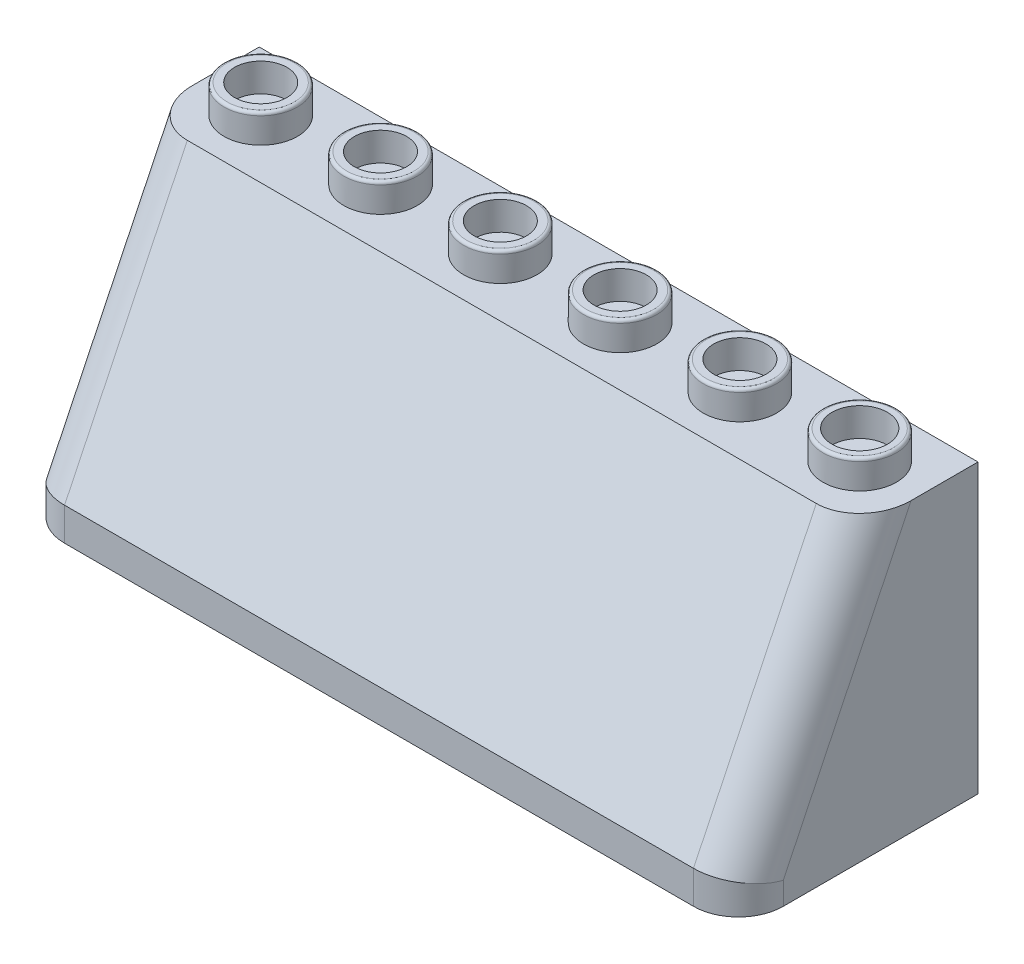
ISO-10303-21;
HEADER;
FILE_DESCRIPTION(('STEP AP214'),'2;1');
FILE_NAME('part.step','',(''),(''),'','','');
FILE_SCHEMA(('AUTOMOTIVE_DESIGN { 1 0 10303 214 1 1 1 1 }'));
ENDSEC;
DATA;
#1=APPLICATION_CONTEXT('core data for automotive mechanical design processes');
#2=APPLICATION_PROTOCOL_DEFINITION('international standard','automotive_design',2000,#1);
#3=PRODUCT_CONTEXT('',#1,'mechanical');
#4=PRODUCT('Part','Part','',(#3));
#5=PRODUCT_RELATED_PRODUCT_CATEGORY('part','',(#4));
#6=PRODUCT_DEFINITION_FORMATION('','',#4);
#7=PRODUCT_DEFINITION_CONTEXT('part definition',#1,'design');
#8=PRODUCT_DEFINITION('design','',#6,#7);
#9=PRODUCT_DEFINITION_SHAPE('','',#8);
#10=(LENGTH_UNIT() NAMED_UNIT(*) SI_UNIT(.MILLI.,.METRE.));
#11=(NAMED_UNIT(*) PLANE_ANGLE_UNIT() SI_UNIT($,.RADIAN.));
#12=(NAMED_UNIT(*) SI_UNIT($,.STERADIAN.) SOLID_ANGLE_UNIT());
#13=UNCERTAINTY_MEASURE_WITH_UNIT(LENGTH_MEASURE(1.E-05),#10,'distance_accuracy_value','');
#14=(GEOMETRIC_REPRESENTATION_CONTEXT(3) GLOBAL_UNCERTAINTY_ASSIGNED_CONTEXT((#13)) GLOBAL_UNIT_ASSIGNED_CONTEXT((#10,
#11,#12)) REPRESENTATION_CONTEXT('',''));
#15=CARTESIAN_POINT('',(0.,0.,0.));
#16=DIRECTION('',(0.,0.,1.));
#17=DIRECTION('',(1.,0.,0.));
#18=AXIS2_PLACEMENT_3D('',#15,#16,#17);
#19=CARTESIAN_POINT('',(1.6,2.1,14.4));
#20=DIRECTION('',(0.,1.,0.));
#21=DIRECTION('',(0.,0.,1.));
#22=AXIS2_PLACEMENT_3D('',#19,#20,#21);
#23=PLANE('',#22);
#24=CARTESIAN_POINT('',(4.,2.1,8.));
#25=DIRECTION('',(0.,1.,0.));
#26=DIRECTION('',(0.,0.,1.));
#27=AXIS2_PLACEMENT_3D('',#24,#25,#26);
#28=CIRCLE('',#27,1.6);
#29=CARTESIAN_POINT('',(4.,2.1,9.6));
#30=VERTEX_POINT('',#29);
#31=EDGE_CURVE('E35',#30,#30,#28,.F.);
#32=ORIENTED_EDGE('',*,*,#31,.F.);
#33=EDGE_LOOP('',(#32));
#34=FACE_BOUND('',#33,.T.);
#35=CARTESIAN_POINT('',(32.,2.1,12.));
#36=DIRECTION('',(0.,1.,0.));
#37=DIRECTION('',(0.,0.,1.));
#38=AXIS2_PLACEMENT_3D('',#35,#36,#37);
#39=CIRCLE('',#38,1.6);
#40=CARTESIAN_POINT('',(32.,2.1,13.6));
#41=VERTEX_POINT('',#40);
#42=EDGE_CURVE('E510',#41,#41,#39,.F.);
#43=ORIENTED_EDGE('',*,*,#42,.F.);
#44=EDGE_LOOP('',(#43));
#45=FACE_BOUND('',#44,.T.);
#46=CARTESIAN_POINT('',(16.,2.1,12.));
#47=DIRECTION('',(0.,1.,0.));
#48=DIRECTION('',(0.,0.,1.));
#49=AXIS2_PLACEMENT_3D('',#46,#47,#48);
#50=CIRCLE('',#49,1.6);
#51=CARTESIAN_POINT('',(16.,2.1,13.6));
#52=VERTEX_POINT('',#51);
#53=EDGE_CURVE('E504',#52,#52,#50,.F.);
#54=ORIENTED_EDGE('',*,*,#53,.F.);
#55=EDGE_LOOP('',(#54));
#56=FACE_BOUND('',#55,.T.);
#57=DIRECTION('',(0.,0.,1.));
#58=VECTOR('',#57,1.);
#59=CARTESIAN_POINT('',(46.4,2.1,1.6));
#60=LINE('',#59,#58);
#61=CARTESIAN_POINT('',(46.4,2.1,1.6));
#62=VERTEX_POINT('',#61);
#63=CARTESIAN_POINT('',(46.4,2.1,12.2));
#64=VERTEX_POINT('',#63);
#65=EDGE_CURVE('E260',#62,#64,#60,.T.);
#66=ORIENTED_EDGE('',*,*,#65,.T.);
#67=CARTESIAN_POINT('',(44.2,2.1,12.2));
#68=DIRECTION('',(0.,1.,0.));
#69=DIRECTION('',(0.,0.,1.));
#70=AXIS2_PLACEMENT_3D('',#67,#68,#69);
#71=CIRCLE('',#70,2.2);
#72=CARTESIAN_POINT('',(44.2,2.1,14.4));
#73=VERTEX_POINT('',#72);
#74=EDGE_CURVE('E494',#64,#73,#71,.F.);
#75=ORIENTED_EDGE('',*,*,#74,.T.);
#76=DIRECTION('',(-1.,0.,0.));
#77=VECTOR('',#76,1.);
#78=CARTESIAN_POINT('',(46.4,2.1,14.4));
#79=LINE('',#78,#77);
#80=CARTESIAN_POINT('',(3.8,2.1,14.4));
#81=VERTEX_POINT('',#80);
#82=EDGE_CURVE('E263',#73,#81,#79,.T.);
#83=ORIENTED_EDGE('',*,*,#82,.T.);
#84=CARTESIAN_POINT('',(3.8,2.1,12.2));
#85=DIRECTION('',(0.,1.,0.));
#86=DIRECTION('',(0.,0.,1.));
#87=AXIS2_PLACEMENT_3D('',#84,#85,#86);
#88=CIRCLE('',#87,2.2);
#89=CARTESIAN_POINT('',(1.6,2.1,12.2));
#90=VERTEX_POINT('',#89);
#91=EDGE_CURVE('E50',#81,#90,#88,.F.);
#92=ORIENTED_EDGE('',*,*,#91,.T.);
#93=DIRECTION('',(0.,0.,-1.));
#94=VECTOR('',#93,1.);
#95=CARTESIAN_POINT('',(1.6,2.1,14.4));
#96=LINE('',#95,#94);
#97=CARTESIAN_POINT('',(1.6,2.1,1.6));
#98=VERTEX_POINT('',#97);
#99=EDGE_CURVE('E246',#90,#98,#96,.T.);
#100=ORIENTED_EDGE('',*,*,#99,.T.);
#101=DIRECTION('',(1.,0.,0.));
#102=VECTOR('',#101,1.);
#103=CARTESIAN_POINT('',(1.6,2.1,1.6));
#104=LINE('',#103,#102);
#105=CARTESIAN_POINT('',(6.4,2.1,1.6));
#106=VERTEX_POINT('',#105);
#107=EDGE_CURVE('E248',#98,#106,#104,.T.);
#108=ORIENTED_EDGE('',*,*,#107,.T.);
#109=DIRECTION('',(0.,0.,1.));
#110=VECTOR('',#109,1.);
#111=CARTESIAN_POINT('',(6.4,2.1,1.6));
#112=LINE('',#111,#110);
#113=CARTESIAN_POINT('',(6.4,2.1,9.6));
#114=VERTEX_POINT('',#113);
#115=EDGE_CURVE('E209',#106,#114,#112,.T.);
#116=ORIENTED_EDGE('',*,*,#115,.T.);
#117=DIRECTION('',(1.,0.,0.));
#118=VECTOR('',#117,1.);
#119=CARTESIAN_POINT('',(6.4,2.1,9.6));
#120=LINE('',#119,#118);
#121=CARTESIAN_POINT('',(41.6,2.1,9.6));
#122=VERTEX_POINT('',#121);
#123=EDGE_CURVE('E251',#114,#122,#120,.T.);
#124=ORIENTED_EDGE('',*,*,#123,.T.);
#125=DIRECTION('',(0.,0.,-1.));
#126=VECTOR('',#125,1.);
#127=CARTESIAN_POINT('',(41.6,2.1,9.6));
#128=LINE('',#127,#126);
#129=CARTESIAN_POINT('',(41.6,2.1,1.6));
#130=VERTEX_POINT('',#129);
#131=EDGE_CURVE('E254',#122,#130,#128,.T.);
#132=ORIENTED_EDGE('',*,*,#131,.T.);
#133=DIRECTION('',(1.,0.,0.));
#134=VECTOR('',#133,1.);
#135=CARTESIAN_POINT('',(41.6,2.1,1.6));
#136=LINE('',#135,#134);
#137=EDGE_CURVE('E257',#130,#62,#136,.T.);
#138=ORIENTED_EDGE('',*,*,#137,.T.);
#139=EDGE_LOOP('',(#66,#75,#83,#92,#100,#108,#116,#124,#132,#138));
#140=FACE_BOUND('',#139,.T.);
#141=CARTESIAN_POINT('',(24.,2.1,12.));
#142=DIRECTION('',(0.,1.,0.));
#143=DIRECTION('',(0.,0.,1.));
#144=AXIS2_PLACEMENT_3D('',#141,#142,#143);
#145=CIRCLE('',#144,1.6);
#146=CARTESIAN_POINT('',(24.,2.1,13.6));
#147=VERTEX_POINT('',#146);
#148=EDGE_CURVE('E501',#147,#147,#145,.F.);
#149=ORIENTED_EDGE('',*,*,#148,.F.);
#150=EDGE_LOOP('',(#149));
#151=FACE_BOUND('',#150,.T.);
#152=CARTESIAN_POINT('',(8.,2.1,12.));
#153=DIRECTION('',(0.,1.,0.));
#154=DIRECTION('',(0.,0.,1.));
#155=AXIS2_PLACEMENT_3D('',#152,#153,#154);
#156=CIRCLE('',#155,1.6);
#157=CARTESIAN_POINT('',(8.,2.1,13.6));
#158=VERTEX_POINT('',#157);
#159=EDGE_CURVE('E507',#158,#158,#156,.F.);
#160=ORIENTED_EDGE('',*,*,#159,.F.);
#161=EDGE_LOOP('',(#160));
#162=FACE_BOUND('',#161,.T.);
#163=CARTESIAN_POINT('',(40.,2.1,12.));
#164=DIRECTION('',(0.,1.,0.));
#165=DIRECTION('',(0.,0.,1.));
#166=AXIS2_PLACEMENT_3D('',#163,#164,#165);
#167=CIRCLE('',#166,1.6);
#168=CARTESIAN_POINT('',(40.,2.1,13.6));
#169=VERTEX_POINT('',#168);
#170=EDGE_CURVE('E513',#169,#169,#167,.F.);
#171=ORIENTED_EDGE('',*,*,#170,.F.);
#172=EDGE_LOOP('',(#171));
#173=FACE_BOUND('',#172,.T.);
#174=CARTESIAN_POINT('',(44.,2.1,8.));
#175=DIRECTION('',(0.,1.,0.));
#176=DIRECTION('',(0.,0.,1.));
#177=AXIS2_PLACEMENT_3D('',#174,#175,#176);
#178=CIRCLE('',#177,1.6);
#179=CARTESIAN_POINT('',(44.,2.1,9.6));
#180=VERTEX_POINT('',#179);
#181=EDGE_CURVE('E11',#180,#180,#178,.F.);
#182=ORIENTED_EDGE('',*,*,#181,.F.);
#183=EDGE_LOOP('',(#182));
#184=FACE_BOUND('',#183,.T.);
#185=ADVANCED_FACE('F27',(#34,#45,#56,#140,#151,#162,#173,#184),#23,.F.);
#186=CARTESIAN_POINT('',(0.,19.2,16.));
#187=DIRECTION('',(0.,-1.,0.));
#188=DIRECTION('',(0.,0.,-1.));
#189=AXIS2_PLACEMENT_3D('',#186,#187,#188);
#190=PLANE('',#189);
#191=DIRECTION('',(0.,0.,-1.));
#192=VECTOR('',#191,1.);
#193=CARTESIAN_POINT('',(0.,19.2,16.));
#194=LINE('',#193,#192);
#195=CARTESIAN_POINT('',(0.,19.2,4.46923743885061));
#196=VERTEX_POINT('',#195);
#197=CARTESIAN_POINT('',(0.,19.2,0.));
#198=VERTEX_POINT('',#197);
#199=EDGE_CURVE('E397',#196,#198,#194,.T.);
#200=ORIENTED_EDGE('',*,*,#199,.F.);
#201=CARTESIAN_POINT('',(2.99999999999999,19.2,4.46923743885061));
#202=DIRECTION('',(0.,-1.,0.));
#203=DIRECTION('',(0.,0.,-1.));
#204=AXIS2_PLACEMENT_3D('',#201,#202,#203);
#205=ELLIPSE('',#204,3.33076256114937,3.);
#206=CARTESIAN_POINT('',(2.99999999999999,19.2,7.8));
#207=VERTEX_POINT('',#206);
#208=EDGE_CURVE('E426',#196,#207,#205,.F.);
#209=ORIENTED_EDGE('',*,*,#208,.T.);
#210=DIRECTION('',(1.,0.,0.));
#211=VECTOR('',#210,1.);
#212=CARTESIAN_POINT('',(0.,19.2,7.8));
#213=LINE('',#212,#211);
#214=CARTESIAN_POINT('',(45.,19.2,7.8));
#215=VERTEX_POINT('',#214);
#216=EDGE_CURVE('E376',#207,#215,#213,.T.);
#217=ORIENTED_EDGE('',*,*,#216,.T.);
#218=CARTESIAN_POINT('',(45.,19.2,4.46923743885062));
#219=DIRECTION('',(0.,-1.,0.));
#220=DIRECTION('',(0.,0.,-1.));
#221=AXIS2_PLACEMENT_3D('',#218,#219,#220);
#222=ELLIPSE('',#221,3.33076256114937,3.);
#223=CARTESIAN_POINT('',(48.,19.2,4.46923743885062));
#224=VERTEX_POINT('',#223);
#225=EDGE_CURVE('E424',#215,#224,#222,.F.);
#226=ORIENTED_EDGE('',*,*,#225,.T.);
#227=DIRECTION('',(0.,0.,-1.));
#228=VECTOR('',#227,1.);
#229=CARTESIAN_POINT('',(48.,19.2,16.));
#230=LINE('',#229,#228);
#231=CARTESIAN_POINT('',(48.,19.2,0.));
#232=VERTEX_POINT('',#231);
#233=EDGE_CURVE('E399',#224,#232,#230,.T.);
#234=ORIENTED_EDGE('',*,*,#233,.T.);
#235=DIRECTION('',(-1.,0.,0.));
#236=VECTOR('',#235,1.);
#237=CARTESIAN_POINT('',(0.,19.2,0.));
#238=LINE('',#237,#236);
#239=EDGE_CURVE('E391',#232,#198,#238,.T.);
#240=ORIENTED_EDGE('',*,*,#239,.T.);
#241=EDGE_LOOP('',(#200,#209,#217,#226,#234,#240));
#242=FACE_BOUND('',#241,.T.);
#243=CARTESIAN_POINT('',(44.,19.2,3.9));
#244=DIRECTION('',(0.,-1.,0.));
#245=DIRECTION('',(0.,0.,-1.));
#246=AXIS2_PLACEMENT_3D('',#243,#244,#245);
#247=CIRCLE('',#246,2.45);
#248=CARTESIAN_POINT('',(44.,19.2,1.45));
#249=VERTEX_POINT('',#248);
#250=EDGE_CURVE('E432',#249,#249,#247,.F.);
#251=ORIENTED_EDGE('',*,*,#250,.F.);
#252=EDGE_LOOP('',(#251));
#253=FACE_BOUND('',#252,.T.);
#254=CARTESIAN_POINT('',(36.,19.2,3.9));
#255=DIRECTION('',(0.,-1.,0.));
#256=DIRECTION('',(0.,0.,-1.));
#257=AXIS2_PLACEMENT_3D('',#254,#255,#256);
#258=CIRCLE('',#257,2.45);
#259=CARTESIAN_POINT('',(36.,19.2,1.45));
#260=VERTEX_POINT('',#259);
#261=EDGE_CURVE('E435',#260,#260,#258,.F.);
#262=ORIENTED_EDGE('',*,*,#261,.F.);
#263=EDGE_LOOP('',(#262));
#264=FACE_BOUND('',#263,.T.);
#265=CARTESIAN_POINT('',(28.,19.2,3.9));
#266=DIRECTION('',(0.,-1.,0.));
#267=DIRECTION('',(0.,0.,-1.));
#268=AXIS2_PLACEMENT_3D('',#265,#266,#267);
#269=CIRCLE('',#268,2.45);
#270=CARTESIAN_POINT('',(28.,19.2,1.45));
#271=VERTEX_POINT('',#270);
#272=EDGE_CURVE('E438',#271,#271,#269,.F.);
#273=ORIENTED_EDGE('',*,*,#272,.F.);
#274=EDGE_LOOP('',(#273));
#275=FACE_BOUND('',#274,.T.);
#276=CARTESIAN_POINT('',(20.,19.2,3.9));
#277=DIRECTION('',(0.,-1.,0.));
#278=DIRECTION('',(0.,0.,-1.));
#279=AXIS2_PLACEMENT_3D('',#276,#277,#278);
#280=CIRCLE('',#279,2.45);
#281=CARTESIAN_POINT('',(20.,19.2,1.45));
#282=VERTEX_POINT('',#281);
#283=EDGE_CURVE('E441',#282,#282,#280,.F.);
#284=ORIENTED_EDGE('',*,*,#283,.F.);
#285=EDGE_LOOP('',(#284));
#286=FACE_BOUND('',#285,.T.);
#287=CARTESIAN_POINT('',(12.,19.2,3.9));
#288=DIRECTION('',(0.,-1.,0.));
#289=DIRECTION('',(0.,0.,-1.));
#290=AXIS2_PLACEMENT_3D('',#287,#288,#289);
#291=CIRCLE('',#290,2.45);
#292=CARTESIAN_POINT('',(12.,19.2,1.45));
#293=VERTEX_POINT('',#292);
#294=EDGE_CURVE('E444',#293,#293,#291,.F.);
#295=ORIENTED_EDGE('',*,*,#294,.F.);
#296=EDGE_LOOP('',(#295));
#297=FACE_BOUND('',#296,.T.);
#298=CARTESIAN_POINT('',(3.99999999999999,19.2,3.9));
#299=DIRECTION('',(0.,-1.,0.));
#300=DIRECTION('',(0.,0.,-1.));
#301=AXIS2_PLACEMENT_3D('',#298,#299,#300);
#302=CIRCLE('',#301,2.45);
#303=CARTESIAN_POINT('',(3.99999999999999,19.2,1.45));
#304=VERTEX_POINT('',#303);
#305=EDGE_CURVE('E447',#304,#304,#302,.F.);
#306=ORIENTED_EDGE('',*,*,#305,.F.);
#307=EDGE_LOOP('',(#306));
#308=FACE_BOUND('',#307,.T.);
#309=ADVANCED_FACE('F522',(#242,#253,#264,#275,#286,#297,#308),#190,.F.);
#310=CARTESIAN_POINT('',(0.,0.,16.));
#311=DIRECTION('',(1.,0.,0.));
#312=DIRECTION('',(0.,1.,0.));
#313=AXIS2_PLACEMENT_3D('',#310,#311,#312);
#314=PLANE('',#313);
#315=DIRECTION('',(0.,0.,-1.));
#316=VECTOR('',#315,1.);
#317=CARTESIAN_POINT('',(0.,0.,16.));
#318=LINE('',#317,#316);
#319=CARTESIAN_POINT('',(0.,0.,13.));
#320=VERTEX_POINT('',#319);
#321=CARTESIAN_POINT('',(0.,0.,0.));
#322=VERTEX_POINT('',#321);
#323=EDGE_CURVE('E404',#320,#322,#318,.T.);
#324=ORIENTED_EDGE('',*,*,#323,.F.);
#325=DIRECTION('',(0.,-1.,0.));
#326=VECTOR('',#325,1.);
#327=CARTESIAN_POINT('',(0.,0.,13.));
#328=LINE('',#327,#326);
#329=CARTESIAN_POINT('',(0.,1.51427273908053,13.));
#330=VERTEX_POINT('',#329);
#331=EDGE_CURVE('E422',#320,#330,#328,.F.);
#332=ORIENTED_EDGE('',*,*,#331,.T.);
#333=DIRECTION('',(0.,0.900694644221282,-0.43445271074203));
#334=VECTOR('',#333,1.);
#335=CARTESIAN_POINT('',(0.,-0.888109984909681,14.1587963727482));
#336=LINE('',#335,#334);
#337=EDGE_CURVE('E420',#330,#196,#336,.T.);
#338=ORIENTED_EDGE('',*,*,#337,.T.);
#339=ORIENTED_EDGE('',*,*,#199,.T.);
#340=DIRECTION('',(0.,-1.,0.));
#341=VECTOR('',#340,1.);
#342=CARTESIAN_POINT('',(0.,0.,0.));
#343=LINE('',#342,#341);
#344=EDGE_CURVE('E379',#198,#322,#343,.T.);
#345=ORIENTED_EDGE('',*,*,#344,.T.);
#346=EDGE_LOOP('',(#324,#332,#338,#339,#345));
#347=FACE_BOUND('',#346,.T.);
#348=ADVANCED_FACE('F29',(#347),#314,.F.);
#349=CARTESIAN_POINT('',(0.,0.,16.));
#350=DIRECTION('',(0.,1.,0.));
#351=DIRECTION('',(0.,0.,1.));
#352=AXIS2_PLACEMENT_3D('',#349,#350,#351);
#353=PLANE('',#352);
#354=DIRECTION('',(1.,0.,0.));
#355=VECTOR('',#354,1.);
#356=CARTESIAN_POINT('',(1.6,0.,1.6));
#357=LINE('',#356,#355);
#358=CARTESIAN_POINT('',(1.6,0.,1.6));
#359=VERTEX_POINT('',#358);
#360=CARTESIAN_POINT('',(6.4,0.,1.6));
#361=VERTEX_POINT('',#360);
#362=EDGE_CURVE('E218',#359,#361,#357,.T.);
#363=ORIENTED_EDGE('',*,*,#362,.F.);
#364=DIRECTION('',(0.,0.,-1.));
#365=VECTOR('',#364,1.);
#366=CARTESIAN_POINT('',(1.6,0.,14.4));
#367=LINE('',#366,#365);
#368=CARTESIAN_POINT('',(1.6,0.,12.2));
#369=VERTEX_POINT('',#368);
#370=EDGE_CURVE('E223',#369,#359,#367,.T.);
#371=ORIENTED_EDGE('',*,*,#370,.F.);
#372=CARTESIAN_POINT('',(3.8,0.,12.2));
#373=DIRECTION('',(0.,1.,0.));
#374=DIRECTION('',(0.,0.,1.));
#375=AXIS2_PLACEMENT_3D('',#372,#373,#374);
#376=CIRCLE('',#375,2.2);
#377=CARTESIAN_POINT('',(3.8,0.,14.4));
#378=VERTEX_POINT('',#377);
#379=EDGE_CURVE('E42',#369,#378,#376,.T.);
#380=ORIENTED_EDGE('',*,*,#379,.T.);
#381=DIRECTION('',(-1.,0.,0.));
#382=VECTOR('',#381,1.);
#383=CARTESIAN_POINT('',(46.4,0.,14.4));
#384=LINE('',#383,#382);
#385=CARTESIAN_POINT('',(44.2,0.,14.4));
#386=VERTEX_POINT('',#385);
#387=EDGE_CURVE('E243',#386,#378,#384,.T.);
#388=ORIENTED_EDGE('',*,*,#387,.F.);
#389=CARTESIAN_POINT('',(44.2,0.,12.2));
#390=DIRECTION('',(0.,1.,0.));
#391=DIRECTION('',(0.,0.,1.));
#392=AXIS2_PLACEMENT_3D('',#389,#390,#391);
#393=CIRCLE('',#392,2.2);
#394=CARTESIAN_POINT('',(46.4,0.,12.2));
#395=VERTEX_POINT('',#394);
#396=EDGE_CURVE('E498',#386,#395,#393,.T.);
#397=ORIENTED_EDGE('',*,*,#396,.T.);
#398=DIRECTION('',(0.,0.,1.));
#399=VECTOR('',#398,1.);
#400=CARTESIAN_POINT('',(46.4,0.,1.6));
#401=LINE('',#400,#399);
#402=CARTESIAN_POINT('',(46.4,0.,1.6));
#403=VERTEX_POINT('',#402);
#404=EDGE_CURVE('E240',#403,#395,#401,.T.);
#405=ORIENTED_EDGE('',*,*,#404,.F.);
#406=DIRECTION('',(1.,0.,0.));
#407=VECTOR('',#406,1.);
#408=CARTESIAN_POINT('',(41.6,0.,1.6));
#409=LINE('',#408,#407);
#410=CARTESIAN_POINT('',(41.6,0.,1.6));
#411=VERTEX_POINT('',#410);
#412=EDGE_CURVE('E237',#411,#403,#409,.T.);
#413=ORIENTED_EDGE('',*,*,#412,.F.);
#414=DIRECTION('',(0.,0.,-1.));
#415=VECTOR('',#414,1.);
#416=CARTESIAN_POINT('',(41.6,0.,9.6));
#417=LINE('',#416,#415);
#418=CARTESIAN_POINT('',(41.6,0.,9.6));
#419=VERTEX_POINT('',#418);
#420=EDGE_CURVE('E231',#419,#411,#417,.T.);
#421=ORIENTED_EDGE('',*,*,#420,.F.);
#422=DIRECTION('',(1.,0.,0.));
#423=VECTOR('',#422,1.);
#424=CARTESIAN_POINT('',(6.4,0.,9.6));
#425=LINE('',#424,#423);
#426=CARTESIAN_POINT('',(6.4,0.,9.6));
#427=VERTEX_POINT('',#426);
#428=EDGE_CURVE('E229',#427,#419,#425,.T.);
#429=ORIENTED_EDGE('',*,*,#428,.F.);
#430=DIRECTION('',(0.,0.,1.));
#431=VECTOR('',#430,1.);
#432=CARTESIAN_POINT('',(6.4,0.,1.6));
#433=LINE('',#432,#431);
#434=EDGE_CURVE('E206',#361,#427,#433,.T.);
#435=ORIENTED_EDGE('',*,*,#434,.F.);
#436=EDGE_LOOP('',(#363,#371,#380,#388,#397,#405,#413,#421,#429,#435));
#437=FACE_BOUND('',#436,.T.);
#438=DIRECTION('',(-1.,0.,0.));
#439=VECTOR('',#438,1.);
#440=CARTESIAN_POINT('',(40.,0.,8.));
#441=LINE('',#440,#439);
#442=CARTESIAN_POINT('',(40.,0.,8.));
#443=VERTEX_POINT('',#442);
#444=CARTESIAN_POINT('',(8.,0.,8.));
#445=VERTEX_POINT('',#444);
#446=EDGE_CURVE('E276',#443,#445,#441,.T.);
#447=ORIENTED_EDGE('',*,*,#446,.F.);
#448=DIRECTION('',(0.,0.,1.));
#449=VECTOR('',#448,1.);
#450=CARTESIAN_POINT('',(40.,0.,0.));
#451=LINE('',#450,#449);
#452=CARTESIAN_POINT('',(40.,0.,0.));
#453=VERTEX_POINT('',#452);
#454=EDGE_CURVE('E267',#453,#443,#451,.T.);
#455=ORIENTED_EDGE('',*,*,#454,.F.);
#456=DIRECTION('',(1.,0.,0.));
#457=VECTOR('',#456,1.);
#458=CARTESIAN_POINT('',(0.,0.,0.));
#459=LINE('',#458,#457);
#460=CARTESIAN_POINT('',(48.,0.,0.));
#461=VERTEX_POINT('',#460);
#462=EDGE_CURVE('E384',#453,#461,#459,.T.);
#463=ORIENTED_EDGE('',*,*,#462,.T.);
#464=DIRECTION('',(0.,0.,-1.));
#465=VECTOR('',#464,1.);
#466=CARTESIAN_POINT('',(48.,0.,16.));
#467=LINE('',#466,#465);
#468=CARTESIAN_POINT('',(48.,0.,13.));
#469=VERTEX_POINT('',#468);
#470=EDGE_CURVE('E401',#469,#461,#467,.T.);
#471=ORIENTED_EDGE('',*,*,#470,.F.);
#472=CARTESIAN_POINT('',(45.,0.,13.));
#473=DIRECTION('',(0.,1.,0.));
#474=DIRECTION('',(0.,0.,1.));
#475=AXIS2_PLACEMENT_3D('',#472,#473,#474);
#476=CIRCLE('',#475,3.);
#477=CARTESIAN_POINT('',(45.,0.,16.));
#478=VERTEX_POINT('',#477);
#479=EDGE_CURVE('E418',#469,#478,#476,.F.);
#480=ORIENTED_EDGE('',*,*,#479,.T.);
#481=DIRECTION('',(1.,0.,0.));
#482=VECTOR('',#481,1.);
#483=CARTESIAN_POINT('',(0.,0.,16.));
#484=LINE('',#483,#482);
#485=CARTESIAN_POINT('',(3.,0.,16.));
#486=VERTEX_POINT('',#485);
#487=EDGE_CURVE('E394',#486,#478,#484,.T.);
#488=ORIENTED_EDGE('',*,*,#487,.F.);
#489=CARTESIAN_POINT('',(3.,0.,13.));
#490=DIRECTION('',(0.,1.,0.));
#491=DIRECTION('',(0.,0.,1.));
#492=AXIS2_PLACEMENT_3D('',#489,#490,#491);
#493=CIRCLE('',#492,3.);
#494=EDGE_CURVE('E416',#486,#320,#493,.F.);
#495=ORIENTED_EDGE('',*,*,#494,.T.);
#496=ORIENTED_EDGE('',*,*,#323,.T.);
#497=CARTESIAN_POINT('',(8.,0.,0.));
#498=VERTEX_POINT('',#497);
#499=EDGE_CURVE('E385',#322,#498,#459,.T.);
#500=ORIENTED_EDGE('',*,*,#499,.T.);
#501=DIRECTION('',(0.,0.,-1.));
#502=VECTOR('',#501,1.);
#503=CARTESIAN_POINT('',(8.,0.,0.));
#504=LINE('',#503,#502);
#505=EDGE_CURVE('E279',#445,#498,#504,.T.);
#506=ORIENTED_EDGE('',*,*,#505,.F.);
#507=EDGE_LOOP('',(#447,#455,#463,#471,#480,#488,#495,#496,#500,#506));
#508=FACE_BOUND('',#507,.T.);
#509=ADVANCED_FACE('F225',(#437,#508),#353,.F.);
#510=CARTESIAN_POINT('',(48.,0.,16.));
#511=DIRECTION('',(-1.,0.,0.));
#512=DIRECTION('',(0.,-1.,0.));
#513=AXIS2_PLACEMENT_3D('',#510,#511,#512);
#514=PLANE('',#513);
#515=DIRECTION('',(0.,0.900694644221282,-0.43445271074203));
#516=VECTOR('',#515,1.);
#517=CARTESIAN_POINT('',(48.,-0.888109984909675,14.1587963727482));
#518=LINE('',#517,#516);
#519=CARTESIAN_POINT('',(48.,1.51427273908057,13.));
#520=VERTEX_POINT('',#519);
#521=EDGE_CURVE('E412',#224,#520,#518,.F.);
#522=ORIENTED_EDGE('',*,*,#521,.T.);
#523=DIRECTION('',(0.,1.,0.));
#524=VECTOR('',#523,1.);
#525=CARTESIAN_POINT('',(48.,0.,13.));
#526=LINE('',#525,#524);
#527=EDGE_CURVE('E414',#520,#469,#526,.F.);
#528=ORIENTED_EDGE('',*,*,#527,.T.);
#529=ORIENTED_EDGE('',*,*,#470,.T.);
#530=DIRECTION('',(0.,1.,0.));
#531=VECTOR('',#530,1.);
#532=CARTESIAN_POINT('',(48.,0.,0.));
#533=LINE('',#532,#531);
#534=EDGE_CURVE('E388',#461,#232,#533,.T.);
#535=ORIENTED_EDGE('',*,*,#534,.T.);
#536=ORIENTED_EDGE('',*,*,#233,.F.);
#537=EDGE_LOOP('',(#522,#528,#529,#535,#536));
#538=FACE_BOUND('',#537,.T.);
#539=ADVANCED_FACE('F793',(#538),#514,.F.);
#540=CARTESIAN_POINT('',(0.,19.2,16.));
#541=DIRECTION('',(0.,0.,-1.));
#542=DIRECTION('',(-1.,0.,0.));
#543=AXIS2_PLACEMENT_3D('',#540,#541,#542);
#544=PLANE('',#543);
#545=ORIENTED_EDGE('',*,*,#487,.T.);
#546=DIRECTION('',(0.,1.,0.));
#547=VECTOR('',#546,1.);
#548=CARTESIAN_POINT('',(45.,19.2,16.));
#549=LINE('',#548,#547);
#550=CARTESIAN_POINT('',(45.,2.2,16.));
#551=VERTEX_POINT('',#550);
#552=EDGE_CURVE('E409',#478,#551,#549,.T.);
#553=ORIENTED_EDGE('',*,*,#552,.T.);
#554=DIRECTION('',(1.,0.,0.));
#555=VECTOR('',#554,1.);
#556=CARTESIAN_POINT('',(0.,2.19999999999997,16.));
#557=LINE('',#556,#555);
#558=CARTESIAN_POINT('',(3.,2.19999999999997,16.));
#559=VERTEX_POINT('',#558);
#560=EDGE_CURVE('E375',#559,#551,#557,.T.);
#561=ORIENTED_EDGE('',*,*,#560,.F.);
#562=DIRECTION('',(0.,-1.,0.));
#563=VECTOR('',#562,1.);
#564=CARTESIAN_POINT('',(2.99999999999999,19.2,16.));
#565=LINE('',#564,#563);
#566=EDGE_CURVE('E406',#559,#486,#565,.T.);
#567=ORIENTED_EDGE('',*,*,#566,.T.);
#568=EDGE_LOOP('',(#545,#553,#561,#567));
#569=FACE_BOUND('',#568,.T.);
#570=ADVANCED_FACE('F789',(#569),#544,.F.);
#571=CARTESIAN_POINT('',(0.,19.2,0.));
#572=DIRECTION('',(0.,0.,-1.));
#573=DIRECTION('',(-1.,0.,0.));
#574=AXIS2_PLACEMENT_3D('',#571,#572,#573);
#575=PLANE('',#574);
#576=DIRECTION('',(0.,-1.,0.));
#577=VECTOR('',#576,1.);
#578=CARTESIAN_POINT('',(40.,3.2,0.));
#579=LINE('',#578,#577);
#580=CARTESIAN_POINT('',(40.,3.2,0.));
#581=VERTEX_POINT('',#580);
#582=EDGE_CURVE('E291',#581,#453,#579,.T.);
#583=ORIENTED_EDGE('',*,*,#582,.F.);
#584=DIRECTION('',(-1.,0.,0.));
#585=VECTOR('',#584,1.);
#586=CARTESIAN_POINT('',(46.4,3.20000000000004,0.));
#587=LINE('',#586,#585);
#588=CARTESIAN_POINT('',(46.4,3.20000000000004,0.));
#589=VERTEX_POINT('',#588);
#590=EDGE_CURVE('E332',#589,#581,#587,.T.);
#591=ORIENTED_EDGE('',*,*,#590,.F.);
#592=DIRECTION('',(0.,-1.,0.));
#593=VECTOR('',#592,1.);
#594=CARTESIAN_POINT('',(46.4,17.6,0.));
#595=LINE('',#594,#593);
#596=CARTESIAN_POINT('',(46.4,17.6,0.));
#597=VERTEX_POINT('',#596);
#598=EDGE_CURVE('E311',#597,#589,#595,.T.);
#599=ORIENTED_EDGE('',*,*,#598,.F.);
#600=DIRECTION('',(-1.,0.,0.));
#601=VECTOR('',#600,1.);
#602=CARTESIAN_POINT('',(46.4,17.6,0.));
#603=LINE('',#602,#601);
#604=CARTESIAN_POINT('',(1.59999999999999,17.6,0.));
#605=VERTEX_POINT('',#604);
#606=EDGE_CURVE('E324',#597,#605,#603,.T.);
#607=ORIENTED_EDGE('',*,*,#606,.T.);
#608=DIRECTION('',(0.,-1.,0.));
#609=VECTOR('',#608,1.);
#610=CARTESIAN_POINT('',(1.59999999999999,17.6,0.));
#611=LINE('',#610,#609);
#612=CARTESIAN_POINT('',(1.6,3.2,0.));
#613=VERTEX_POINT('',#612);
#614=EDGE_CURVE('E293',#605,#613,#611,.T.);
#615=ORIENTED_EDGE('',*,*,#614,.T.);
#616=CARTESIAN_POINT('',(8.,3.2,0.));
#617=VERTEX_POINT('',#616);
#618=EDGE_CURVE('E323',#617,#613,#587,.T.);
#619=ORIENTED_EDGE('',*,*,#618,.F.);
#620=DIRECTION('',(0.,-1.,0.));
#621=VECTOR('',#620,1.);
#622=CARTESIAN_POINT('',(8.,3.2,0.));
#623=LINE('',#622,#621);
#624=EDGE_CURVE('E294',#617,#498,#623,.T.);
#625=ORIENTED_EDGE('',*,*,#624,.T.);
#626=ORIENTED_EDGE('',*,*,#499,.F.);
#627=ORIENTED_EDGE('',*,*,#344,.F.);
#628=ORIENTED_EDGE('',*,*,#239,.F.);
#629=ORIENTED_EDGE('',*,*,#534,.F.);
#630=ORIENTED_EDGE('',*,*,#462,.F.);
#631=EDGE_LOOP('',(#583,#591,#599,#607,#615,#619,#625,#626,#627,#628,#629,#630));
#632=FACE_BOUND('',#631,.T.);
#633=ADVANCED_FACE('F785',(#632),#575,.T.);
#634=CARTESIAN_POINT('',(0.,19.2,7.8));
#635=DIRECTION('',(0.,-0.43445271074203,-0.900694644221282));
#636=DIRECTION('',(0.,0.900694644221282,-0.43445271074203));
#637=AXIS2_PLACEMENT_3D('',#634,#635,#636);
#638=PLANE('',#637);
#639=ORIENTED_EDGE('',*,*,#216,.F.);
#640=DIRECTION('',(0.,0.900694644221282,-0.43445271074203));
#641=VECTOR('',#640,1.);
#642=CARTESIAN_POINT('',(2.99999999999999,19.2,7.8));
#643=LINE('',#642,#641);
#644=EDGE_CURVE('E430',#207,#559,#643,.F.);
#645=ORIENTED_EDGE('',*,*,#644,.T.);
#646=ORIENTED_EDGE('',*,*,#560,.T.);
#647=DIRECTION('',(0.,0.900694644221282,-0.43445271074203));
#648=VECTOR('',#647,1.);
#649=CARTESIAN_POINT('',(45.,19.2,7.8));
#650=LINE('',#649,#648);
#651=EDGE_CURVE('E428',#551,#215,#650,.T.);
#652=ORIENTED_EDGE('',*,*,#651,.T.);
#653=EDGE_LOOP('',(#639,#645,#646,#652));
#654=FACE_BOUND('',#653,.T.);
#655=ADVANCED_FACE('F781',(#654),#638,.F.);
#656=CARTESIAN_POINT('',(45.,17.8966418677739,5.09791606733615));
#657=DIRECTION('',(0.,0.900694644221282,-0.43445271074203));
#658=DIRECTION('',(0.,0.43445271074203,0.900694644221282));
#659=AXIS2_PLACEMENT_3D('',#656,#657,#658);
#660=CYLINDRICAL_SURFACE('',#659,3.);
#661=ORIENTED_EDGE('',*,*,#225,.F.);
#662=ORIENTED_EDGE('',*,*,#651,.F.);
#663=CARTESIAN_POINT('',(45.,1.51427273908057,13.));
#664=DIRECTION('',(0.,0.974857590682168,-0.222828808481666));
#665=DIRECTION('',(0.,-0.222828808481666,-0.974857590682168));
#666=AXIS2_PLACEMENT_3D('',#663,#664,#665);
#667=ELLIPSE('',#666,3.07737256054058,3.);
#668=EDGE_CURVE('E373',#520,#551,#667,.F.);
#669=ORIENTED_EDGE('',*,*,#668,.F.);
#670=ORIENTED_EDGE('',*,*,#521,.F.);
#671=EDGE_LOOP('',(#661,#662,#669,#670));
#672=FACE_BOUND('',#671,.T.);
#673=ADVANCED_FACE('F777',(#672),#660,.T.);
#674=CARTESIAN_POINT('',(45.,19.2,13.));
#675=DIRECTION('',(0.,1.,0.));
#676=DIRECTION('',(-1.,0.,0.));
#677=AXIS2_PLACEMENT_3D('',#674,#675,#676);
#678=CYLINDRICAL_SURFACE('',#677,3.);
#679=ORIENTED_EDGE('',*,*,#479,.F.);
#680=ORIENTED_EDGE('',*,*,#527,.F.);
#681=ORIENTED_EDGE('',*,*,#668,.T.);
#682=ORIENTED_EDGE('',*,*,#552,.F.);
#683=EDGE_LOOP('',(#679,#680,#681,#682));
#684=FACE_BOUND('',#683,.T.);
#685=ADVANCED_FACE('F773',(#684),#678,.T.);
#686=CARTESIAN_POINT('',(3.,-0.888109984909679,14.1587963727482));
#687=DIRECTION('',(0.,0.900694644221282,-0.43445271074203));
#688=DIRECTION('',(0.,0.43445271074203,0.900694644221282));
#689=AXIS2_PLACEMENT_3D('',#686,#687,#688);
#690=CYLINDRICAL_SURFACE('',#689,3.);
#691=ORIENTED_EDGE('',*,*,#208,.F.);
#692=ORIENTED_EDGE('',*,*,#337,.F.);
#693=CARTESIAN_POINT('',(3.,1.51427273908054,13.));
#694=DIRECTION('',(0.,0.974857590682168,-0.222828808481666));
#695=DIRECTION('',(0.,-0.222828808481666,-0.974857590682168));
#696=AXIS2_PLACEMENT_3D('',#693,#694,#695);
#697=ELLIPSE('',#696,3.07737256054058,3.);
#698=EDGE_CURVE('E370',#559,#330,#697,.F.);
#699=ORIENTED_EDGE('',*,*,#698,.F.);
#700=ORIENTED_EDGE('',*,*,#644,.F.);
#701=EDGE_LOOP('',(#691,#692,#699,#700));
#702=FACE_BOUND('',#701,.T.);
#703=ADVANCED_FACE('F769',(#702),#690,.T.);
#704=CARTESIAN_POINT('',(2.99999999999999,19.2,13.));
#705=DIRECTION('',(0.,-1.,0.));
#706=DIRECTION('',(1.,0.,0.));
#707=AXIS2_PLACEMENT_3D('',#704,#705,#706);
#708=CYLINDRICAL_SURFACE('',#707,3.);
#709=ORIENTED_EDGE('',*,*,#698,.T.);
#710=ORIENTED_EDGE('',*,*,#331,.F.);
#711=ORIENTED_EDGE('',*,*,#494,.F.);
#712=ORIENTED_EDGE('',*,*,#566,.F.);
#713=EDGE_LOOP('',(#709,#710,#711,#712));
#714=FACE_BOUND('',#713,.T.);
#715=ADVANCED_FACE('F762',(#714),#708,.T.);
#716=CARTESIAN_POINT('',(44.,21.1,3.9));
#717=DIRECTION('',(0.,1.,0.));
#718=DIRECTION('',(0.,0.,1.));
#719=AXIS2_PLACEMENT_3D('',#716,#717,#718);
#720=PLANE('',#719);
#721=CARTESIAN_POINT('',(44.,21.1,3.9));
#722=DIRECTION('',(0.,1.,0.));
#723=DIRECTION('',(0.,0.,1.));
#724=AXIS2_PLACEMENT_3D('',#721,#722,#723);
#725=CIRCLE('',#724,2.25);
#726=CARTESIAN_POINT('',(44.,21.1,6.15));
#727=VERTEX_POINT('',#726);
#728=EDGE_CURVE('E480',#727,#727,#725,.T.);
#729=ORIENTED_EDGE('',*,*,#728,.T.);
#730=EDGE_LOOP('',(#729));
#731=FACE_BOUND('',#730,.T.);
#732=CARTESIAN_POINT('',(44.,21.1,3.9));
#733=DIRECTION('',(0.,1.,0.));
#734=DIRECTION('',(0.,0.,1.));
#735=AXIS2_PLACEMENT_3D('',#732,#733,#734);
#736=CIRCLE('',#735,1.85);
#737=CARTESIAN_POINT('',(44.,21.1,2.04999999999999));
#738=VERTEX_POINT('',#737);
#739=EDGE_CURVE('E367',#738,#738,#736,.T.);
#740=ORIENTED_EDGE('',*,*,#739,.F.);
#741=EDGE_LOOP('',(#740));
#742=FACE_BOUND('',#741,.T.);
#743=ADVANCED_FACE('F759',(#731,#742),#720,.T.);
#744=CARTESIAN_POINT('',(44.,21.1,3.9));
#745=DIRECTION('',(0.,-1.,0.));
#746=DIRECTION('',(0.,0.,-1.));
#747=AXIS2_PLACEMENT_3D('',#744,#745,#746);
#748=CYLINDRICAL_SURFACE('',#747,2.45);
#749=CARTESIAN_POINT('',(44.,20.9,3.9));
#750=DIRECTION('',(0.,1.,0.));
#751=DIRECTION('',(0.,0.,1.));
#752=AXIS2_PLACEMENT_3D('',#749,#750,#751);
#753=CIRCLE('',#752,2.45);
#754=CARTESIAN_POINT('',(44.,20.9,1.45));
#755=VERTEX_POINT('',#754);
#756=EDGE_CURVE('E483',#755,#755,#753,.F.);
#757=CARTESIAN_POINT('',(44.,20.9,1.45));
#758=CARTESIAN_POINT('',(44.,20.8822916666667,1.45));
#759=CARTESIAN_POINT('',(44.,20.8645833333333,1.45));
#760=CARTESIAN_POINT('',(44.,20.8291666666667,1.45));
#761=CARTESIAN_POINT('',(44.,20.8114583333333,1.45));
#762=CARTESIAN_POINT('',(44.,20.7760416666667,1.45));
#763=CARTESIAN_POINT('',(44.,20.7583333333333,1.45));
#764=CARTESIAN_POINT('',(44.,20.7229166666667,1.45));
#765=CARTESIAN_POINT('',(44.,20.7052083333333,1.45));
#766=CARTESIAN_POINT('',(44.,20.6697916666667,1.45));
#767=CARTESIAN_POINT('',(44.,20.6520833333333,1.45));
#768=CARTESIAN_POINT('',(44.,20.6166666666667,1.45));
#769=CARTESIAN_POINT('',(44.,20.5989583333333,1.45));
#770=CARTESIAN_POINT('',(44.,20.5635416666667,1.45));
#771=CARTESIAN_POINT('',(44.,20.5458333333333,1.45));
#772=CARTESIAN_POINT('',(44.,20.5104166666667,1.45));
#773=CARTESIAN_POINT('',(44.,20.4927083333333,1.45));
#774=CARTESIAN_POINT('',(44.,20.4572916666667,1.45));
#775=CARTESIAN_POINT('',(44.,20.4395833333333,1.45));
#776=CARTESIAN_POINT('',(44.,20.4041666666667,1.45));
#777=CARTESIAN_POINT('',(44.,20.3864583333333,1.45));
#778=CARTESIAN_POINT('',(44.,20.3510416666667,1.45));
#779=CARTESIAN_POINT('',(44.,20.3333333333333,1.45));
#780=CARTESIAN_POINT('',(44.,20.2979166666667,1.45));
#781=CARTESIAN_POINT('',(44.,20.2802083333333,1.45));
#782=CARTESIAN_POINT('',(44.,20.2447916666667,1.45));
#783=CARTESIAN_POINT('',(44.,20.2270833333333,1.45));
#784=CARTESIAN_POINT('',(44.,20.1916666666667,1.45));
#785=CARTESIAN_POINT('',(44.,20.1739583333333,1.45));
#786=CARTESIAN_POINT('',(44.,20.1385416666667,1.45));
#787=CARTESIAN_POINT('',(44.,20.1208333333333,1.45));
#788=CARTESIAN_POINT('',(44.,20.0854166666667,1.45));
#789=CARTESIAN_POINT('',(44.,20.0677083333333,1.45));
#790=CARTESIAN_POINT('',(44.,20.0322916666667,1.45));
#791=CARTESIAN_POINT('',(44.,20.0145833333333,1.45));
#792=CARTESIAN_POINT('',(44.,19.9791666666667,1.45));
#793=CARTESIAN_POINT('',(44.,19.9614583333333,1.45));
#794=CARTESIAN_POINT('',(44.,19.9260416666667,1.45));
#795=CARTESIAN_POINT('',(44.,19.9083333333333,1.45));
#796=CARTESIAN_POINT('',(44.,19.8729166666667,1.45));
#797=CARTESIAN_POINT('',(44.,19.8552083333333,1.45));
#798=CARTESIAN_POINT('',(44.,19.8197916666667,1.45));
#799=CARTESIAN_POINT('',(44.,19.8020833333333,1.45));
#800=CARTESIAN_POINT('',(44.,19.7666666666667,1.45));
#801=CARTESIAN_POINT('',(44.,19.7489583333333,1.45));
#802=CARTESIAN_POINT('',(44.,19.7135416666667,1.45));
#803=CARTESIAN_POINT('',(44.,19.6958333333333,1.45));
#804=CARTESIAN_POINT('',(44.,19.6604166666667,1.45));
#805=CARTESIAN_POINT('',(44.,19.6427083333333,1.45));
#806=CARTESIAN_POINT('',(44.,19.6072916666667,1.45));
#807=CARTESIAN_POINT('',(44.,19.5895833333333,1.45));
#808=CARTESIAN_POINT('',(44.,19.5541666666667,1.45));
#809=CARTESIAN_POINT('',(44.,19.5364583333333,1.45));
#810=CARTESIAN_POINT('',(44.,19.5010416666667,1.45));
#811=CARTESIAN_POINT('',(44.,19.4833333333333,1.45));
#812=CARTESIAN_POINT('',(44.,19.4479166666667,1.45));
#813=CARTESIAN_POINT('',(44.,19.4302083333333,1.45));
#814=CARTESIAN_POINT('',(44.,19.3947916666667,1.45));
#815=CARTESIAN_POINT('',(44.,19.3770833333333,1.45));
#816=CARTESIAN_POINT('',(44.,19.3416666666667,1.45));
#817=CARTESIAN_POINT('',(44.,19.3239583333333,1.45));
#818=CARTESIAN_POINT('',(44.,19.2885416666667,1.45));
#819=CARTESIAN_POINT('',(44.,19.2708333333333,1.45));
#820=CARTESIAN_POINT('',(44.,19.2354166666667,1.45));
#821=CARTESIAN_POINT('',(44.,19.2177083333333,1.45));
#822=CARTESIAN_POINT('',(44.,19.2,1.45));
#823=B_SPLINE_CURVE_WITH_KNOTS('',3,(#757,#758,#759,#760,#761,#762,#763,#764,#765,#766,#767,
#768,#769,#770,#771,#772,#773,#774,#775,#776,#777,#778,#779,#780,#781,#782,#783,#784,#785,#786,
#787,#788,#789,#790,#791,#792,#793,#794,#795,#796,#797,#798,#799,#800,#801,#802,#803,#804,#805,
#806,#807,#808,#809,#810,#811,#812,#813,#814,#815,#816,#817,#818,#819,#820,#821,#822),
.UNSPECIFIED.,.F.,.F.,(4,2,2,2,2,2,2,2,2,2,2,2,2,2,2,2,2,2,2,2,2,2,2,2,2,2,2,2,2,2,2,2,4),(0.,
0.0531250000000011,0.106250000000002,0.159375,0.212500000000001,0.265625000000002,0.31875,
0.371875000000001,0.425000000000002,0.478124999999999,0.53125,0.584375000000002,
0.637499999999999,0.690625,0.743750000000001,0.796874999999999,0.85,0.903125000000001,
0.956249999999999,1.009375,1.0625,1.115625,1.16875,1.221875,1.275,1.328125,1.38125,1.434375,
1.4875,1.540625,1.59375,1.646875,1.7),.UNSPECIFIED.);
#824=EDGE_CURVE('BSEAM757',#755,#249,#823,.T.);
#825=ORIENTED_EDGE('',*,*,#756,.T.);
#826=ORIENTED_EDGE('',*,*,#250,.T.);
#827=ORIENTED_EDGE('',*,*,#824,.T.);
#828=ORIENTED_EDGE('',*,*,#824,.F.);
#829=EDGE_LOOP('',(#825,#827,#826,#828));
#830=FACE_BOUND('',#829,.T.);
#831=ADVANCED_FACE('F757',(#830),#748,.T.);
#832=CARTESIAN_POINT('',(44.,21.1,3.9));
#833=DIRECTION('',(0.,-1.,0.));
#834=DIRECTION('',(0.,0.,-1.));
#835=AXIS2_PLACEMENT_3D('',#832,#833,#834);
#836=CYLINDRICAL_SURFACE('',#835,1.85);
#837=CARTESIAN_POINT('',(44.,19.2,3.9));
#838=DIRECTION('',(0.,1.,0.));
#839=DIRECTION('',(0.,0.,1.));
#840=AXIS2_PLACEMENT_3D('',#837,#838,#839);
#841=CIRCLE('',#840,1.85);
#842=CARTESIAN_POINT('',(44.,19.2,2.04999999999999));
#843=VERTEX_POINT('',#842);
#844=EDGE_CURVE('E364',#843,#843,#841,.T.);
#845=CARTESIAN_POINT('',(44.,21.1,2.04999999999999));
#846=CARTESIAN_POINT('',(44.,21.0802083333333,2.04999999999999));
#847=CARTESIAN_POINT('',(44.,21.0604166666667,2.04999999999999));
#848=CARTESIAN_POINT('',(44.,21.0208333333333,2.04999999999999));
#849=CARTESIAN_POINT('',(44.,21.0010416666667,2.04999999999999));
#850=CARTESIAN_POINT('',(44.,20.9614583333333,2.04999999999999));
#851=CARTESIAN_POINT('',(44.,20.9416666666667,2.04999999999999));
#852=CARTESIAN_POINT('',(44.,20.9020833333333,2.04999999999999));
#853=CARTESIAN_POINT('',(44.,20.8822916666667,2.04999999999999));
#854=CARTESIAN_POINT('',(44.,20.8427083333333,2.04999999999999));
#855=CARTESIAN_POINT('',(44.,20.8229166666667,2.04999999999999));
#856=CARTESIAN_POINT('',(44.,20.7833333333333,2.04999999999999));
#857=CARTESIAN_POINT('',(44.,20.7635416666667,2.04999999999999));
#858=CARTESIAN_POINT('',(44.,20.7239583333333,2.04999999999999));
#859=CARTESIAN_POINT('',(44.,20.7041666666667,2.04999999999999));
#860=CARTESIAN_POINT('',(44.,20.6645833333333,2.04999999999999));
#861=CARTESIAN_POINT('',(44.,20.6447916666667,2.04999999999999));
#862=CARTESIAN_POINT('',(44.,20.6052083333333,2.04999999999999));
#863=CARTESIAN_POINT('',(44.,20.5854166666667,2.04999999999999));
#864=CARTESIAN_POINT('',(44.,20.5458333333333,2.04999999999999));
#865=CARTESIAN_POINT('',(44.,20.5260416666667,2.04999999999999));
#866=CARTESIAN_POINT('',(44.,20.4864583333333,2.04999999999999));
#867=CARTESIAN_POINT('',(44.,20.4666666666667,2.04999999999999));
#868=CARTESIAN_POINT('',(44.,20.4270833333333,2.04999999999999));
#869=CARTESIAN_POINT('',(44.,20.4072916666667,2.04999999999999));
#870=CARTESIAN_POINT('',(44.,20.3677083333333,2.04999999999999));
#871=CARTESIAN_POINT('',(44.,20.3479166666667,2.04999999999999));
#872=CARTESIAN_POINT('',(44.,20.3083333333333,2.04999999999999));
#873=CARTESIAN_POINT('',(44.,20.2885416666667,2.04999999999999));
#874=CARTESIAN_POINT('',(44.,20.2489583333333,2.04999999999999));
#875=CARTESIAN_POINT('',(44.,20.2291666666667,2.04999999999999));
#876=CARTESIAN_POINT('',(44.,20.1895833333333,2.04999999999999));
#877=CARTESIAN_POINT('',(44.,20.1697916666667,2.04999999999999));
#878=CARTESIAN_POINT('',(44.,20.1302083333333,2.04999999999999));
#879=CARTESIAN_POINT('',(44.,20.1104166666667,2.04999999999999));
#880=CARTESIAN_POINT('',(44.,20.0708333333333,2.04999999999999));
#881=CARTESIAN_POINT('',(44.,20.0510416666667,2.04999999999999));
#882=CARTESIAN_POINT('',(44.,20.0114583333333,2.04999999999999));
#883=CARTESIAN_POINT('',(44.,19.9916666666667,2.04999999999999));
#884=CARTESIAN_POINT('',(44.,19.9520833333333,2.04999999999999));
#885=CARTESIAN_POINT('',(44.,19.9322916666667,2.04999999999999));
#886=CARTESIAN_POINT('',(44.,19.8927083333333,2.04999999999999));
#887=CARTESIAN_POINT('',(44.,19.8729166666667,2.04999999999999));
#888=CARTESIAN_POINT('',(44.,19.8333333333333,2.04999999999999));
#889=CARTESIAN_POINT('',(44.,19.8135416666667,2.04999999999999));
#890=CARTESIAN_POINT('',(44.,19.7739583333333,2.04999999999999));
#891=CARTESIAN_POINT('',(44.,19.7541666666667,2.04999999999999));
#892=CARTESIAN_POINT('',(44.,19.7145833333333,2.04999999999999));
#893=CARTESIAN_POINT('',(44.,19.6947916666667,2.04999999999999));
#894=CARTESIAN_POINT('',(44.,19.6552083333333,2.04999999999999));
#895=CARTESIAN_POINT('',(44.,19.6354166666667,2.04999999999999));
#896=CARTESIAN_POINT('',(44.,19.5958333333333,2.04999999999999));
#897=CARTESIAN_POINT('',(44.,19.5760416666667,2.04999999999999));
#898=CARTESIAN_POINT('',(44.,19.5364583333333,2.04999999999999));
#899=CARTESIAN_POINT('',(44.,19.5166666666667,2.04999999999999));
#900=CARTESIAN_POINT('',(44.,19.4770833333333,2.04999999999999));
#901=CARTESIAN_POINT('',(44.,19.4572916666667,2.04999999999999));
#902=CARTESIAN_POINT('',(44.,19.4177083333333,2.04999999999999));
#903=CARTESIAN_POINT('',(44.,19.3979166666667,2.04999999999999));
#904=CARTESIAN_POINT('',(44.,19.3583333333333,2.04999999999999));
#905=CARTESIAN_POINT('',(44.,19.3385416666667,2.04999999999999));
#906=CARTESIAN_POINT('',(44.,19.2989583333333,2.04999999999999));
#907=CARTESIAN_POINT('',(44.,19.2791666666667,2.04999999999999));
#908=CARTESIAN_POINT('',(44.,19.2395833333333,2.04999999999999));
#909=CARTESIAN_POINT('',(44.,19.2197916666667,2.04999999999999));
#910=CARTESIAN_POINT('',(44.,19.2,2.04999999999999));
#911=B_SPLINE_CURVE_WITH_KNOTS('',3,(#845,#846,#847,#848,#849,#850,#851,#852,#853,#854,#855,
#856,#857,#858,#859,#860,#861,#862,#863,#864,#865,#866,#867,#868,#869,#870,#871,#872,#873,#874,
#875,#876,#877,#878,#879,#880,#881,#882,#883,#884,#885,#886,#887,#888,#889,#890,#891,#892,#893,
#894,#895,#896,#897,#898,#899,#900,#901,#902,#903,#904,#905,#906,#907,#908,#909,#910),
.UNSPECIFIED.,.F.,.F.,(4,2,2,2,2,2,2,2,2,2,2,2,2,2,2,2,2,2,2,2,2,2,2,2,2,2,2,2,2,2,2,2,4),(0.,
0.0593750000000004,0.118750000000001,0.178125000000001,0.237500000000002,0.296875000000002,
0.356250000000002,0.415625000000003,0.475,0.534375,0.593750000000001,0.653125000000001,
0.712500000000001,0.771875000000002,0.831250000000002,0.890625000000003,0.95,1.009375,1.06875,
1.128125,1.1875,1.246875,1.30625,1.365625,1.425,1.484375,1.54375,1.603125,1.6625,1.721875,
1.78125,1.840625,1.9),.UNSPECIFIED.);
#912=EDGE_CURVE('BSEAM754',#738,#843,#911,.T.);
#913=ORIENTED_EDGE('',*,*,#739,.T.);
#914=ORIENTED_EDGE('',*,*,#844,.F.);
#915=ORIENTED_EDGE('',*,*,#912,.T.);
#916=ORIENTED_EDGE('',*,*,#912,.F.);
#917=EDGE_LOOP('',(#913,#915,#914,#916));
#918=FACE_BOUND('',#917,.T.);
#919=ADVANCED_FACE('F754',(#918),#836,.F.);
#920=ORIENTED_EDGE('',*,*,#844,.T.);
#921=EDGE_LOOP('',(#920));
#922=FACE_BOUND('',#921,.T.);
#923=ADVANCED_FACE('F749',(#922),#190,.F.);
#924=CARTESIAN_POINT('',(36.,21.1,3.9));
#925=DIRECTION('',(0.,1.,0.));
#926=DIRECTION('',(0.,0.,1.));
#927=AXIS2_PLACEMENT_3D('',#924,#925,#926);
#928=PLANE('',#927);
#929=CARTESIAN_POINT('',(36.,21.1,3.9));
#930=DIRECTION('',(0.,1.,0.));
#931=DIRECTION('',(0.,0.,1.));
#932=AXIS2_PLACEMENT_3D('',#929,#930,#931);
#933=CIRCLE('',#932,2.25);
#934=CARTESIAN_POINT('',(36.,21.1,6.15));
#935=VERTEX_POINT('',#934);
#936=EDGE_CURVE('E474',#935,#935,#933,.T.);
#937=ORIENTED_EDGE('',*,*,#936,.T.);
#938=EDGE_LOOP('',(#937));
#939=FACE_BOUND('',#938,.T.);
#940=CARTESIAN_POINT('',(36.,21.1,3.9));
#941=DIRECTION('',(0.,1.,0.));
#942=DIRECTION('',(0.,0.,1.));
#943=AXIS2_PLACEMENT_3D('',#940,#941,#942);
#944=CIRCLE('',#943,1.75);
#945=CARTESIAN_POINT('',(36.,21.1,2.14999999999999));
#946=VERTEX_POINT('',#945);
#947=EDGE_CURVE('E361',#946,#946,#944,.T.);
#948=ORIENTED_EDGE('',*,*,#947,.F.);
#949=EDGE_LOOP('',(#948));
#950=FACE_BOUND('',#949,.T.);
#951=ADVANCED_FACE('F746',(#939,#950),#928,.T.);
#952=CARTESIAN_POINT('',(36.,21.1,3.9));
#953=DIRECTION('',(0.,-1.,0.));
#954=DIRECTION('',(0.,0.,-1.));
#955=AXIS2_PLACEMENT_3D('',#952,#953,#954);
#956=CYLINDRICAL_SURFACE('',#955,2.45);
#957=CARTESIAN_POINT('',(36.,20.9,3.9));
#958=DIRECTION('',(0.,1.,0.));
#959=DIRECTION('',(0.,0.,1.));
#960=AXIS2_PLACEMENT_3D('',#957,#958,#959);
#961=CIRCLE('',#960,2.45);
#962=CARTESIAN_POINT('',(36.,20.9,1.45));
#963=VERTEX_POINT('',#962);
#964=EDGE_CURVE('E477',#963,#963,#961,.F.);
#965=CARTESIAN_POINT('',(36.,20.9,1.45));
#966=CARTESIAN_POINT('',(36.,20.8822916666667,1.45));
#967=CARTESIAN_POINT('',(36.,20.8645833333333,1.45));
#968=CARTESIAN_POINT('',(36.,20.8291666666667,1.45));
#969=CARTESIAN_POINT('',(36.,20.8114583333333,1.45));
#970=CARTESIAN_POINT('',(36.,20.7760416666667,1.45));
#971=CARTESIAN_POINT('',(36.,20.7583333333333,1.45));
#972=CARTESIAN_POINT('',(36.,20.7229166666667,1.45));
#973=CARTESIAN_POINT('',(36.,20.7052083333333,1.45));
#974=CARTESIAN_POINT('',(36.,20.6697916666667,1.45));
#975=CARTESIAN_POINT('',(36.,20.6520833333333,1.45));
#976=CARTESIAN_POINT('',(36.,20.6166666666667,1.45));
#977=CARTESIAN_POINT('',(36.,20.5989583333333,1.45));
#978=CARTESIAN_POINT('',(36.,20.5635416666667,1.45));
#979=CARTESIAN_POINT('',(36.,20.5458333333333,1.45));
#980=CARTESIAN_POINT('',(36.,20.5104166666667,1.45));
#981=CARTESIAN_POINT('',(36.,20.4927083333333,1.45));
#982=CARTESIAN_POINT('',(36.,20.4572916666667,1.45));
#983=CARTESIAN_POINT('',(36.,20.4395833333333,1.45));
#984=CARTESIAN_POINT('',(36.,20.4041666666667,1.45));
#985=CARTESIAN_POINT('',(36.,20.3864583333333,1.45));
#986=CARTESIAN_POINT('',(36.,20.3510416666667,1.45));
#987=CARTESIAN_POINT('',(36.,20.3333333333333,1.45));
#988=CARTESIAN_POINT('',(36.,20.2979166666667,1.45));
#989=CARTESIAN_POINT('',(36.,20.2802083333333,1.45));
#990=CARTESIAN_POINT('',(36.,20.2447916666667,1.45));
#991=CARTESIAN_POINT('',(36.,20.2270833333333,1.45));
#992=CARTESIAN_POINT('',(36.,20.1916666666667,1.45));
#993=CARTESIAN_POINT('',(36.,20.1739583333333,1.45));
#994=CARTESIAN_POINT('',(36.,20.1385416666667,1.45));
#995=CARTESIAN_POINT('',(36.,20.1208333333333,1.45));
#996=CARTESIAN_POINT('',(36.,20.0854166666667,1.45));
#997=CARTESIAN_POINT('',(36.,20.0677083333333,1.45));
#998=CARTESIAN_POINT('',(36.,20.0322916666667,1.45));
#999=CARTESIAN_POINT('',(36.,20.0145833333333,1.45));
#1000=CARTESIAN_POINT('',(36.,19.9791666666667,1.45));
#1001=CARTESIAN_POINT('',(36.,19.9614583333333,1.45));
#1002=CARTESIAN_POINT('',(36.,19.9260416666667,1.45));
#1003=CARTESIAN_POINT('',(36.,19.9083333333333,1.45));
#1004=CARTESIAN_POINT('',(36.,19.8729166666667,1.45));
#1005=CARTESIAN_POINT('',(36.,19.8552083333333,1.45));
#1006=CARTESIAN_POINT('',(36.,19.8197916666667,1.45));
#1007=CARTESIAN_POINT('',(36.,19.8020833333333,1.45));
#1008=CARTESIAN_POINT('',(36.,19.7666666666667,1.45));
#1009=CARTESIAN_POINT('',(36.,19.7489583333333,1.45));
#1010=CARTESIAN_POINT('',(36.,19.7135416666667,1.45));
#1011=CARTESIAN_POINT('',(36.,19.6958333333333,1.45));
#1012=CARTESIAN_POINT('',(36.,19.6604166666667,1.45));
#1013=CARTESIAN_POINT('',(36.,19.6427083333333,1.45));
#1014=CARTESIAN_POINT('',(36.,19.6072916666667,1.45));
#1015=CARTESIAN_POINT('',(36.,19.5895833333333,1.45));
#1016=CARTESIAN_POINT('',(36.,19.5541666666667,1.45));
#1017=CARTESIAN_POINT('',(36.,19.5364583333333,1.45));
#1018=CARTESIAN_POINT('',(36.,19.5010416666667,1.45));
#1019=CARTESIAN_POINT('',(36.,19.4833333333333,1.45));
#1020=CARTESIAN_POINT('',(36.,19.4479166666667,1.45));
#1021=CARTESIAN_POINT('',(36.,19.4302083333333,1.45));
#1022=CARTESIAN_POINT('',(36.,19.3947916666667,1.45));
#1023=CARTESIAN_POINT('',(36.,19.3770833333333,1.45));
#1024=CARTESIAN_POINT('',(36.,19.3416666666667,1.45));
#1025=CARTESIAN_POINT('',(36.,19.3239583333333,1.45));
#1026=CARTESIAN_POINT('',(36.,19.2885416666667,1.45));
#1027=CARTESIAN_POINT('',(36.,19.2708333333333,1.45));
#1028=CARTESIAN_POINT('',(36.,19.2354166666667,1.45));
#1029=CARTESIAN_POINT('',(36.,19.2177083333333,1.45));
#1030=CARTESIAN_POINT('',(36.,19.2,1.45));
#1031=B_SPLINE_CURVE_WITH_KNOTS('',3,(#965,#966,#967,#968,#969,#970,#971,#972,#973,#974,#975,
#976,#977,#978,#979,#980,#981,#982,#983,#984,#985,#986,#987,#988,#989,#990,#991,#992,#993,#994,
#995,#996,#997,#998,#999,#1000,#1001,#1002,#1003,#1004,#1005,#1006,#1007,#1008,#1009,#1010,
#1011,#1012,#1013,#1014,#1015,#1016,#1017,#1018,#1019,#1020,#1021,#1022,#1023,#1024,#1025,#1026,
#1027,#1028,#1029,#1030),.UNSPECIFIED.,.F.,.F.,(4,2,2,2,2,2,2,2,2,2,2,2,2,2,2,2,2,2,2,2,2,2,2,2,
2,2,2,2,2,2,2,2,4),(0.,0.0531250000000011,0.106250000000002,0.159375,0.212500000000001,
0.265625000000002,0.31875,0.371875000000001,0.425000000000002,0.478124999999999,0.53125,
0.584375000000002,0.637499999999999,0.690625,0.743750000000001,0.796874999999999,0.85,
0.903125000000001,0.956249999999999,1.009375,1.0625,1.115625,1.16875,1.221875,1.275,1.328125,
1.38125,1.434375,1.4875,1.540625,1.59375,1.646875,1.7),.UNSPECIFIED.);
#1032=EDGE_CURVE('BSEAM744',#963,#260,#1031,.T.);
#1033=ORIENTED_EDGE('',*,*,#964,.T.);
#1034=ORIENTED_EDGE('',*,*,#261,.T.);
#1035=ORIENTED_EDGE('',*,*,#1032,.T.);
#1036=ORIENTED_EDGE('',*,*,#1032,.F.);
#1037=EDGE_LOOP('',(#1033,#1035,#1034,#1036));
#1038=FACE_BOUND('',#1037,.T.);
#1039=ADVANCED_FACE('F744',(#1038),#956,.T.);
#1040=CARTESIAN_POINT('',(36.,21.1,3.9));
#1041=DIRECTION('',(0.,-1.,0.));
#1042=DIRECTION('',(0.,0.,-1.));
#1043=AXIS2_PLACEMENT_3D('',#1040,#1041,#1042);
#1044=CYLINDRICAL_SURFACE('',#1043,1.75);
#1045=CARTESIAN_POINT('',(36.,19.2,3.9));
#1046=DIRECTION('',(0.,1.,0.));
#1047=DIRECTION('',(0.,0.,1.));
#1048=AXIS2_PLACEMENT_3D('',#1045,#1046,#1047);
#1049=CIRCLE('',#1048,1.75);
#1050=CARTESIAN_POINT('',(36.,19.2,2.14999999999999));
#1051=VERTEX_POINT('',#1050);
#1052=EDGE_CURVE('E358',#1051,#1051,#1049,.T.);
#1053=CARTESIAN_POINT('',(36.,21.1,2.14999999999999));
#1054=CARTESIAN_POINT('',(36.,21.0802083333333,2.14999999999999));
#1055=CARTESIAN_POINT('',(36.,21.0604166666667,2.14999999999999));
#1056=CARTESIAN_POINT('',(36.,21.0208333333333,2.14999999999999));
#1057=CARTESIAN_POINT('',(36.,21.0010416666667,2.14999999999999));
#1058=CARTESIAN_POINT('',(36.,20.9614583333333,2.14999999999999));
#1059=CARTESIAN_POINT('',(36.,20.9416666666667,2.14999999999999));
#1060=CARTESIAN_POINT('',(36.,20.9020833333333,2.14999999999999));
#1061=CARTESIAN_POINT('',(36.,20.8822916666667,2.14999999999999));
#1062=CARTESIAN_POINT('',(36.,20.8427083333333,2.14999999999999));
#1063=CARTESIAN_POINT('',(36.,20.8229166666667,2.14999999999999));
#1064=CARTESIAN_POINT('',(36.,20.7833333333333,2.14999999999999));
#1065=CARTESIAN_POINT('',(36.,20.7635416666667,2.14999999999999));
#1066=CARTESIAN_POINT('',(36.,20.7239583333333,2.14999999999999));
#1067=CARTESIAN_POINT('',(36.,20.7041666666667,2.14999999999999));
#1068=CARTESIAN_POINT('',(36.,20.6645833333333,2.14999999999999));
#1069=CARTESIAN_POINT('',(36.,20.6447916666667,2.14999999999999));
#1070=CARTESIAN_POINT('',(36.,20.6052083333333,2.14999999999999));
#1071=CARTESIAN_POINT('',(36.,20.5854166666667,2.14999999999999));
#1072=CARTESIAN_POINT('',(36.,20.5458333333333,2.14999999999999));
#1073=CARTESIAN_POINT('',(36.,20.5260416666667,2.14999999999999));
#1074=CARTESIAN_POINT('',(36.,20.4864583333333,2.14999999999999));
#1075=CARTESIAN_POINT('',(36.,20.4666666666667,2.14999999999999));
#1076=CARTESIAN_POINT('',(36.,20.4270833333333,2.14999999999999));
#1077=CARTESIAN_POINT('',(36.,20.4072916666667,2.14999999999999));
#1078=CARTESIAN_POINT('',(36.,20.3677083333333,2.14999999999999));
#1079=CARTESIAN_POINT('',(36.,20.3479166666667,2.14999999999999));
#1080=CARTESIAN_POINT('',(36.,20.3083333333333,2.14999999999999));
#1081=CARTESIAN_POINT('',(36.,20.2885416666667,2.14999999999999));
#1082=CARTESIAN_POINT('',(36.,20.2489583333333,2.14999999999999));
#1083=CARTESIAN_POINT('',(36.,20.2291666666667,2.14999999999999));
#1084=CARTESIAN_POINT('',(36.,20.1895833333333,2.14999999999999));
#1085=CARTESIAN_POINT('',(36.,20.1697916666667,2.14999999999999));
#1086=CARTESIAN_POINT('',(36.,20.1302083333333,2.14999999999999));
#1087=CARTESIAN_POINT('',(36.,20.1104166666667,2.14999999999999));
#1088=CARTESIAN_POINT('',(36.,20.0708333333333,2.14999999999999));
#1089=CARTESIAN_POINT('',(36.,20.0510416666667,2.14999999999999));
#1090=CARTESIAN_POINT('',(36.,20.0114583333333,2.14999999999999));
#1091=CARTESIAN_POINT('',(36.,19.9916666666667,2.14999999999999));
#1092=CARTESIAN_POINT('',(36.,19.9520833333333,2.14999999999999));
#1093=CARTESIAN_POINT('',(36.,19.9322916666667,2.14999999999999));
#1094=CARTESIAN_POINT('',(36.,19.8927083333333,2.14999999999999));
#1095=CARTESIAN_POINT('',(36.,19.8729166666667,2.14999999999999));
#1096=CARTESIAN_POINT('',(36.,19.8333333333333,2.14999999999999));
#1097=CARTESIAN_POINT('',(36.,19.8135416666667,2.14999999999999));
#1098=CARTESIAN_POINT('',(36.,19.7739583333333,2.14999999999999));
#1099=CARTESIAN_POINT('',(36.,19.7541666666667,2.14999999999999));
#1100=CARTESIAN_POINT('',(36.,19.7145833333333,2.14999999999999));
#1101=CARTESIAN_POINT('',(36.,19.6947916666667,2.14999999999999));
#1102=CARTESIAN_POINT('',(36.,19.6552083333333,2.14999999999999));
#1103=CARTESIAN_POINT('',(36.,19.6354166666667,2.14999999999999));
#1104=CARTESIAN_POINT('',(36.,19.5958333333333,2.14999999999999));
#1105=CARTESIAN_POINT('',(36.,19.5760416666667,2.14999999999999));
#1106=CARTESIAN_POINT('',(36.,19.5364583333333,2.14999999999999));
#1107=CARTESIAN_POINT('',(36.,19.5166666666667,2.14999999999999));
#1108=CARTESIAN_POINT('',(36.,19.4770833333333,2.14999999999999));
#1109=CARTESIAN_POINT('',(36.,19.4572916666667,2.14999999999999));
#1110=CARTESIAN_POINT('',(36.,19.4177083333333,2.14999999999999));
#1111=CARTESIAN_POINT('',(36.,19.3979166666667,2.14999999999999));
#1112=CARTESIAN_POINT('',(36.,19.3583333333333,2.14999999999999));
#1113=CARTESIAN_POINT('',(36.,19.3385416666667,2.14999999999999));
#1114=CARTESIAN_POINT('',(36.,19.2989583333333,2.14999999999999));
#1115=CARTESIAN_POINT('',(36.,19.2791666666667,2.14999999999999));
#1116=CARTESIAN_POINT('',(36.,19.2395833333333,2.14999999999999));
#1117=CARTESIAN_POINT('',(36.,19.2197916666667,2.14999999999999));
#1118=CARTESIAN_POINT('',(36.,19.2,2.14999999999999));
#1119=B_SPLINE_CURVE_WITH_KNOTS('',3,(#1053,#1054,#1055,#1056,#1057,#1058,#1059,#1060,#1061,
#1062,#1063,#1064,#1065,#1066,#1067,#1068,#1069,#1070,#1071,#1072,#1073,#1074,#1075,#1076,#1077,
#1078,#1079,#1080,#1081,#1082,#1083,#1084,#1085,#1086,#1087,#1088,#1089,#1090,#1091,#1092,#1093,
#1094,#1095,#1096,#1097,#1098,#1099,#1100,#1101,#1102,#1103,#1104,#1105,#1106,#1107,#1108,#1109,
#1110,#1111,#1112,#1113,#1114,#1115,#1116,#1117,#1118),.UNSPECIFIED.,.F.,.F.,(4,2,2,2,2,2,2,2,2,
2,2,2,2,2,2,2,2,2,2,2,2,2,2,2,2,2,2,2,2,2,2,2,4),(0.,0.0593750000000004,0.118750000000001,
0.178125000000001,0.237500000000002,0.296875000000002,0.356250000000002,0.415625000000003,0.475,
0.534375,0.593750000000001,0.653125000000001,0.712500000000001,0.771875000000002,
0.831250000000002,0.890625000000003,0.95,1.009375,1.06875,1.128125,1.1875,1.246875,1.30625,
1.365625,1.425,1.484375,1.54375,1.603125,1.6625,1.721875,1.78125,1.840625,1.9),.UNSPECIFIED.);
#1120=EDGE_CURVE('BSEAM741',#946,#1051,#1119,.T.);
#1121=ORIENTED_EDGE('',*,*,#947,.T.);
#1122=ORIENTED_EDGE('',*,*,#1052,.F.);
#1123=ORIENTED_EDGE('',*,*,#1120,.T.);
#1124=ORIENTED_EDGE('',*,*,#1120,.F.);
#1125=EDGE_LOOP('',(#1121,#1123,#1122,#1124));
#1126=FACE_BOUND('',#1125,.T.);
#1127=ADVANCED_FACE('F741',(#1126),#1044,.F.);
#1128=ORIENTED_EDGE('',*,*,#1052,.T.);
#1129=EDGE_LOOP('',(#1128));
#1130=FACE_BOUND('',#1129,.T.);
#1131=ADVANCED_FACE('F736',(#1130),#190,.F.);
#1132=CARTESIAN_POINT('',(28.,21.1,3.9));
#1133=DIRECTION('',(0.,1.,0.));
#1134=DIRECTION('',(0.,0.,1.));
#1135=AXIS2_PLACEMENT_3D('',#1132,#1133,#1134);
#1136=PLANE('',#1135);
#1137=CARTESIAN_POINT('',(28.,21.1,3.9));
#1138=DIRECTION('',(0.,1.,0.));
#1139=DIRECTION('',(0.,0.,1.));
#1140=AXIS2_PLACEMENT_3D('',#1137,#1138,#1139);
#1141=CIRCLE('',#1140,2.25);
#1142=CARTESIAN_POINT('',(28.,21.1,6.15));
#1143=VERTEX_POINT('',#1142);
#1144=EDGE_CURVE('E468',#1143,#1143,#1141,.T.);
#1145=ORIENTED_EDGE('',*,*,#1144,.T.);
#1146=EDGE_LOOP('',(#1145));
#1147=FACE_BOUND('',#1146,.T.);
#1148=CARTESIAN_POINT('',(28.,21.1,3.9));
#1149=DIRECTION('',(0.,1.,0.));
#1150=DIRECTION('',(0.,0.,1.));
#1151=AXIS2_PLACEMENT_3D('',#1148,#1149,#1150);
#1152=CIRCLE('',#1151,1.75);
#1153=CARTESIAN_POINT('',(28.,21.1,2.15));
#1154=VERTEX_POINT('',#1153);
#1155=EDGE_CURVE('E355',#1154,#1154,#1152,.T.);
#1156=ORIENTED_EDGE('',*,*,#1155,.F.);
#1157=EDGE_LOOP('',(#1156));
#1158=FACE_BOUND('',#1157,.T.);
#1159=ADVANCED_FACE('F733',(#1147,#1158),#1136,.T.);
#1160=CARTESIAN_POINT('',(28.,21.1,3.9));
#1161=DIRECTION('',(0.,-1.,0.));
#1162=DIRECTION('',(0.,0.,-1.));
#1163=AXIS2_PLACEMENT_3D('',#1160,#1161,#1162);
#1164=CYLINDRICAL_SURFACE('',#1163,2.45);
#1165=CARTESIAN_POINT('',(28.,20.9,3.9));
#1166=DIRECTION('',(0.,1.,0.));
#1167=DIRECTION('',(0.,0.,1.));
#1168=AXIS2_PLACEMENT_3D('',#1165,#1166,#1167);
#1169=CIRCLE('',#1168,2.45);
#1170=CARTESIAN_POINT('',(28.,20.9,1.45));
#1171=VERTEX_POINT('',#1170);
#1172=EDGE_CURVE('E471',#1171,#1171,#1169,.F.);
#1173=CARTESIAN_POINT('',(28.,20.9,1.45));
#1174=CARTESIAN_POINT('',(28.,20.8822916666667,1.45));
#1175=CARTESIAN_POINT('',(28.,20.8645833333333,1.45));
#1176=CARTESIAN_POINT('',(28.,20.8291666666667,1.45));
#1177=CARTESIAN_POINT('',(28.,20.8114583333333,1.45));
#1178=CARTESIAN_POINT('',(28.,20.7760416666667,1.45));
#1179=CARTESIAN_POINT('',(28.,20.7583333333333,1.45));
#1180=CARTESIAN_POINT('',(28.,20.7229166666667,1.45));
#1181=CARTESIAN_POINT('',(28.,20.7052083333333,1.45));
#1182=CARTESIAN_POINT('',(28.,20.6697916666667,1.45));
#1183=CARTESIAN_POINT('',(28.,20.6520833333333,1.45));
#1184=CARTESIAN_POINT('',(28.,20.6166666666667,1.45));
#1185=CARTESIAN_POINT('',(28.,20.5989583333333,1.45));
#1186=CARTESIAN_POINT('',(28.,20.5635416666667,1.45));
#1187=CARTESIAN_POINT('',(28.,20.5458333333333,1.45));
#1188=CARTESIAN_POINT('',(28.,20.5104166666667,1.45));
#1189=CARTESIAN_POINT('',(28.,20.4927083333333,1.45));
#1190=CARTESIAN_POINT('',(28.,20.4572916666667,1.45));
#1191=CARTESIAN_POINT('',(28.,20.4395833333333,1.45));
#1192=CARTESIAN_POINT('',(28.,20.4041666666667,1.45));
#1193=CARTESIAN_POINT('',(28.,20.3864583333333,1.45));
#1194=CARTESIAN_POINT('',(28.,20.3510416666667,1.45));
#1195=CARTESIAN_POINT('',(28.,20.3333333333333,1.45));
#1196=CARTESIAN_POINT('',(28.,20.2979166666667,1.45));
#1197=CARTESIAN_POINT('',(28.,20.2802083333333,1.45));
#1198=CARTESIAN_POINT('',(28.,20.2447916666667,1.45));
#1199=CARTESIAN_POINT('',(28.,20.2270833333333,1.45));
#1200=CARTESIAN_POINT('',(28.,20.1916666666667,1.45));
#1201=CARTESIAN_POINT('',(28.,20.1739583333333,1.45));
#1202=CARTESIAN_POINT('',(28.,20.1385416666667,1.45));
#1203=CARTESIAN_POINT('',(28.,20.1208333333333,1.45));
#1204=CARTESIAN_POINT('',(28.,20.0854166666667,1.45));
#1205=CARTESIAN_POINT('',(28.,20.0677083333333,1.45));
#1206=CARTESIAN_POINT('',(28.,20.0322916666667,1.45));
#1207=CARTESIAN_POINT('',(28.,20.0145833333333,1.45));
#1208=CARTESIAN_POINT('',(28.,19.9791666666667,1.45));
#1209=CARTESIAN_POINT('',(28.,19.9614583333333,1.45));
#1210=CARTESIAN_POINT('',(28.,19.9260416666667,1.45));
#1211=CARTESIAN_POINT('',(28.,19.9083333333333,1.45));
#1212=CARTESIAN_POINT('',(28.,19.8729166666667,1.45));
#1213=CARTESIAN_POINT('',(28.,19.8552083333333,1.45));
#1214=CARTESIAN_POINT('',(28.,19.8197916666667,1.45));
#1215=CARTESIAN_POINT('',(28.,19.8020833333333,1.45));
#1216=CARTESIAN_POINT('',(28.,19.7666666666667,1.45));
#1217=CARTESIAN_POINT('',(28.,19.7489583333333,1.45));
#1218=CARTESIAN_POINT('',(28.,19.7135416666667,1.45));
#1219=CARTESIAN_POINT('',(28.,19.6958333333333,1.45));
#1220=CARTESIAN_POINT('',(28.,19.6604166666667,1.45));
#1221=CARTESIAN_POINT('',(28.,19.6427083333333,1.45));
#1222=CARTESIAN_POINT('',(28.,19.6072916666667,1.45));
#1223=CARTESIAN_POINT('',(28.,19.5895833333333,1.45));
#1224=CARTESIAN_POINT('',(28.,19.5541666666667,1.45));
#1225=CARTESIAN_POINT('',(28.,19.5364583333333,1.45));
#1226=CARTESIAN_POINT('',(28.,19.5010416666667,1.45));
#1227=CARTESIAN_POINT('',(28.,19.4833333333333,1.45));
#1228=CARTESIAN_POINT('',(28.,19.4479166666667,1.45));
#1229=CARTESIAN_POINT('',(28.,19.4302083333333,1.45));
#1230=CARTESIAN_POINT('',(28.,19.3947916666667,1.45));
#1231=CARTESIAN_POINT('',(28.,19.3770833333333,1.45));
#1232=CARTESIAN_POINT('',(28.,19.3416666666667,1.45));
#1233=CARTESIAN_POINT('',(28.,19.3239583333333,1.45));
#1234=CARTESIAN_POINT('',(28.,19.2885416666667,1.45));
#1235=CARTESIAN_POINT('',(28.,19.2708333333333,1.45));
#1236=CARTESIAN_POINT('',(28.,19.2354166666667,1.45));
#1237=CARTESIAN_POINT('',(28.,19.2177083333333,1.45));
#1238=CARTESIAN_POINT('',(28.,19.2,1.45));
#1239=B_SPLINE_CURVE_WITH_KNOTS('',3,(#1173,#1174,#1175,#1176,#1177,#1178,#1179,#1180,#1181,
#1182,#1183,#1184,#1185,#1186,#1187,#1188,#1189,#1190,#1191,#1192,#1193,#1194,#1195,#1196,#1197,
#1198,#1199,#1200,#1201,#1202,#1203,#1204,#1205,#1206,#1207,#1208,#1209,#1210,#1211,#1212,#1213,
#1214,#1215,#1216,#1217,#1218,#1219,#1220,#1221,#1222,#1223,#1224,#1225,#1226,#1227,#1228,#1229,
#1230,#1231,#1232,#1233,#1234,#1235,#1236,#1237,#1238),.UNSPECIFIED.,.F.,.F.,(4,2,2,2,2,2,2,2,2,
2,2,2,2,2,2,2,2,2,2,2,2,2,2,2,2,2,2,2,2,2,2,2,4),(0.,0.0531250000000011,0.106250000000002,
0.159375,0.212500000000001,0.265625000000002,0.31875,0.371875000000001,0.425000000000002,
0.478124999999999,0.53125,0.584375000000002,0.637499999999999,0.690625,0.743750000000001,
0.796874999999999,0.85,0.903125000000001,0.956249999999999,1.009375,1.0625,1.115625,1.16875,
1.221875,1.275,1.328125,1.38125,1.434375,1.4875,1.540625,1.59375,1.646875,1.7),.UNSPECIFIED.);
#1240=EDGE_CURVE('BSEAM731',#1171,#271,#1239,.T.);
#1241=ORIENTED_EDGE('',*,*,#1172,.T.);
#1242=ORIENTED_EDGE('',*,*,#272,.T.);
#1243=ORIENTED_EDGE('',*,*,#1240,.T.);
#1244=ORIENTED_EDGE('',*,*,#1240,.F.);
#1245=EDGE_LOOP('',(#1241,#1243,#1242,#1244));
#1246=FACE_BOUND('',#1245,.T.);
#1247=ADVANCED_FACE('F731',(#1246),#1164,.T.);
#1248=CARTESIAN_POINT('',(28.,21.1,3.9));
#1249=DIRECTION('',(0.,-1.,0.));
#1250=DIRECTION('',(0.,0.,-1.));
#1251=AXIS2_PLACEMENT_3D('',#1248,#1249,#1250);
#1252=CYLINDRICAL_SURFACE('',#1251,1.75);
#1253=CARTESIAN_POINT('',(28.,19.2,3.9));
#1254=DIRECTION('',(0.,1.,0.));
#1255=DIRECTION('',(0.,0.,1.));
#1256=AXIS2_PLACEMENT_3D('',#1253,#1254,#1255);
#1257=CIRCLE('',#1256,1.75);
#1258=CARTESIAN_POINT('',(28.,19.2,2.15));
#1259=VERTEX_POINT('',#1258);
#1260=EDGE_CURVE('E352',#1259,#1259,#1257,.T.);
#1261=CARTESIAN_POINT('',(28.,21.1,2.15));
#1262=CARTESIAN_POINT('',(28.,21.0802083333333,2.15));
#1263=CARTESIAN_POINT('',(28.,21.0604166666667,2.15));
#1264=CARTESIAN_POINT('',(28.,21.0208333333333,2.15));
#1265=CARTESIAN_POINT('',(28.,21.0010416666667,2.15));
#1266=CARTESIAN_POINT('',(28.,20.9614583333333,2.15));
#1267=CARTESIAN_POINT('',(28.,20.9416666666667,2.15));
#1268=CARTESIAN_POINT('',(28.,20.9020833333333,2.15));
#1269=CARTESIAN_POINT('',(28.,20.8822916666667,2.15));
#1270=CARTESIAN_POINT('',(28.,20.8427083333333,2.15));
#1271=CARTESIAN_POINT('',(28.,20.8229166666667,2.15));
#1272=CARTESIAN_POINT('',(28.,20.7833333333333,2.15));
#1273=CARTESIAN_POINT('',(28.,20.7635416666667,2.15));
#1274=CARTESIAN_POINT('',(28.,20.7239583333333,2.15));
#1275=CARTESIAN_POINT('',(28.,20.7041666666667,2.15));
#1276=CARTESIAN_POINT('',(28.,20.6645833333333,2.15));
#1277=CARTESIAN_POINT('',(28.,20.6447916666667,2.15));
#1278=CARTESIAN_POINT('',(28.,20.6052083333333,2.15));
#1279=CARTESIAN_POINT('',(28.,20.5854166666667,2.15));
#1280=CARTESIAN_POINT('',(28.,20.5458333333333,2.15));
#1281=CARTESIAN_POINT('',(28.,20.5260416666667,2.15));
#1282=CARTESIAN_POINT('',(28.,20.4864583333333,2.15));
#1283=CARTESIAN_POINT('',(28.,20.4666666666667,2.15));
#1284=CARTESIAN_POINT('',(28.,20.4270833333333,2.15));
#1285=CARTESIAN_POINT('',(28.,20.4072916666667,2.15));
#1286=CARTESIAN_POINT('',(28.,20.3677083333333,2.15));
#1287=CARTESIAN_POINT('',(28.,20.3479166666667,2.15));
#1288=CARTESIAN_POINT('',(28.,20.3083333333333,2.15));
#1289=CARTESIAN_POINT('',(28.,20.2885416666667,2.15));
#1290=CARTESIAN_POINT('',(28.,20.2489583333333,2.15));
#1291=CARTESIAN_POINT('',(28.,20.2291666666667,2.15));
#1292=CARTESIAN_POINT('',(28.,20.1895833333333,2.15));
#1293=CARTESIAN_POINT('',(28.,20.1697916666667,2.15));
#1294=CARTESIAN_POINT('',(28.,20.1302083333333,2.15));
#1295=CARTESIAN_POINT('',(28.,20.1104166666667,2.15));
#1296=CARTESIAN_POINT('',(28.,20.0708333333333,2.15));
#1297=CARTESIAN_POINT('',(28.,20.0510416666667,2.15));
#1298=CARTESIAN_POINT('',(28.,20.0114583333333,2.15));
#1299=CARTESIAN_POINT('',(28.,19.9916666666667,2.15));
#1300=CARTESIAN_POINT('',(28.,19.9520833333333,2.15));
#1301=CARTESIAN_POINT('',(28.,19.9322916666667,2.15));
#1302=CARTESIAN_POINT('',(28.,19.8927083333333,2.15));
#1303=CARTESIAN_POINT('',(28.,19.8729166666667,2.15));
#1304=CARTESIAN_POINT('',(28.,19.8333333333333,2.15));
#1305=CARTESIAN_POINT('',(28.,19.8135416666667,2.15));
#1306=CARTESIAN_POINT('',(28.,19.7739583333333,2.15));
#1307=CARTESIAN_POINT('',(28.,19.7541666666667,2.15));
#1308=CARTESIAN_POINT('',(28.,19.7145833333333,2.15));
#1309=CARTESIAN_POINT('',(28.,19.6947916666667,2.15));
#1310=CARTESIAN_POINT('',(28.,19.6552083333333,2.15));
#1311=CARTESIAN_POINT('',(28.,19.6354166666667,2.15));
#1312=CARTESIAN_POINT('',(28.,19.5958333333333,2.15));
#1313=CARTESIAN_POINT('',(28.,19.5760416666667,2.15));
#1314=CARTESIAN_POINT('',(28.,19.5364583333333,2.15));
#1315=CARTESIAN_POINT('',(28.,19.5166666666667,2.15));
#1316=CARTESIAN_POINT('',(28.,19.4770833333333,2.15));
#1317=CARTESIAN_POINT('',(28.,19.4572916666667,2.15));
#1318=CARTESIAN_POINT('',(28.,19.4177083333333,2.15));
#1319=CARTESIAN_POINT('',(28.,19.3979166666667,2.15));
#1320=CARTESIAN_POINT('',(28.,19.3583333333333,2.15));
#1321=CARTESIAN_POINT('',(28.,19.3385416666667,2.15));
#1322=CARTESIAN_POINT('',(28.,19.2989583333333,2.15));
#1323=CARTESIAN_POINT('',(28.,19.2791666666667,2.15));
#1324=CARTESIAN_POINT('',(28.,19.2395833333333,2.15));
#1325=CARTESIAN_POINT('',(28.,19.2197916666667,2.15));
#1326=CARTESIAN_POINT('',(28.,19.2,2.15));
#1327=B_SPLINE_CURVE_WITH_KNOTS('',3,(#1261,#1262,#1263,#1264,#1265,#1266,#1267,#1268,#1269,
#1270,#1271,#1272,#1273,#1274,#1275,#1276,#1277,#1278,#1279,#1280,#1281,#1282,#1283,#1284,#1285,
#1286,#1287,#1288,#1289,#1290,#1291,#1292,#1293,#1294,#1295,#1296,#1297,#1298,#1299,#1300,#1301,
#1302,#1303,#1304,#1305,#1306,#1307,#1308,#1309,#1310,#1311,#1312,#1313,#1314,#1315,#1316,#1317,
#1318,#1319,#1320,#1321,#1322,#1323,#1324,#1325,#1326),.UNSPECIFIED.,.F.,.F.,(4,2,2,2,2,2,2,2,2,
2,2,2,2,2,2,2,2,2,2,2,2,2,2,2,2,2,2,2,2,2,2,2,4),(0.,0.0593750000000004,0.118750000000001,
0.178125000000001,0.237500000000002,0.296875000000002,0.356250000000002,0.415625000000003,0.475,
0.534375,0.593750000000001,0.653125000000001,0.712500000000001,0.771875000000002,
0.831250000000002,0.890625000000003,0.95,1.009375,1.06875,1.128125,1.1875,1.246875,1.30625,
1.365625,1.425,1.484375,1.54375,1.603125,1.6625,1.721875,1.78125,1.840625,1.9),.UNSPECIFIED.);
#1328=EDGE_CURVE('BSEAM728',#1154,#1259,#1327,.T.);
#1329=ORIENTED_EDGE('',*,*,#1155,.T.);
#1330=ORIENTED_EDGE('',*,*,#1260,.F.);
#1331=ORIENTED_EDGE('',*,*,#1328,.T.);
#1332=ORIENTED_EDGE('',*,*,#1328,.F.);
#1333=EDGE_LOOP('',(#1329,#1331,#1330,#1332));
#1334=FACE_BOUND('',#1333,.T.);
#1335=ADVANCED_FACE('F728',(#1334),#1252,.F.);
#1336=ORIENTED_EDGE('',*,*,#1260,.T.);
#1337=EDGE_LOOP('',(#1336));
#1338=FACE_BOUND('',#1337,.T.);
#1339=ADVANCED_FACE('F723',(#1338),#190,.F.);
#1340=CARTESIAN_POINT('',(20.,21.1,3.9));
#1341=DIRECTION('',(0.,1.,0.));
#1342=DIRECTION('',(0.,0.,1.));
#1343=AXIS2_PLACEMENT_3D('',#1340,#1341,#1342);
#1344=PLANE('',#1343);
#1345=CARTESIAN_POINT('',(20.,21.1,3.9));
#1346=DIRECTION('',(0.,1.,0.));
#1347=DIRECTION('',(0.,0.,1.));
#1348=AXIS2_PLACEMENT_3D('',#1345,#1346,#1347);
#1349=CIRCLE('',#1348,2.25);
#1350=CARTESIAN_POINT('',(20.,21.1,6.15));
#1351=VERTEX_POINT('',#1350);
#1352=EDGE_CURVE('E462',#1351,#1351,#1349,.T.);
#1353=ORIENTED_EDGE('',*,*,#1352,.T.);
#1354=EDGE_LOOP('',(#1353));
#1355=FACE_BOUND('',#1354,.T.);
#1356=CARTESIAN_POINT('',(20.,21.1,3.9));
#1357=DIRECTION('',(0.,1.,0.));
#1358=DIRECTION('',(0.,0.,1.));
#1359=AXIS2_PLACEMENT_3D('',#1356,#1357,#1358);
#1360=CIRCLE('',#1359,1.75);
#1361=CARTESIAN_POINT('',(20.,21.1,2.15));
#1362=VERTEX_POINT('',#1361);
#1363=EDGE_CURVE('E349',#1362,#1362,#1360,.T.);
#1364=ORIENTED_EDGE('',*,*,#1363,.F.);
#1365=EDGE_LOOP('',(#1364));
#1366=FACE_BOUND('',#1365,.T.);
#1367=ADVANCED_FACE('F720',(#1355,#1366),#1344,.T.);
#1368=CARTESIAN_POINT('',(20.,21.1,3.9));
#1369=DIRECTION('',(0.,-1.,0.));
#1370=DIRECTION('',(0.,0.,-1.));
#1371=AXIS2_PLACEMENT_3D('',#1368,#1369,#1370);
#1372=CYLINDRICAL_SURFACE('',#1371,2.45);
#1373=CARTESIAN_POINT('',(20.,20.9,3.9));
#1374=DIRECTION('',(0.,1.,0.));
#1375=DIRECTION('',(0.,0.,1.));
#1376=AXIS2_PLACEMENT_3D('',#1373,#1374,#1375);
#1377=CIRCLE('',#1376,2.45);
#1378=CARTESIAN_POINT('',(20.,20.9,1.45));
#1379=VERTEX_POINT('',#1378);
#1380=EDGE_CURVE('E465',#1379,#1379,#1377,.F.);
#1381=CARTESIAN_POINT('',(20.,20.9,1.45));
#1382=CARTESIAN_POINT('',(20.,20.8822916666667,1.45));
#1383=CARTESIAN_POINT('',(20.,20.8645833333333,1.45));
#1384=CARTESIAN_POINT('',(20.,20.8291666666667,1.45));
#1385=CARTESIAN_POINT('',(20.,20.8114583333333,1.45));
#1386=CARTESIAN_POINT('',(20.,20.7760416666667,1.45));
#1387=CARTESIAN_POINT('',(20.,20.7583333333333,1.45));
#1388=CARTESIAN_POINT('',(20.,20.7229166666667,1.45));
#1389=CARTESIAN_POINT('',(20.,20.7052083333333,1.45));
#1390=CARTESIAN_POINT('',(20.,20.6697916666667,1.45));
#1391=CARTESIAN_POINT('',(20.,20.6520833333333,1.45));
#1392=CARTESIAN_POINT('',(20.,20.6166666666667,1.45));
#1393=CARTESIAN_POINT('',(20.,20.5989583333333,1.45));
#1394=CARTESIAN_POINT('',(20.,20.5635416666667,1.45));
#1395=CARTESIAN_POINT('',(20.,20.5458333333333,1.45));
#1396=CARTESIAN_POINT('',(20.,20.5104166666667,1.45));
#1397=CARTESIAN_POINT('',(20.,20.4927083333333,1.45));
#1398=CARTESIAN_POINT('',(20.,20.4572916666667,1.45));
#1399=CARTESIAN_POINT('',(20.,20.4395833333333,1.45));
#1400=CARTESIAN_POINT('',(20.,20.4041666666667,1.45));
#1401=CARTESIAN_POINT('',(20.,20.3864583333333,1.45));
#1402=CARTESIAN_POINT('',(20.,20.3510416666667,1.45));
#1403=CARTESIAN_POINT('',(20.,20.3333333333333,1.45));
#1404=CARTESIAN_POINT('',(20.,20.2979166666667,1.45));
#1405=CARTESIAN_POINT('',(20.,20.2802083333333,1.45));
#1406=CARTESIAN_POINT('',(20.,20.2447916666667,1.45));
#1407=CARTESIAN_POINT('',(20.,20.2270833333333,1.45));
#1408=CARTESIAN_POINT('',(20.,20.1916666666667,1.45));
#1409=CARTESIAN_POINT('',(20.,20.1739583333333,1.45));
#1410=CARTESIAN_POINT('',(20.,20.1385416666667,1.45));
#1411=CARTESIAN_POINT('',(20.,20.1208333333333,1.45));
#1412=CARTESIAN_POINT('',(20.,20.0854166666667,1.45));
#1413=CARTESIAN_POINT('',(20.,20.0677083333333,1.45));
#1414=CARTESIAN_POINT('',(20.,20.0322916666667,1.45));
#1415=CARTESIAN_POINT('',(20.,20.0145833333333,1.45));
#1416=CARTESIAN_POINT('',(20.,19.9791666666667,1.45));
#1417=CARTESIAN_POINT('',(20.,19.9614583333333,1.45));
#1418=CARTESIAN_POINT('',(20.,19.9260416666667,1.45));
#1419=CARTESIAN_POINT('',(20.,19.9083333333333,1.45));
#1420=CARTESIAN_POINT('',(20.,19.8729166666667,1.45));
#1421=CARTESIAN_POINT('',(20.,19.8552083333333,1.45));
#1422=CARTESIAN_POINT('',(20.,19.8197916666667,1.45));
#1423=CARTESIAN_POINT('',(20.,19.8020833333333,1.45));
#1424=CARTESIAN_POINT('',(20.,19.7666666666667,1.45));
#1425=CARTESIAN_POINT('',(20.,19.7489583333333,1.45));
#1426=CARTESIAN_POINT('',(20.,19.7135416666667,1.45));
#1427=CARTESIAN_POINT('',(20.,19.6958333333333,1.45));
#1428=CARTESIAN_POINT('',(20.,19.6604166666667,1.45));
#1429=CARTESIAN_POINT('',(20.,19.6427083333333,1.45));
#1430=CARTESIAN_POINT('',(20.,19.6072916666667,1.45));
#1431=CARTESIAN_POINT('',(20.,19.5895833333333,1.45));
#1432=CARTESIAN_POINT('',(20.,19.5541666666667,1.45));
#1433=CARTESIAN_POINT('',(20.,19.5364583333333,1.45));
#1434=CARTESIAN_POINT('',(20.,19.5010416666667,1.45));
#1435=CARTESIAN_POINT('',(20.,19.4833333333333,1.45));
#1436=CARTESIAN_POINT('',(20.,19.4479166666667,1.45));
#1437=CARTESIAN_POINT('',(20.,19.4302083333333,1.45));
#1438=CARTESIAN_POINT('',(20.,19.3947916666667,1.45));
#1439=CARTESIAN_POINT('',(20.,19.3770833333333,1.45));
#1440=CARTESIAN_POINT('',(20.,19.3416666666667,1.45));
#1441=CARTESIAN_POINT('',(20.,19.3239583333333,1.45));
#1442=CARTESIAN_POINT('',(20.,19.2885416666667,1.45));
#1443=CARTESIAN_POINT('',(20.,19.2708333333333,1.45));
#1444=CARTESIAN_POINT('',(20.,19.2354166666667,1.45));
#1445=CARTESIAN_POINT('',(20.,19.2177083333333,1.45));
#1446=CARTESIAN_POINT('',(20.,19.2,1.45));
#1447=B_SPLINE_CURVE_WITH_KNOTS('',3,(#1381,#1382,#1383,#1384,#1385,#1386,#1387,#1388,#1389,
#1390,#1391,#1392,#1393,#1394,#1395,#1396,#1397,#1398,#1399,#1400,#1401,#1402,#1403,#1404,#1405,
#1406,#1407,#1408,#1409,#1410,#1411,#1412,#1413,#1414,#1415,#1416,#1417,#1418,#1419,#1420,#1421,
#1422,#1423,#1424,#1425,#1426,#1427,#1428,#1429,#1430,#1431,#1432,#1433,#1434,#1435,#1436,#1437,
#1438,#1439,#1440,#1441,#1442,#1443,#1444,#1445,#1446),.UNSPECIFIED.,.F.,.F.,(4,2,2,2,2,2,2,2,2,
2,2,2,2,2,2,2,2,2,2,2,2,2,2,2,2,2,2,2,2,2,2,2,4),(0.,0.0531250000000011,0.106250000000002,
0.159375,0.212500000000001,0.265625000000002,0.31875,0.371875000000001,0.425000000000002,
0.478124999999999,0.53125,0.584375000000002,0.637499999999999,0.690625,0.743750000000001,
0.796874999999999,0.85,0.903125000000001,0.956249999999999,1.009375,1.0625,1.115625,1.16875,
1.221875,1.275,1.328125,1.38125,1.434375,1.4875,1.540625,1.59375,1.646875,1.7),.UNSPECIFIED.);
#1448=EDGE_CURVE('BSEAM718',#1379,#282,#1447,.T.);
#1449=ORIENTED_EDGE('',*,*,#1380,.T.);
#1450=ORIENTED_EDGE('',*,*,#283,.T.);
#1451=ORIENTED_EDGE('',*,*,#1448,.T.);
#1452=ORIENTED_EDGE('',*,*,#1448,.F.);
#1453=EDGE_LOOP('',(#1449,#1451,#1450,#1452));
#1454=FACE_BOUND('',#1453,.T.);
#1455=ADVANCED_FACE('F718',(#1454),#1372,.T.);
#1456=CARTESIAN_POINT('',(20.,21.1,3.9));
#1457=DIRECTION('',(0.,-1.,0.));
#1458=DIRECTION('',(0.,0.,-1.));
#1459=AXIS2_PLACEMENT_3D('',#1456,#1457,#1458);
#1460=CYLINDRICAL_SURFACE('',#1459,1.75);
#1461=CARTESIAN_POINT('',(20.,19.2,3.9));
#1462=DIRECTION('',(0.,1.,0.));
#1463=DIRECTION('',(0.,0.,1.));
#1464=AXIS2_PLACEMENT_3D('',#1461,#1462,#1463);
#1465=CIRCLE('',#1464,1.75);
#1466=CARTESIAN_POINT('',(20.,19.2,2.15));
#1467=VERTEX_POINT('',#1466);
#1468=EDGE_CURVE('E346',#1467,#1467,#1465,.T.);
#1469=CARTESIAN_POINT('',(20.,21.1,2.15));
#1470=CARTESIAN_POINT('',(20.,21.0802083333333,2.15));
#1471=CARTESIAN_POINT('',(20.,21.0604166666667,2.15));
#1472=CARTESIAN_POINT('',(20.,21.0208333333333,2.15));
#1473=CARTESIAN_POINT('',(20.,21.0010416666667,2.15));
#1474=CARTESIAN_POINT('',(20.,20.9614583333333,2.15));
#1475=CARTESIAN_POINT('',(20.,20.9416666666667,2.15));
#1476=CARTESIAN_POINT('',(20.,20.9020833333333,2.15));
#1477=CARTESIAN_POINT('',(20.,20.8822916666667,2.15));
#1478=CARTESIAN_POINT('',(20.,20.8427083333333,2.15));
#1479=CARTESIAN_POINT('',(20.,20.8229166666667,2.15));
#1480=CARTESIAN_POINT('',(20.,20.7833333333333,2.15));
#1481=CARTESIAN_POINT('',(20.,20.7635416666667,2.15));
#1482=CARTESIAN_POINT('',(20.,20.7239583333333,2.15));
#1483=CARTESIAN_POINT('',(20.,20.7041666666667,2.15));
#1484=CARTESIAN_POINT('',(20.,20.6645833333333,2.15));
#1485=CARTESIAN_POINT('',(20.,20.6447916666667,2.15));
#1486=CARTESIAN_POINT('',(20.,20.6052083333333,2.15));
#1487=CARTESIAN_POINT('',(20.,20.5854166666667,2.15));
#1488=CARTESIAN_POINT('',(20.,20.5458333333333,2.15));
#1489=CARTESIAN_POINT('',(20.,20.5260416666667,2.15));
#1490=CARTESIAN_POINT('',(20.,20.4864583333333,2.15));
#1491=CARTESIAN_POINT('',(20.,20.4666666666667,2.15));
#1492=CARTESIAN_POINT('',(20.,20.4270833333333,2.15));
#1493=CARTESIAN_POINT('',(20.,20.4072916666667,2.15));
#1494=CARTESIAN_POINT('',(20.,20.3677083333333,2.15));
#1495=CARTESIAN_POINT('',(20.,20.3479166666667,2.15));
#1496=CARTESIAN_POINT('',(20.,20.3083333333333,2.15));
#1497=CARTESIAN_POINT('',(20.,20.2885416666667,2.15));
#1498=CARTESIAN_POINT('',(20.,20.2489583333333,2.15));
#1499=CARTESIAN_POINT('',(20.,20.2291666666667,2.15));
#1500=CARTESIAN_POINT('',(20.,20.1895833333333,2.15));
#1501=CARTESIAN_POINT('',(20.,20.1697916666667,2.15));
#1502=CARTESIAN_POINT('',(20.,20.1302083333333,2.15));
#1503=CARTESIAN_POINT('',(20.,20.1104166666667,2.15));
#1504=CARTESIAN_POINT('',(20.,20.0708333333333,2.15));
#1505=CARTESIAN_POINT('',(20.,20.0510416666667,2.15));
#1506=CARTESIAN_POINT('',(20.,20.0114583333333,2.15));
#1507=CARTESIAN_POINT('',(20.,19.9916666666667,2.15));
#1508=CARTESIAN_POINT('',(20.,19.9520833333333,2.15));
#1509=CARTESIAN_POINT('',(20.,19.9322916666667,2.15));
#1510=CARTESIAN_POINT('',(20.,19.8927083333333,2.15));
#1511=CARTESIAN_POINT('',(20.,19.8729166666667,2.15));
#1512=CARTESIAN_POINT('',(20.,19.8333333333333,2.15));
#1513=CARTESIAN_POINT('',(20.,19.8135416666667,2.15));
#1514=CARTESIAN_POINT('',(20.,19.7739583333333,2.15));
#1515=CARTESIAN_POINT('',(20.,19.7541666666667,2.15));
#1516=CARTESIAN_POINT('',(20.,19.7145833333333,2.15));
#1517=CARTESIAN_POINT('',(20.,19.6947916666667,2.15));
#1518=CARTESIAN_POINT('',(20.,19.6552083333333,2.15));
#1519=CARTESIAN_POINT('',(20.,19.6354166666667,2.15));
#1520=CARTESIAN_POINT('',(20.,19.5958333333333,2.15));
#1521=CARTESIAN_POINT('',(20.,19.5760416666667,2.15));
#1522=CARTESIAN_POINT('',(20.,19.5364583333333,2.15));
#1523=CARTESIAN_POINT('',(20.,19.5166666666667,2.15));
#1524=CARTESIAN_POINT('',(20.,19.4770833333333,2.15));
#1525=CARTESIAN_POINT('',(20.,19.4572916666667,2.15));
#1526=CARTESIAN_POINT('',(20.,19.4177083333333,2.15));
#1527=CARTESIAN_POINT('',(20.,19.3979166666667,2.15));
#1528=CARTESIAN_POINT('',(20.,19.3583333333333,2.15));
#1529=CARTESIAN_POINT('',(20.,19.3385416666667,2.15));
#1530=CARTESIAN_POINT('',(20.,19.2989583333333,2.15));
#1531=CARTESIAN_POINT('',(20.,19.2791666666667,2.15));
#1532=CARTESIAN_POINT('',(20.,19.2395833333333,2.15));
#1533=CARTESIAN_POINT('',(20.,19.2197916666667,2.15));
#1534=CARTESIAN_POINT('',(20.,19.2,2.15));
#1535=B_SPLINE_CURVE_WITH_KNOTS('',3,(#1469,#1470,#1471,#1472,#1473,#1474,#1475,#1476,#1477,
#1478,#1479,#1480,#1481,#1482,#1483,#1484,#1485,#1486,#1487,#1488,#1489,#1490,#1491,#1492,#1493,
#1494,#1495,#1496,#1497,#1498,#1499,#1500,#1501,#1502,#1503,#1504,#1505,#1506,#1507,#1508,#1509,
#1510,#1511,#1512,#1513,#1514,#1515,#1516,#1517,#1518,#1519,#1520,#1521,#1522,#1523,#1524,#1525,
#1526,#1527,#1528,#1529,#1530,#1531,#1532,#1533,#1534),.UNSPECIFIED.,.F.,.F.,(4,2,2,2,2,2,2,2,2,
2,2,2,2,2,2,2,2,2,2,2,2,2,2,2,2,2,2,2,2,2,2,2,4),(0.,0.0593750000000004,0.118750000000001,
0.178125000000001,0.237500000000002,0.296875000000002,0.356250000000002,0.415625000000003,0.475,
0.534375,0.593750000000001,0.653125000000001,0.712500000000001,0.771875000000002,
0.831250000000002,0.890625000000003,0.95,1.009375,1.06875,1.128125,1.1875,1.246875,1.30625,
1.365625,1.425,1.484375,1.54375,1.603125,1.6625,1.721875,1.78125,1.840625,1.9),.UNSPECIFIED.);
#1536=EDGE_CURVE('BSEAM715',#1362,#1467,#1535,.T.);
#1537=ORIENTED_EDGE('',*,*,#1363,.T.);
#1538=ORIENTED_EDGE('',*,*,#1468,.F.);
#1539=ORIENTED_EDGE('',*,*,#1536,.T.);
#1540=ORIENTED_EDGE('',*,*,#1536,.F.);
#1541=EDGE_LOOP('',(#1537,#1539,#1538,#1540));
#1542=FACE_BOUND('',#1541,.T.);
#1543=ADVANCED_FACE('F715',(#1542),#1460,.F.);
#1544=ORIENTED_EDGE('',*,*,#1468,.T.);
#1545=EDGE_LOOP('',(#1544));
#1546=FACE_BOUND('',#1545,.T.);
#1547=ADVANCED_FACE('F710',(#1546),#190,.F.);
#1548=CARTESIAN_POINT('',(12.,21.1,3.9));
#1549=DIRECTION('',(0.,1.,0.));
#1550=DIRECTION('',(0.,0.,1.));
#1551=AXIS2_PLACEMENT_3D('',#1548,#1549,#1550);
#1552=PLANE('',#1551);
#1553=CARTESIAN_POINT('',(12.,21.1,3.9));
#1554=DIRECTION('',(0.,1.,0.));
#1555=DIRECTION('',(0.,0.,1.));
#1556=AXIS2_PLACEMENT_3D('',#1553,#1554,#1555);
#1557=CIRCLE('',#1556,2.25);
#1558=CARTESIAN_POINT('',(12.,21.1,6.15));
#1559=VERTEX_POINT('',#1558);
#1560=EDGE_CURVE('E456',#1559,#1559,#1557,.T.);
#1561=ORIENTED_EDGE('',*,*,#1560,.T.);
#1562=EDGE_LOOP('',(#1561));
#1563=FACE_BOUND('',#1562,.T.);
#1564=CARTESIAN_POINT('',(12.,21.1,3.9));
#1565=DIRECTION('',(0.,1.,0.));
#1566=DIRECTION('',(0.,0.,1.));
#1567=AXIS2_PLACEMENT_3D('',#1564,#1565,#1566);
#1568=CIRCLE('',#1567,1.75);
#1569=CARTESIAN_POINT('',(12.,21.1,2.15));
#1570=VERTEX_POINT('',#1569);
#1571=EDGE_CURVE('E343',#1570,#1570,#1568,.T.);
#1572=ORIENTED_EDGE('',*,*,#1571,.F.);
#1573=EDGE_LOOP('',(#1572));
#1574=FACE_BOUND('',#1573,.T.);
#1575=ADVANCED_FACE('F707',(#1563,#1574),#1552,.T.);
#1576=CARTESIAN_POINT('',(12.,21.1,3.9));
#1577=DIRECTION('',(0.,-1.,0.));
#1578=DIRECTION('',(0.,0.,-1.));
#1579=AXIS2_PLACEMENT_3D('',#1576,#1577,#1578);
#1580=CYLINDRICAL_SURFACE('',#1579,2.45);
#1581=CARTESIAN_POINT('',(12.,20.9,3.9));
#1582=DIRECTION('',(0.,1.,0.));
#1583=DIRECTION('',(0.,0.,1.));
#1584=AXIS2_PLACEMENT_3D('',#1581,#1582,#1583);
#1585=CIRCLE('',#1584,2.45);
#1586=CARTESIAN_POINT('',(12.,20.9,1.45));
#1587=VERTEX_POINT('',#1586);
#1588=EDGE_CURVE('E459',#1587,#1587,#1585,.F.);
#1589=CARTESIAN_POINT('',(12.,20.9,1.45));
#1590=CARTESIAN_POINT('',(12.,20.8822916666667,1.45));
#1591=CARTESIAN_POINT('',(12.,20.8645833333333,1.45));
#1592=CARTESIAN_POINT('',(12.,20.8291666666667,1.45));
#1593=CARTESIAN_POINT('',(12.,20.8114583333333,1.45));
#1594=CARTESIAN_POINT('',(12.,20.7760416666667,1.45));
#1595=CARTESIAN_POINT('',(12.,20.7583333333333,1.45));
#1596=CARTESIAN_POINT('',(12.,20.7229166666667,1.45));
#1597=CARTESIAN_POINT('',(12.,20.7052083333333,1.45));
#1598=CARTESIAN_POINT('',(12.,20.6697916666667,1.45));
#1599=CARTESIAN_POINT('',(12.,20.6520833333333,1.45));
#1600=CARTESIAN_POINT('',(12.,20.6166666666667,1.45));
#1601=CARTESIAN_POINT('',(12.,20.5989583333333,1.45));
#1602=CARTESIAN_POINT('',(12.,20.5635416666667,1.45));
#1603=CARTESIAN_POINT('',(12.,20.5458333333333,1.45));
#1604=CARTESIAN_POINT('',(12.,20.5104166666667,1.45));
#1605=CARTESIAN_POINT('',(12.,20.4927083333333,1.45));
#1606=CARTESIAN_POINT('',(12.,20.4572916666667,1.45));
#1607=CARTESIAN_POINT('',(12.,20.4395833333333,1.45));
#1608=CARTESIAN_POINT('',(12.,20.4041666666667,1.45));
#1609=CARTESIAN_POINT('',(12.,20.3864583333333,1.45));
#1610=CARTESIAN_POINT('',(12.,20.3510416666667,1.45));
#1611=CARTESIAN_POINT('',(12.,20.3333333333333,1.45));
#1612=CARTESIAN_POINT('',(12.,20.2979166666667,1.45));
#1613=CARTESIAN_POINT('',(12.,20.2802083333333,1.45));
#1614=CARTESIAN_POINT('',(12.,20.2447916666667,1.45));
#1615=CARTESIAN_POINT('',(12.,20.2270833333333,1.45));
#1616=CARTESIAN_POINT('',(12.,20.1916666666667,1.45));
#1617=CARTESIAN_POINT('',(12.,20.1739583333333,1.45));
#1618=CARTESIAN_POINT('',(12.,20.1385416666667,1.45));
#1619=CARTESIAN_POINT('',(12.,20.1208333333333,1.45));
#1620=CARTESIAN_POINT('',(12.,20.0854166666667,1.45));
#1621=CARTESIAN_POINT('',(12.,20.0677083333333,1.45));
#1622=CARTESIAN_POINT('',(12.,20.0322916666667,1.45));
#1623=CARTESIAN_POINT('',(12.,20.0145833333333,1.45));
#1624=CARTESIAN_POINT('',(12.,19.9791666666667,1.45));
#1625=CARTESIAN_POINT('',(12.,19.9614583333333,1.45));
#1626=CARTESIAN_POINT('',(12.,19.9260416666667,1.45));
#1627=CARTESIAN_POINT('',(12.,19.9083333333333,1.45));
#1628=CARTESIAN_POINT('',(12.,19.8729166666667,1.45));
#1629=CARTESIAN_POINT('',(12.,19.8552083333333,1.45));
#1630=CARTESIAN_POINT('',(12.,19.8197916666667,1.45));
#1631=CARTESIAN_POINT('',(12.,19.8020833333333,1.45));
#1632=CARTESIAN_POINT('',(12.,19.7666666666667,1.45));
#1633=CARTESIAN_POINT('',(12.,19.7489583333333,1.45));
#1634=CARTESIAN_POINT('',(12.,19.7135416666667,1.45));
#1635=CARTESIAN_POINT('',(12.,19.6958333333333,1.45));
#1636=CARTESIAN_POINT('',(12.,19.6604166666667,1.45));
#1637=CARTESIAN_POINT('',(12.,19.6427083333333,1.45));
#1638=CARTESIAN_POINT('',(12.,19.6072916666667,1.45));
#1639=CARTESIAN_POINT('',(12.,19.5895833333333,1.45));
#1640=CARTESIAN_POINT('',(12.,19.5541666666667,1.45));
#1641=CARTESIAN_POINT('',(12.,19.5364583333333,1.45));
#1642=CARTESIAN_POINT('',(12.,19.5010416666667,1.45));
#1643=CARTESIAN_POINT('',(12.,19.4833333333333,1.45));
#1644=CARTESIAN_POINT('',(12.,19.4479166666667,1.45));
#1645=CARTESIAN_POINT('',(12.,19.4302083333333,1.45));
#1646=CARTESIAN_POINT('',(12.,19.3947916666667,1.45));
#1647=CARTESIAN_POINT('',(12.,19.3770833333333,1.45));
#1648=CARTESIAN_POINT('',(12.,19.3416666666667,1.45));
#1649=CARTESIAN_POINT('',(12.,19.3239583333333,1.45));
#1650=CARTESIAN_POINT('',(12.,19.2885416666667,1.45));
#1651=CARTESIAN_POINT('',(12.,19.2708333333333,1.45));
#1652=CARTESIAN_POINT('',(12.,19.2354166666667,1.45));
#1653=CARTESIAN_POINT('',(12.,19.2177083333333,1.45));
#1654=CARTESIAN_POINT('',(12.,19.2,1.45));
#1655=B_SPLINE_CURVE_WITH_KNOTS('',3,(#1589,#1590,#1591,#1592,#1593,#1594,#1595,#1596,#1597,
#1598,#1599,#1600,#1601,#1602,#1603,#1604,#1605,#1606,#1607,#1608,#1609,#1610,#1611,#1612,#1613,
#1614,#1615,#1616,#1617,#1618,#1619,#1620,#1621,#1622,#1623,#1624,#1625,#1626,#1627,#1628,#1629,
#1630,#1631,#1632,#1633,#1634,#1635,#1636,#1637,#1638,#1639,#1640,#1641,#1642,#1643,#1644,#1645,
#1646,#1647,#1648,#1649,#1650,#1651,#1652,#1653,#1654),.UNSPECIFIED.,.F.,.F.,(4,2,2,2,2,2,2,2,2,
2,2,2,2,2,2,2,2,2,2,2,2,2,2,2,2,2,2,2,2,2,2,2,4),(0.,0.0531250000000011,0.106250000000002,
0.159375,0.212500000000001,0.265625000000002,0.31875,0.371875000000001,0.425000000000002,
0.478124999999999,0.53125,0.584375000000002,0.637499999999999,0.690625,0.743750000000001,
0.796874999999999,0.85,0.903125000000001,0.956249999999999,1.009375,1.0625,1.115625,1.16875,
1.221875,1.275,1.328125,1.38125,1.434375,1.4875,1.540625,1.59375,1.646875,1.7),.UNSPECIFIED.);
#1656=EDGE_CURVE('BSEAM705',#1587,#293,#1655,.T.);
#1657=ORIENTED_EDGE('',*,*,#1588,.T.);
#1658=ORIENTED_EDGE('',*,*,#294,.T.);
#1659=ORIENTED_EDGE('',*,*,#1656,.T.);
#1660=ORIENTED_EDGE('',*,*,#1656,.F.);
#1661=EDGE_LOOP('',(#1657,#1659,#1658,#1660));
#1662=FACE_BOUND('',#1661,.T.);
#1663=ADVANCED_FACE('F705',(#1662),#1580,.T.);
#1664=CARTESIAN_POINT('',(12.,21.1,3.9));
#1665=DIRECTION('',(0.,-1.,0.));
#1666=DIRECTION('',(0.,0.,-1.));
#1667=AXIS2_PLACEMENT_3D('',#1664,#1665,#1666);
#1668=CYLINDRICAL_SURFACE('',#1667,1.75);
#1669=CARTESIAN_POINT('',(12.,19.2,3.9));
#1670=DIRECTION('',(0.,1.,0.));
#1671=DIRECTION('',(0.,0.,1.));
#1672=AXIS2_PLACEMENT_3D('',#1669,#1670,#1671);
#1673=CIRCLE('',#1672,1.75);
#1674=CARTESIAN_POINT('',(12.,19.2,2.15));
#1675=VERTEX_POINT('',#1674);
#1676=EDGE_CURVE('E340',#1675,#1675,#1673,.T.);
#1677=CARTESIAN_POINT('',(12.,21.1,2.15));
#1678=CARTESIAN_POINT('',(12.,21.0802083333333,2.15));
#1679=CARTESIAN_POINT('',(12.,21.0604166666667,2.15));
#1680=CARTESIAN_POINT('',(12.,21.0208333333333,2.15));
#1681=CARTESIAN_POINT('',(12.,21.0010416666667,2.15));
#1682=CARTESIAN_POINT('',(12.,20.9614583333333,2.15));
#1683=CARTESIAN_POINT('',(12.,20.9416666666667,2.15));
#1684=CARTESIAN_POINT('',(12.,20.9020833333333,2.15));
#1685=CARTESIAN_POINT('',(12.,20.8822916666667,2.15));
#1686=CARTESIAN_POINT('',(12.,20.8427083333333,2.15));
#1687=CARTESIAN_POINT('',(12.,20.8229166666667,2.15));
#1688=CARTESIAN_POINT('',(12.,20.7833333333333,2.15));
#1689=CARTESIAN_POINT('',(12.,20.7635416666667,2.15));
#1690=CARTESIAN_POINT('',(12.,20.7239583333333,2.15));
#1691=CARTESIAN_POINT('',(12.,20.7041666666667,2.15));
#1692=CARTESIAN_POINT('',(12.,20.6645833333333,2.15));
#1693=CARTESIAN_POINT('',(12.,20.6447916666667,2.15));
#1694=CARTESIAN_POINT('',(12.,20.6052083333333,2.15));
#1695=CARTESIAN_POINT('',(12.,20.5854166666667,2.15));
#1696=CARTESIAN_POINT('',(12.,20.5458333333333,2.15));
#1697=CARTESIAN_POINT('',(12.,20.5260416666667,2.15));
#1698=CARTESIAN_POINT('',(12.,20.4864583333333,2.15));
#1699=CARTESIAN_POINT('',(12.,20.4666666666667,2.15));
#1700=CARTESIAN_POINT('',(12.,20.4270833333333,2.15));
#1701=CARTESIAN_POINT('',(12.,20.4072916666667,2.15));
#1702=CARTESIAN_POINT('',(12.,20.3677083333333,2.15));
#1703=CARTESIAN_POINT('',(12.,20.3479166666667,2.15));
#1704=CARTESIAN_POINT('',(12.,20.3083333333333,2.15));
#1705=CARTESIAN_POINT('',(12.,20.2885416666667,2.15));
#1706=CARTESIAN_POINT('',(12.,20.2489583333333,2.15));
#1707=CARTESIAN_POINT('',(12.,20.2291666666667,2.15));
#1708=CARTESIAN_POINT('',(12.,20.1895833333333,2.15));
#1709=CARTESIAN_POINT('',(12.,20.1697916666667,2.15));
#1710=CARTESIAN_POINT('',(12.,20.1302083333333,2.15));
#1711=CARTESIAN_POINT('',(12.,20.1104166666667,2.15));
#1712=CARTESIAN_POINT('',(12.,20.0708333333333,2.15));
#1713=CARTESIAN_POINT('',(12.,20.0510416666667,2.15));
#1714=CARTESIAN_POINT('',(12.,20.0114583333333,2.15));
#1715=CARTESIAN_POINT('',(12.,19.9916666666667,2.15));
#1716=CARTESIAN_POINT('',(12.,19.9520833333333,2.15));
#1717=CARTESIAN_POINT('',(12.,19.9322916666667,2.15));
#1718=CARTESIAN_POINT('',(12.,19.8927083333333,2.15));
#1719=CARTESIAN_POINT('',(12.,19.8729166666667,2.15));
#1720=CARTESIAN_POINT('',(12.,19.8333333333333,2.15));
#1721=CARTESIAN_POINT('',(12.,19.8135416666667,2.15));
#1722=CARTESIAN_POINT('',(12.,19.7739583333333,2.15));
#1723=CARTESIAN_POINT('',(12.,19.7541666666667,2.15));
#1724=CARTESIAN_POINT('',(12.,19.7145833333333,2.15));
#1725=CARTESIAN_POINT('',(12.,19.6947916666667,2.15));
#1726=CARTESIAN_POINT('',(12.,19.6552083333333,2.15));
#1727=CARTESIAN_POINT('',(12.,19.6354166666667,2.15));
#1728=CARTESIAN_POINT('',(12.,19.5958333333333,2.15));
#1729=CARTESIAN_POINT('',(12.,19.5760416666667,2.15));
#1730=CARTESIAN_POINT('',(12.,19.5364583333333,2.15));
#1731=CARTESIAN_POINT('',(12.,19.5166666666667,2.15));
#1732=CARTESIAN_POINT('',(12.,19.4770833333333,2.15));
#1733=CARTESIAN_POINT('',(12.,19.4572916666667,2.15));
#1734=CARTESIAN_POINT('',(12.,19.4177083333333,2.15));
#1735=CARTESIAN_POINT('',(12.,19.3979166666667,2.15));
#1736=CARTESIAN_POINT('',(12.,19.3583333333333,2.15));
#1737=CARTESIAN_POINT('',(12.,19.3385416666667,2.15));
#1738=CARTESIAN_POINT('',(12.,19.2989583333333,2.15));
#1739=CARTESIAN_POINT('',(12.,19.2791666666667,2.15));
#1740=CARTESIAN_POINT('',(12.,19.2395833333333,2.15));
#1741=CARTESIAN_POINT('',(12.,19.2197916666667,2.15));
#1742=CARTESIAN_POINT('',(12.,19.2,2.15));
#1743=B_SPLINE_CURVE_WITH_KNOTS('',3,(#1677,#1678,#1679,#1680,#1681,#1682,#1683,#1684,#1685,
#1686,#1687,#1688,#1689,#1690,#1691,#1692,#1693,#1694,#1695,#1696,#1697,#1698,#1699,#1700,#1701,
#1702,#1703,#1704,#1705,#1706,#1707,#1708,#1709,#1710,#1711,#1712,#1713,#1714,#1715,#1716,#1717,
#1718,#1719,#1720,#1721,#1722,#1723,#1724,#1725,#1726,#1727,#1728,#1729,#1730,#1731,#1732,#1733,
#1734,#1735,#1736,#1737,#1738,#1739,#1740,#1741,#1742),.UNSPECIFIED.,.F.,.F.,(4,2,2,2,2,2,2,2,2,
2,2,2,2,2,2,2,2,2,2,2,2,2,2,2,2,2,2,2,2,2,2,2,4),(0.,0.0593750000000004,0.118750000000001,
0.178125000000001,0.237500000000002,0.296875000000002,0.356250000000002,0.415625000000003,0.475,
0.534375,0.593750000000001,0.653125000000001,0.712500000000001,0.771875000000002,
0.831250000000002,0.890625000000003,0.95,1.009375,1.06875,1.128125,1.1875,1.246875,1.30625,
1.365625,1.425,1.484375,1.54375,1.603125,1.6625,1.721875,1.78125,1.840625,1.9),.UNSPECIFIED.);
#1744=EDGE_CURVE('BSEAM702',#1570,#1675,#1743,.T.);
#1745=ORIENTED_EDGE('',*,*,#1571,.T.);
#1746=ORIENTED_EDGE('',*,*,#1676,.F.);
#1747=ORIENTED_EDGE('',*,*,#1744,.T.);
#1748=ORIENTED_EDGE('',*,*,#1744,.F.);
#1749=EDGE_LOOP('',(#1745,#1747,#1746,#1748));
#1750=FACE_BOUND('',#1749,.T.);
#1751=ADVANCED_FACE('F702',(#1750),#1668,.F.);
#1752=ORIENTED_EDGE('',*,*,#1676,.T.);
#1753=EDGE_LOOP('',(#1752));
#1754=FACE_BOUND('',#1753,.T.);
#1755=ADVANCED_FACE('F697',(#1754),#190,.F.);
#1756=CARTESIAN_POINT('',(3.99999999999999,21.1,3.9));
#1757=DIRECTION('',(0.,1.,0.));
#1758=DIRECTION('',(0.,0.,1.));
#1759=AXIS2_PLACEMENT_3D('',#1756,#1757,#1758);
#1760=PLANE('',#1759);
#1761=CARTESIAN_POINT('',(3.99999999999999,21.1,3.9));
#1762=DIRECTION('',(0.,1.,0.));
#1763=DIRECTION('',(0.,0.,1.));
#1764=AXIS2_PLACEMENT_3D('',#1761,#1762,#1763);
#1765=CIRCLE('',#1764,2.25);
#1766=CARTESIAN_POINT('',(3.99999999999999,21.1,6.15));
#1767=VERTEX_POINT('',#1766);
#1768=EDGE_CURVE('E450',#1767,#1767,#1765,.T.);
#1769=ORIENTED_EDGE('',*,*,#1768,.T.);
#1770=EDGE_LOOP('',(#1769));
#1771=FACE_BOUND('',#1770,.T.);
#1772=CARTESIAN_POINT('',(3.99999999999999,21.1,3.9));
#1773=DIRECTION('',(0.,1.,0.));
#1774=DIRECTION('',(0.,0.,1.));
#1775=AXIS2_PLACEMENT_3D('',#1772,#1773,#1774);
#1776=CIRCLE('',#1775,1.75);
#1777=CARTESIAN_POINT('',(3.99999999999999,21.1,2.15));
#1778=VERTEX_POINT('',#1777);
#1779=EDGE_CURVE('E337',#1778,#1778,#1776,.T.);
#1780=ORIENTED_EDGE('',*,*,#1779,.F.);
#1781=EDGE_LOOP('',(#1780));
#1782=FACE_BOUND('',#1781,.T.);
#1783=ADVANCED_FACE('F694',(#1771,#1782),#1760,.T.);
#1784=CARTESIAN_POINT('',(3.99999999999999,21.1,3.9));
#1785=DIRECTION('',(0.,-1.,0.));
#1786=DIRECTION('',(0.,0.,-1.));
#1787=AXIS2_PLACEMENT_3D('',#1784,#1785,#1786);
#1788=CYLINDRICAL_SURFACE('',#1787,2.45);
#1789=CARTESIAN_POINT('',(3.99999999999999,20.9,3.9));
#1790=DIRECTION('',(0.,1.,0.));
#1791=DIRECTION('',(0.,0.,1.));
#1792=AXIS2_PLACEMENT_3D('',#1789,#1790,#1791);
#1793=CIRCLE('',#1792,2.45);
#1794=CARTESIAN_POINT('',(3.99999999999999,20.9,1.45));
#1795=VERTEX_POINT('',#1794);
#1796=EDGE_CURVE('E453',#1795,#1795,#1793,.F.);
#1797=CARTESIAN_POINT('',(3.99999999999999,20.9,1.45));
#1798=CARTESIAN_POINT('',(3.99999999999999,20.8822916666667,1.45));
#1799=CARTESIAN_POINT('',(3.99999999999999,20.8645833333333,1.45));
#1800=CARTESIAN_POINT('',(3.99999999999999,20.8291666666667,1.45));
#1801=CARTESIAN_POINT('',(3.99999999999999,20.8114583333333,1.45));
#1802=CARTESIAN_POINT('',(3.99999999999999,20.7760416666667,1.45));
#1803=CARTESIAN_POINT('',(3.99999999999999,20.7583333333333,1.45));
#1804=CARTESIAN_POINT('',(3.99999999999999,20.7229166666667,1.45));
#1805=CARTESIAN_POINT('',(3.99999999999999,20.7052083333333,1.45));
#1806=CARTESIAN_POINT('',(3.99999999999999,20.6697916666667,1.45));
#1807=CARTESIAN_POINT('',(3.99999999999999,20.6520833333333,1.45));
#1808=CARTESIAN_POINT('',(3.99999999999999,20.6166666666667,1.45));
#1809=CARTESIAN_POINT('',(3.99999999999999,20.5989583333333,1.45));
#1810=CARTESIAN_POINT('',(3.99999999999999,20.5635416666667,1.45));
#1811=CARTESIAN_POINT('',(3.99999999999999,20.5458333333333,1.45));
#1812=CARTESIAN_POINT('',(3.99999999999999,20.5104166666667,1.45));
#1813=CARTESIAN_POINT('',(3.99999999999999,20.4927083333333,1.45));
#1814=CARTESIAN_POINT('',(3.99999999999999,20.4572916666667,1.45));
#1815=CARTESIAN_POINT('',(3.99999999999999,20.4395833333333,1.45));
#1816=CARTESIAN_POINT('',(3.99999999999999,20.4041666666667,1.45));
#1817=CARTESIAN_POINT('',(3.99999999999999,20.3864583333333,1.45));
#1818=CARTESIAN_POINT('',(3.99999999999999,20.3510416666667,1.45));
#1819=CARTESIAN_POINT('',(3.99999999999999,20.3333333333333,1.45));
#1820=CARTESIAN_POINT('',(3.99999999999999,20.2979166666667,1.45));
#1821=CARTESIAN_POINT('',(3.99999999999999,20.2802083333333,1.45));
#1822=CARTESIAN_POINT('',(3.99999999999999,20.2447916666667,1.45));
#1823=CARTESIAN_POINT('',(3.99999999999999,20.2270833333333,1.45));
#1824=CARTESIAN_POINT('',(3.99999999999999,20.1916666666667,1.45));
#1825=CARTESIAN_POINT('',(3.99999999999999,20.1739583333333,1.45));
#1826=CARTESIAN_POINT('',(3.99999999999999,20.1385416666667,1.45));
#1827=CARTESIAN_POINT('',(3.99999999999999,20.1208333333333,1.45));
#1828=CARTESIAN_POINT('',(3.99999999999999,20.0854166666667,1.45));
#1829=CARTESIAN_POINT('',(3.99999999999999,20.0677083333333,1.45));
#1830=CARTESIAN_POINT('',(3.99999999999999,20.0322916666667,1.45));
#1831=CARTESIAN_POINT('',(3.99999999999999,20.0145833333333,1.45));
#1832=CARTESIAN_POINT('',(3.99999999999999,19.9791666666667,1.45));
#1833=CARTESIAN_POINT('',(3.99999999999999,19.9614583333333,1.45));
#1834=CARTESIAN_POINT('',(3.99999999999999,19.9260416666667,1.45));
#1835=CARTESIAN_POINT('',(3.99999999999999,19.9083333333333,1.45));
#1836=CARTESIAN_POINT('',(3.99999999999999,19.8729166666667,1.45));
#1837=CARTESIAN_POINT('',(3.99999999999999,19.8552083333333,1.45));
#1838=CARTESIAN_POINT('',(3.99999999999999,19.8197916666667,1.45));
#1839=CARTESIAN_POINT('',(3.99999999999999,19.8020833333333,1.45));
#1840=CARTESIAN_POINT('',(3.99999999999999,19.7666666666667,1.45));
#1841=CARTESIAN_POINT('',(3.99999999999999,19.7489583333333,1.45));
#1842=CARTESIAN_POINT('',(3.99999999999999,19.7135416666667,1.45));
#1843=CARTESIAN_POINT('',(3.99999999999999,19.6958333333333,1.45));
#1844=CARTESIAN_POINT('',(3.99999999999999,19.6604166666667,1.45));
#1845=CARTESIAN_POINT('',(3.99999999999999,19.6427083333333,1.45));
#1846=CARTESIAN_POINT('',(3.99999999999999,19.6072916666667,1.45));
#1847=CARTESIAN_POINT('',(3.99999999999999,19.5895833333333,1.45));
#1848=CARTESIAN_POINT('',(3.99999999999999,19.5541666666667,1.45));
#1849=CARTESIAN_POINT('',(3.99999999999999,19.5364583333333,1.45));
#1850=CARTESIAN_POINT('',(3.99999999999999,19.5010416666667,1.45));
#1851=CARTESIAN_POINT('',(3.99999999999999,19.4833333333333,1.45));
#1852=CARTESIAN_POINT('',(3.99999999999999,19.4479166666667,1.45));
#1853=CARTESIAN_POINT('',(3.99999999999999,19.4302083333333,1.45));
#1854=CARTESIAN_POINT('',(3.99999999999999,19.3947916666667,1.45));
#1855=CARTESIAN_POINT('',(3.99999999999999,19.3770833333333,1.45));
#1856=CARTESIAN_POINT('',(3.99999999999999,19.3416666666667,1.45));
#1857=CARTESIAN_POINT('',(3.99999999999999,19.3239583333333,1.45));
#1858=CARTESIAN_POINT('',(3.99999999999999,19.2885416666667,1.45));
#1859=CARTESIAN_POINT('',(3.99999999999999,19.2708333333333,1.45));
#1860=CARTESIAN_POINT('',(3.99999999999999,19.2354166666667,1.45));
#1861=CARTESIAN_POINT('',(3.99999999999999,19.2177083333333,1.45));
#1862=CARTESIAN_POINT('',(3.99999999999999,19.2,1.45));
#1863=B_SPLINE_CURVE_WITH_KNOTS('',3,(#1797,#1798,#1799,#1800,#1801,#1802,#1803,#1804,#1805,
#1806,#1807,#1808,#1809,#1810,#1811,#1812,#1813,#1814,#1815,#1816,#1817,#1818,#1819,#1820,#1821,
#1822,#1823,#1824,#1825,#1826,#1827,#1828,#1829,#1830,#1831,#1832,#1833,#1834,#1835,#1836,#1837,
#1838,#1839,#1840,#1841,#1842,#1843,#1844,#1845,#1846,#1847,#1848,#1849,#1850,#1851,#1852,#1853,
#1854,#1855,#1856,#1857,#1858,#1859,#1860,#1861,#1862),.UNSPECIFIED.,.F.,.F.,(4,2,2,2,2,2,2,2,2,
2,2,2,2,2,2,2,2,2,2,2,2,2,2,2,2,2,2,2,2,2,2,2,4),(0.,0.0531250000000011,0.106250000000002,
0.159375,0.212500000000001,0.265625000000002,0.31875,0.371875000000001,0.425000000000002,
0.478124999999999,0.53125,0.584375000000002,0.637499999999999,0.690625,0.743750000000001,
0.796874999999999,0.85,0.903125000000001,0.956249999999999,1.009375,1.0625,1.115625,1.16875,
1.221875,1.275,1.328125,1.38125,1.434375,1.4875,1.540625,1.59375,1.646875,1.7),.UNSPECIFIED.);
#1864=EDGE_CURVE('BSEAM692',#1795,#304,#1863,.T.);
#1865=ORIENTED_EDGE('',*,*,#1796,.T.);
#1866=ORIENTED_EDGE('',*,*,#305,.T.);
#1867=ORIENTED_EDGE('',*,*,#1864,.T.);
#1868=ORIENTED_EDGE('',*,*,#1864,.F.);
#1869=EDGE_LOOP('',(#1865,#1867,#1866,#1868));
#1870=FACE_BOUND('',#1869,.T.);
#1871=ADVANCED_FACE('F692',(#1870),#1788,.T.);
#1872=CARTESIAN_POINT('',(3.99999999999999,21.1,3.9));
#1873=DIRECTION('',(0.,-1.,0.));
#1874=DIRECTION('',(0.,0.,-1.));
#1875=AXIS2_PLACEMENT_3D('',#1872,#1873,#1874);
#1876=CYLINDRICAL_SURFACE('',#1875,1.75);
#1877=CARTESIAN_POINT('',(3.99999999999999,19.2,3.9));
#1878=DIRECTION('',(0.,1.,0.));
#1879=DIRECTION('',(0.,0.,1.));
#1880=AXIS2_PLACEMENT_3D('',#1877,#1878,#1879);
#1881=CIRCLE('',#1880,1.75);
#1882=CARTESIAN_POINT('',(3.99999999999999,19.2,2.15));
#1883=VERTEX_POINT('',#1882);
#1884=EDGE_CURVE('E327',#1883,#1883,#1881,.T.);
#1885=CARTESIAN_POINT('',(3.99999999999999,21.1,2.15));
#1886=CARTESIAN_POINT('',(3.99999999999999,21.0802083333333,2.15));
#1887=CARTESIAN_POINT('',(3.99999999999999,21.0604166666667,2.15));
#1888=CARTESIAN_POINT('',(3.99999999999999,21.0208333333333,2.15));
#1889=CARTESIAN_POINT('',(3.99999999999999,21.0010416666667,2.15));
#1890=CARTESIAN_POINT('',(3.99999999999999,20.9614583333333,2.15));
#1891=CARTESIAN_POINT('',(3.99999999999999,20.9416666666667,2.15));
#1892=CARTESIAN_POINT('',(3.99999999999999,20.9020833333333,2.15));
#1893=CARTESIAN_POINT('',(3.99999999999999,20.8822916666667,2.15));
#1894=CARTESIAN_POINT('',(3.99999999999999,20.8427083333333,2.15));
#1895=CARTESIAN_POINT('',(3.99999999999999,20.8229166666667,2.15));
#1896=CARTESIAN_POINT('',(3.99999999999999,20.7833333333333,2.15));
#1897=CARTESIAN_POINT('',(3.99999999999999,20.7635416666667,2.15));
#1898=CARTESIAN_POINT('',(3.99999999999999,20.7239583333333,2.15));
#1899=CARTESIAN_POINT('',(3.99999999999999,20.7041666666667,2.15));
#1900=CARTESIAN_POINT('',(3.99999999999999,20.6645833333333,2.15));
#1901=CARTESIAN_POINT('',(3.99999999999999,20.6447916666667,2.15));
#1902=CARTESIAN_POINT('',(3.99999999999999,20.6052083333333,2.15));
#1903=CARTESIAN_POINT('',(3.99999999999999,20.5854166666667,2.15));
#1904=CARTESIAN_POINT('',(3.99999999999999,20.5458333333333,2.15));
#1905=CARTESIAN_POINT('',(3.99999999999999,20.5260416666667,2.15));
#1906=CARTESIAN_POINT('',(3.99999999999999,20.4864583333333,2.15));
#1907=CARTESIAN_POINT('',(3.99999999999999,20.4666666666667,2.15));
#1908=CARTESIAN_POINT('',(3.99999999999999,20.4270833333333,2.15));
#1909=CARTESIAN_POINT('',(3.99999999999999,20.4072916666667,2.15));
#1910=CARTESIAN_POINT('',(3.99999999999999,20.3677083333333,2.15));
#1911=CARTESIAN_POINT('',(3.99999999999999,20.3479166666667,2.15));
#1912=CARTESIAN_POINT('',(3.99999999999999,20.3083333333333,2.15));
#1913=CARTESIAN_POINT('',(3.99999999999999,20.2885416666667,2.15));
#1914=CARTESIAN_POINT('',(3.99999999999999,20.2489583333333,2.15));
#1915=CARTESIAN_POINT('',(3.99999999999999,20.2291666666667,2.15));
#1916=CARTESIAN_POINT('',(3.99999999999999,20.1895833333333,2.15));
#1917=CARTESIAN_POINT('',(3.99999999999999,20.1697916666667,2.15));
#1918=CARTESIAN_POINT('',(3.99999999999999,20.1302083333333,2.15));
#1919=CARTESIAN_POINT('',(3.99999999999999,20.1104166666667,2.15));
#1920=CARTESIAN_POINT('',(3.99999999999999,20.0708333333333,2.15));
#1921=CARTESIAN_POINT('',(3.99999999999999,20.0510416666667,2.15));
#1922=CARTESIAN_POINT('',(3.99999999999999,20.0114583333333,2.15));
#1923=CARTESIAN_POINT('',(3.99999999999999,19.9916666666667,2.15));
#1924=CARTESIAN_POINT('',(3.99999999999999,19.9520833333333,2.15));
#1925=CARTESIAN_POINT('',(3.99999999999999,19.9322916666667,2.15));
#1926=CARTESIAN_POINT('',(3.99999999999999,19.8927083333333,2.15));
#1927=CARTESIAN_POINT('',(3.99999999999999,19.8729166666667,2.15));
#1928=CARTESIAN_POINT('',(3.99999999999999,19.8333333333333,2.15));
#1929=CARTESIAN_POINT('',(3.99999999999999,19.8135416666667,2.15));
#1930=CARTESIAN_POINT('',(3.99999999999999,19.7739583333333,2.15));
#1931=CARTESIAN_POINT('',(3.99999999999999,19.7541666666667,2.15));
#1932=CARTESIAN_POINT('',(3.99999999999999,19.7145833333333,2.15));
#1933=CARTESIAN_POINT('',(3.99999999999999,19.6947916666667,2.15));
#1934=CARTESIAN_POINT('',(3.99999999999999,19.6552083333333,2.15));
#1935=CARTESIAN_POINT('',(3.99999999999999,19.6354166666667,2.15));
#1936=CARTESIAN_POINT('',(3.99999999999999,19.5958333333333,2.15));
#1937=CARTESIAN_POINT('',(3.99999999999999,19.5760416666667,2.15));
#1938=CARTESIAN_POINT('',(3.99999999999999,19.5364583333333,2.15));
#1939=CARTESIAN_POINT('',(3.99999999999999,19.5166666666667,2.15));
#1940=CARTESIAN_POINT('',(3.99999999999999,19.4770833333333,2.15));
#1941=CARTESIAN_POINT('',(3.99999999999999,19.4572916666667,2.15));
#1942=CARTESIAN_POINT('',(3.99999999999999,19.4177083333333,2.15));
#1943=CARTESIAN_POINT('',(3.99999999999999,19.3979166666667,2.15));
#1944=CARTESIAN_POINT('',(3.99999999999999,19.3583333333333,2.15));
#1945=CARTESIAN_POINT('',(3.99999999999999,19.3385416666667,2.15));
#1946=CARTESIAN_POINT('',(3.99999999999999,19.2989583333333,2.15));
#1947=CARTESIAN_POINT('',(3.99999999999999,19.2791666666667,2.15));
#1948=CARTESIAN_POINT('',(3.99999999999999,19.2395833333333,2.15));
#1949=CARTESIAN_POINT('',(3.99999999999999,19.2197916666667,2.15));
#1950=CARTESIAN_POINT('',(3.99999999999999,19.2,2.15));
#1951=B_SPLINE_CURVE_WITH_KNOTS('',3,(#1885,#1886,#1887,#1888,#1889,#1890,#1891,#1892,#1893,
#1894,#1895,#1896,#1897,#1898,#1899,#1900,#1901,#1902,#1903,#1904,#1905,#1906,#1907,#1908,#1909,
#1910,#1911,#1912,#1913,#1914,#1915,#1916,#1917,#1918,#1919,#1920,#1921,#1922,#1923,#1924,#1925,
#1926,#1927,#1928,#1929,#1930,#1931,#1932,#1933,#1934,#1935,#1936,#1937,#1938,#1939,#1940,#1941,
#1942,#1943,#1944,#1945,#1946,#1947,#1948,#1949,#1950),.UNSPECIFIED.,.F.,.F.,(4,2,2,2,2,2,2,2,2,
2,2,2,2,2,2,2,2,2,2,2,2,2,2,2,2,2,2,2,2,2,2,2,4),(0.,0.0593750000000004,0.118750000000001,
0.178125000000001,0.237500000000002,0.296875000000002,0.356250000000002,0.415625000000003,0.475,
0.534375,0.593750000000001,0.653125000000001,0.712500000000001,0.771875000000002,
0.831250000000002,0.890625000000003,0.95,1.009375,1.06875,1.128125,1.1875,1.246875,1.30625,
1.365625,1.425,1.484375,1.54375,1.603125,1.6625,1.721875,1.78125,1.840625,1.9),.UNSPECIFIED.);
#1952=EDGE_CURVE('BSEAM689',#1778,#1883,#1951,.T.);
#1953=ORIENTED_EDGE('',*,*,#1779,.T.);
#1954=ORIENTED_EDGE('',*,*,#1884,.F.);
#1955=ORIENTED_EDGE('',*,*,#1952,.T.);
#1956=ORIENTED_EDGE('',*,*,#1952,.F.);
#1957=EDGE_LOOP('',(#1953,#1955,#1954,#1956));
#1958=FACE_BOUND('',#1957,.T.);
#1959=ADVANCED_FACE('F689',(#1958),#1876,.F.);
#1960=ORIENTED_EDGE('',*,*,#1884,.T.);
#1961=EDGE_LOOP('',(#1960));
#1962=FACE_BOUND('',#1961,.T.);
#1963=ADVANCED_FACE('F687',(#1962),#190,.F.);
#1964=CARTESIAN_POINT('',(3.99999999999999,20.9,3.9));
#1965=DIRECTION('',(0.,1.,0.));
#1966=DIRECTION('',(0.,0.,1.));
#1967=AXIS2_PLACEMENT_3D('',#1964,#1965,#1966);
#1968=TOROIDAL_SURFACE('',#1967,2.25,0.2);
#1969=ORIENTED_EDGE('',*,*,#1796,.F.);
#1970=EDGE_LOOP('',(#1969));
#1971=FACE_BOUND('',#1970,.T.);
#1972=ORIENTED_EDGE('',*,*,#1768,.F.);
#1973=EDGE_LOOP('',(#1972));
#1974=FACE_BOUND('',#1973,.T.);
#1975=ADVANCED_FACE('F683',(#1971,#1974),#1968,.T.);
#1976=CARTESIAN_POINT('',(12.,20.9,3.9));
#1977=DIRECTION('',(0.,1.,0.));
#1978=DIRECTION('',(0.,0.,1.));
#1979=AXIS2_PLACEMENT_3D('',#1976,#1977,#1978);
#1980=TOROIDAL_SURFACE('',#1979,2.25,0.2);
#1981=ORIENTED_EDGE('',*,*,#1588,.F.);
#1982=EDGE_LOOP('',(#1981));
#1983=FACE_BOUND('',#1982,.T.);
#1984=ORIENTED_EDGE('',*,*,#1560,.F.);
#1985=EDGE_LOOP('',(#1984));
#1986=FACE_BOUND('',#1985,.T.);
#1987=ADVANCED_FACE('F679',(#1983,#1986),#1980,.T.);
#1988=CARTESIAN_POINT('',(20.,20.9,3.9));
#1989=DIRECTION('',(0.,1.,0.));
#1990=DIRECTION('',(0.,0.,1.));
#1991=AXIS2_PLACEMENT_3D('',#1988,#1989,#1990);
#1992=TOROIDAL_SURFACE('',#1991,2.25,0.2);
#1993=ORIENTED_EDGE('',*,*,#1380,.F.);
#1994=EDGE_LOOP('',(#1993));
#1995=FACE_BOUND('',#1994,.T.);
#1996=ORIENTED_EDGE('',*,*,#1352,.F.);
#1997=EDGE_LOOP('',(#1996));
#1998=FACE_BOUND('',#1997,.T.);
#1999=ADVANCED_FACE('F675',(#1995,#1998),#1992,.T.);
#2000=CARTESIAN_POINT('',(28.,20.9,3.9));
#2001=DIRECTION('',(0.,1.,0.));
#2002=DIRECTION('',(0.,0.,1.));
#2003=AXIS2_PLACEMENT_3D('',#2000,#2001,#2002);
#2004=TOROIDAL_SURFACE('',#2003,2.25,0.2);
#2005=ORIENTED_EDGE('',*,*,#1172,.F.);
#2006=EDGE_LOOP('',(#2005));
#2007=FACE_BOUND('',#2006,.T.);
#2008=ORIENTED_EDGE('',*,*,#1144,.F.);
#2009=EDGE_LOOP('',(#2008));
#2010=FACE_BOUND('',#2009,.T.);
#2011=ADVANCED_FACE('F671',(#2007,#2010),#2004,.T.);
#2012=CARTESIAN_POINT('',(36.,20.9,3.9));
#2013=DIRECTION('',(0.,1.,0.));
#2014=DIRECTION('',(0.,0.,1.));
#2015=AXIS2_PLACEMENT_3D('',#2012,#2013,#2014);
#2016=TOROIDAL_SURFACE('',#2015,2.25,0.2);
#2017=ORIENTED_EDGE('',*,*,#964,.F.);
#2018=EDGE_LOOP('',(#2017));
#2019=FACE_BOUND('',#2018,.T.);
#2020=ORIENTED_EDGE('',*,*,#936,.F.);
#2021=EDGE_LOOP('',(#2020));
#2022=FACE_BOUND('',#2021,.T.);
#2023=ADVANCED_FACE('F667',(#2019,#2022),#2016,.T.);
#2024=CARTESIAN_POINT('',(44.,20.9,3.9));
#2025=DIRECTION('',(0.,1.,0.));
#2026=DIRECTION('',(0.,0.,1.));
#2027=AXIS2_PLACEMENT_3D('',#2024,#2025,#2026);
#2028=TOROIDAL_SURFACE('',#2027,2.25,0.2);
#2029=ORIENTED_EDGE('',*,*,#756,.F.);
#2030=EDGE_LOOP('',(#2029));
#2031=FACE_BOUND('',#2030,.T.);
#2032=ORIENTED_EDGE('',*,*,#728,.F.);
#2033=EDGE_LOOP('',(#2032));
#2034=FACE_BOUND('',#2033,.T.);
#2035=ADVANCED_FACE('F657',(#2031,#2034),#2028,.T.);
#2036=CARTESIAN_POINT('',(46.4,17.6,6.9));
#2037=DIRECTION('',(0.,1.,0.));
#2038=DIRECTION('',(-1.,0.,0.));
#2039=AXIS2_PLACEMENT_3D('',#2036,#2037,#2038);
#2040=PLANE('',#2039);
#2041=DIRECTION('',(0.,0.,-1.));
#2042=VECTOR('',#2041,1.);
#2043=CARTESIAN_POINT('',(1.59999999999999,17.6,6.9));
#2044=LINE('',#2043,#2042);
#2045=CARTESIAN_POINT('',(1.59999999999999,17.6,6.9));
#2046=VERTEX_POINT('',#2045);
#2047=EDGE_CURVE('E308',#2046,#605,#2044,.T.);
#2048=ORIENTED_EDGE('',*,*,#2047,.T.);
#2049=ORIENTED_EDGE('',*,*,#606,.F.);
#2050=DIRECTION('',(0.,0.,-1.));
#2051=VECTOR('',#2050,1.);
#2052=CARTESIAN_POINT('',(46.4,17.6,6.9));
#2053=LINE('',#2052,#2051);
#2054=CARTESIAN_POINT('',(46.4,17.6,6.9));
#2055=VERTEX_POINT('',#2054);
#2056=EDGE_CURVE('E320',#2055,#597,#2053,.T.);
#2057=ORIENTED_EDGE('',*,*,#2056,.F.);
#2058=DIRECTION('',(-1.,0.,0.));
#2059=VECTOR('',#2058,1.);
#2060=CARTESIAN_POINT('',(46.4,17.6,6.9));
#2061=LINE('',#2060,#2059);
#2062=EDGE_CURVE('E328',#2055,#2046,#2061,.T.);
#2063=ORIENTED_EDGE('',*,*,#2062,.T.);
#2064=EDGE_LOOP('',(#2048,#2049,#2057,#2063));
#2065=FACE_BOUND('',#2064,.T.);
#2066=ADVANCED_FACE('F653',(#2065),#2040,.F.);
#2067=CARTESIAN_POINT('',(46.4,3.20000000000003,13.8458823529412));
#2068=DIRECTION('',(0.,0.43445271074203,0.900694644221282));
#2069=DIRECTION('',(0.,-0.900694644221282,0.43445271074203));
#2070=AXIS2_PLACEMENT_3D('',#2067,#2068,#2069);
#2071=PLANE('',#2070);
#2072=DIRECTION('',(0.,0.900694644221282,-0.43445271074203));
#2073=VECTOR('',#2072,1.);
#2074=CARTESIAN_POINT('',(1.6,3.2,13.8458823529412));
#2075=LINE('',#2074,#2073);
#2076=CARTESIAN_POINT('',(1.6,3.2,13.8458823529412));
#2077=VERTEX_POINT('',#2076);
#2078=EDGE_CURVE('E305',#2077,#2046,#2075,.T.);
#2079=ORIENTED_EDGE('',*,*,#2078,.T.);
#2080=ORIENTED_EDGE('',*,*,#2062,.F.);
#2081=DIRECTION('',(0.,0.900694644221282,-0.43445271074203));
#2082=VECTOR('',#2081,1.);
#2083=CARTESIAN_POINT('',(46.4,3.20000000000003,13.8458823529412));
#2084=LINE('',#2083,#2082);
#2085=CARTESIAN_POINT('',(46.4,3.20000000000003,13.8458823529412));
#2086=VERTEX_POINT('',#2085);
#2087=EDGE_CURVE('E317',#2086,#2055,#2084,.T.);
#2088=ORIENTED_EDGE('',*,*,#2087,.F.);
#2089=DIRECTION('',(-1.,0.,0.));
#2090=VECTOR('',#2089,1.);
#2091=CARTESIAN_POINT('',(46.4,3.20000000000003,13.8458823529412));
#2092=LINE('',#2091,#2090);
#2093=EDGE_CURVE('E330',#2086,#2077,#2092,.T.);
#2094=ORIENTED_EDGE('',*,*,#2093,.T.);
#2095=EDGE_LOOP('',(#2079,#2080,#2088,#2094));
#2096=FACE_BOUND('',#2095,.T.);
#2097=ADVANCED_FACE('F656',(#2096),#2071,.F.);
#2098=CARTESIAN_POINT('',(46.4,3.20000000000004,0.));
#2099=DIRECTION('',(0.,-1.,0.));
#2100=DIRECTION('',(1.,0.,0.));
#2101=AXIS2_PLACEMENT_3D('',#2098,#2099,#2100);
#2102=PLANE('',#2101);
#2103=ORIENTED_EDGE('',*,*,#590,.T.);
#2104=DIRECTION('',(0.,0.,1.));
#2105=VECTOR('',#2104,1.);
#2106=CARTESIAN_POINT('',(40.,3.2,0.));
#2107=LINE('',#2106,#2105);
#2108=CARTESIAN_POINT('',(40.,3.2,8.));
#2109=VERTEX_POINT('',#2108);
#2110=EDGE_CURVE('E281',#581,#2109,#2107,.T.);
#2111=ORIENTED_EDGE('',*,*,#2110,.T.);
#2112=DIRECTION('',(-1.,0.,0.));
#2113=VECTOR('',#2112,1.);
#2114=CARTESIAN_POINT('',(40.,3.2,8.));
#2115=LINE('',#2114,#2113);
#2116=CARTESIAN_POINT('',(8.,3.20000000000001,8.));
#2117=VERTEX_POINT('',#2116);
#2118=EDGE_CURVE('E284',#2109,#2117,#2115,.T.);
#2119=ORIENTED_EDGE('',*,*,#2118,.T.);
#2120=DIRECTION('',(0.,0.,-1.));
#2121=VECTOR('',#2120,1.);
#2122=CARTESIAN_POINT('',(8.,3.2,0.));
#2123=LINE('',#2122,#2121);
#2124=EDGE_CURVE('E287',#2117,#617,#2123,.T.);
#2125=ORIENTED_EDGE('',*,*,#2124,.T.);
#2126=ORIENTED_EDGE('',*,*,#618,.T.);
#2127=DIRECTION('',(0.,0.,1.));
#2128=VECTOR('',#2127,1.);
#2129=CARTESIAN_POINT('',(1.6,3.2,0.));
#2130=LINE('',#2129,#2128);
#2131=EDGE_CURVE('E302',#613,#2077,#2130,.T.);
#2132=ORIENTED_EDGE('',*,*,#2131,.T.);
#2133=ORIENTED_EDGE('',*,*,#2093,.F.);
#2134=DIRECTION('',(0.,0.,1.));
#2135=VECTOR('',#2134,1.);
#2136=CARTESIAN_POINT('',(46.4,3.20000000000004,0.));
#2137=LINE('',#2136,#2135);
#2138=EDGE_CURVE('E314',#589,#2086,#2137,.T.);
#2139=ORIENTED_EDGE('',*,*,#2138,.F.);
#2140=EDGE_LOOP('',(#2103,#2111,#2119,#2125,#2126,#2132,#2133,#2139));
#2141=FACE_BOUND('',#2140,.T.);
#2142=ADVANCED_FACE('F651',(#2141),#2102,.F.);
#2143=CARTESIAN_POINT('',(46.4,17.6,0.));
#2144=DIRECTION('',(1.,0.,0.));
#2145=DIRECTION('',(0.,1.,0.));
#2146=AXIS2_PLACEMENT_3D('',#2143,#2144,#2145);
#2147=PLANE('',#2146);
#2148=ORIENTED_EDGE('',*,*,#598,.T.);
#2149=ORIENTED_EDGE('',*,*,#2138,.T.);
#2150=ORIENTED_EDGE('',*,*,#2087,.T.);
#2151=ORIENTED_EDGE('',*,*,#2056,.T.);
#2152=EDGE_LOOP('',(#2148,#2149,#2150,#2151));
#2153=FACE_BOUND('',#2152,.T.);
#2154=ADVANCED_FACE('F647',(#2153),#2147,.F.);
#2155=CARTESIAN_POINT('',(1.59999999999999,17.6,0.));
#2156=DIRECTION('',(1.,0.,0.));
#2157=DIRECTION('',(0.,1.,0.));
#2158=AXIS2_PLACEMENT_3D('',#2155,#2156,#2157);
#2159=PLANE('',#2158);
#2160=ORIENTED_EDGE('',*,*,#614,.F.);
#2161=ORIENTED_EDGE('',*,*,#2047,.F.);
#2162=ORIENTED_EDGE('',*,*,#2078,.F.);
#2163=ORIENTED_EDGE('',*,*,#2131,.F.);
#2164=EDGE_LOOP('',(#2160,#2161,#2162,#2163));
#2165=FACE_BOUND('',#2164,.T.);
#2166=ADVANCED_FACE('F643',(#2165),#2159,.T.);
#2167=CARTESIAN_POINT('',(40.,3.2,0.));
#2168=DIRECTION('',(1.,0.,0.));
#2169=DIRECTION('',(0.,0.,-1.));
#2170=AXIS2_PLACEMENT_3D('',#2167,#2168,#2169);
#2171=PLANE('',#2170);
#2172=ORIENTED_EDGE('',*,*,#454,.T.);
#2173=DIRECTION('',(0.,-1.,0.));
#2174=VECTOR('',#2173,1.);
#2175=CARTESIAN_POINT('',(40.,3.2,8.));
#2176=LINE('',#2175,#2174);
#2177=EDGE_CURVE('E290',#2109,#443,#2176,.T.);
#2178=ORIENTED_EDGE('',*,*,#2177,.F.);
#2179=ORIENTED_EDGE('',*,*,#2110,.F.);
#2180=ORIENTED_EDGE('',*,*,#582,.T.);
#2181=EDGE_LOOP('',(#2172,#2178,#2179,#2180));
#2182=FACE_BOUND('',#2181,.T.);
#2183=ADVANCED_FACE('F636',(#2182),#2171,.F.);
#2184=CARTESIAN_POINT('',(8.,3.2,0.));
#2185=DIRECTION('',(-1.,0.,0.));
#2186=DIRECTION('',(0.,0.,1.));
#2187=AXIS2_PLACEMENT_3D('',#2184,#2185,#2186);
#2188=PLANE('',#2187);
#2189=ORIENTED_EDGE('',*,*,#505,.T.);
#2190=ORIENTED_EDGE('',*,*,#624,.F.);
#2191=ORIENTED_EDGE('',*,*,#2124,.F.);
#2192=DIRECTION('',(0.,-1.,0.));
#2193=VECTOR('',#2192,1.);
#2194=CARTESIAN_POINT('',(8.,3.2,8.));
#2195=LINE('',#2194,#2193);
#2196=EDGE_CURVE('E297',#2117,#445,#2195,.T.);
#2197=ORIENTED_EDGE('',*,*,#2196,.T.);
#2198=EDGE_LOOP('',(#2189,#2190,#2191,#2197));
#2199=FACE_BOUND('',#2198,.T.);
#2200=ADVANCED_FACE('F633',(#2199),#2188,.F.);
#2201=CARTESIAN_POINT('',(40.,3.2,8.));
#2202=DIRECTION('',(0.,0.,1.));
#2203=DIRECTION('',(1.,0.,0.));
#2204=AXIS2_PLACEMENT_3D('',#2201,#2202,#2203);
#2205=PLANE('',#2204);
#2206=ORIENTED_EDGE('',*,*,#446,.T.);
#2207=ORIENTED_EDGE('',*,*,#2196,.F.);
#2208=ORIENTED_EDGE('',*,*,#2118,.F.);
#2209=ORIENTED_EDGE('',*,*,#2177,.T.);
#2210=EDGE_LOOP('',(#2206,#2207,#2208,#2209));
#2211=FACE_BOUND('',#2210,.T.);
#2212=ADVANCED_FACE('F631',(#2211),#2205,.F.);
#2213=CARTESIAN_POINT('',(1.6,2.1,14.4));
#2214=DIRECTION('',(-1.,0.,0.));
#2215=DIRECTION('',(0.,0.,1.));
#2216=AXIS2_PLACEMENT_3D('',#2213,#2214,#2215);
#2217=PLANE('',#2216);
#2218=ORIENTED_EDGE('',*,*,#99,.F.);
#2219=DIRECTION('',(0.,-1.,0.));
#2220=VECTOR('',#2219,1.);
#2221=CARTESIAN_POINT('',(1.6,0.,12.2));
#2222=LINE('',#2221,#2220);
#2223=EDGE_CURVE('E496',#90,#369,#2222,.T.);
#2224=ORIENTED_EDGE('',*,*,#2223,.T.);
#2225=ORIENTED_EDGE('',*,*,#370,.T.);
#2226=DIRECTION('',(0.,-1.,0.));
#2227=VECTOR('',#2226,1.);
#2228=CARTESIAN_POINT('',(1.6,2.1,1.6));
#2229=LINE('',#2228,#2227);
#2230=EDGE_CURVE('E214',#98,#359,#2229,.T.);
#2231=ORIENTED_EDGE('',*,*,#2230,.F.);
#2232=EDGE_LOOP('',(#2218,#2224,#2225,#2231));
#2233=FACE_BOUND('',#2232,.T.);
#2234=ADVANCED_FACE('F608',(#2233),#2217,.F.);
#2235=CARTESIAN_POINT('',(46.4,2.1,14.4));
#2236=DIRECTION('',(0.,0.,1.));
#2237=DIRECTION('',(1.,0.,0.));
#2238=AXIS2_PLACEMENT_3D('',#2235,#2236,#2237);
#2239=PLANE('',#2238);
#2240=ORIENTED_EDGE('',*,*,#82,.F.);
#2241=DIRECTION('',(0.,-1.,0.));
#2242=VECTOR('',#2241,1.);
#2243=CARTESIAN_POINT('',(44.2,0.,14.4));
#2244=LINE('',#2243,#2242);
#2245=EDGE_CURVE('E488',#73,#386,#2244,.T.);
#2246=ORIENTED_EDGE('',*,*,#2245,.T.);
#2247=ORIENTED_EDGE('',*,*,#387,.T.);
#2248=DIRECTION('',(0.,-1.,0.));
#2249=VECTOR('',#2248,1.);
#2250=CARTESIAN_POINT('',(3.8,2.1,14.4));
#2251=LINE('',#2250,#2249);
#2252=EDGE_CURVE('E486',#378,#81,#2251,.F.);
#2253=ORIENTED_EDGE('',*,*,#2252,.T.);
#2254=EDGE_LOOP('',(#2240,#2246,#2247,#2253));
#2255=FACE_BOUND('',#2254,.T.);
#2256=ADVANCED_FACE('F604',(#2255),#2239,.F.);
#2257=CARTESIAN_POINT('',(46.4,2.1,1.6));
#2258=DIRECTION('',(1.,0.,0.));
#2259=DIRECTION('',(0.,0.,-1.));
#2260=AXIS2_PLACEMENT_3D('',#2257,#2258,#2259);
#2261=PLANE('',#2260);
#2262=ORIENTED_EDGE('',*,*,#404,.T.);
#2263=DIRECTION('',(0.,-1.,0.));
#2264=VECTOR('',#2263,1.);
#2265=CARTESIAN_POINT('',(46.4,2.1,12.2));
#2266=LINE('',#2265,#2264);
#2267=EDGE_CURVE('E491',#395,#64,#2266,.F.);
#2268=ORIENTED_EDGE('',*,*,#2267,.T.);
#2269=ORIENTED_EDGE('',*,*,#65,.F.);
#2270=DIRECTION('',(0.,-1.,0.));
#2271=VECTOR('',#2270,1.);
#2272=CARTESIAN_POINT('',(46.4,2.1,1.6));
#2273=LINE('',#2272,#2271);
#2274=EDGE_CURVE('E265',#62,#403,#2273,.T.);
#2275=ORIENTED_EDGE('',*,*,#2274,.T.);
#2276=EDGE_LOOP('',(#2262,#2268,#2269,#2275));
#2277=FACE_BOUND('',#2276,.T.);
#2278=ADVANCED_FACE('F607',(#2277),#2261,.F.);
#2279=CARTESIAN_POINT('',(41.6,2.1,1.6));
#2280=DIRECTION('',(0.,0.,-1.));
#2281=DIRECTION('',(-1.,0.,0.));
#2282=AXIS2_PLACEMENT_3D('',#2279,#2280,#2281);
#2283=PLANE('',#2282);
#2284=ORIENTED_EDGE('',*,*,#412,.T.);
#2285=ORIENTED_EDGE('',*,*,#2274,.F.);
#2286=ORIENTED_EDGE('',*,*,#137,.F.);
#2287=DIRECTION('',(0.,-1.,0.));
#2288=VECTOR('',#2287,1.);
#2289=CARTESIAN_POINT('',(41.6,2.1,1.6));
#2290=LINE('',#2289,#2288);
#2291=EDGE_CURVE('E268',#130,#411,#2290,.T.);
#2292=ORIENTED_EDGE('',*,*,#2291,.T.);
#2293=EDGE_LOOP('',(#2284,#2285,#2286,#2292));
#2294=FACE_BOUND('',#2293,.T.);
#2295=ADVANCED_FACE('F612',(#2294),#2283,.F.);
#2296=CARTESIAN_POINT('',(41.6,2.1,9.6));
#2297=DIRECTION('',(-1.,0.,0.));
#2298=DIRECTION('',(0.,0.,1.));
#2299=AXIS2_PLACEMENT_3D('',#2296,#2297,#2298);
#2300=PLANE('',#2299);
#2301=ORIENTED_EDGE('',*,*,#420,.T.);
#2302=ORIENTED_EDGE('',*,*,#2291,.F.);
#2303=ORIENTED_EDGE('',*,*,#131,.F.);
#2304=DIRECTION('',(0.,-1.,0.));
#2305=VECTOR('',#2304,1.);
#2306=CARTESIAN_POINT('',(41.6,2.1,9.6));
#2307=LINE('',#2306,#2305);
#2308=EDGE_CURVE('E270',#122,#419,#2307,.T.);
#2309=ORIENTED_EDGE('',*,*,#2308,.T.);
#2310=EDGE_LOOP('',(#2301,#2302,#2303,#2309));
#2311=FACE_BOUND('',#2310,.T.);
#2312=ADVANCED_FACE('F616',(#2311),#2300,.F.);
#2313=CARTESIAN_POINT('',(6.4,2.1,9.6));
#2314=DIRECTION('',(0.,0.,-1.));
#2315=DIRECTION('',(-1.,0.,0.));
#2316=AXIS2_PLACEMENT_3D('',#2313,#2314,#2315);
#2317=PLANE('',#2316);
#2318=ORIENTED_EDGE('',*,*,#428,.T.);
#2319=ORIENTED_EDGE('',*,*,#2308,.F.);
#2320=ORIENTED_EDGE('',*,*,#123,.F.);
#2321=DIRECTION('',(0.,-1.,0.));
#2322=VECTOR('',#2321,1.);
#2323=CARTESIAN_POINT('',(6.4,2.1,9.6));
#2324=LINE('',#2323,#2322);
#2325=EDGE_CURVE('E213',#114,#427,#2324,.T.);
#2326=ORIENTED_EDGE('',*,*,#2325,.T.);
#2327=EDGE_LOOP('',(#2318,#2319,#2320,#2326));
#2328=FACE_BOUND('',#2327,.T.);
#2329=ADVANCED_FACE('F620',(#2328),#2317,.F.);
#2330=CARTESIAN_POINT('',(6.4,2.1,1.6));
#2331=DIRECTION('',(1.,0.,0.));
#2332=DIRECTION('',(0.,0.,-1.));
#2333=AXIS2_PLACEMENT_3D('',#2330,#2331,#2332);
#2334=PLANE('',#2333);
#2335=ORIENTED_EDGE('',*,*,#434,.T.);
#2336=ORIENTED_EDGE('',*,*,#2325,.F.);
#2337=ORIENTED_EDGE('',*,*,#115,.F.);
#2338=DIRECTION('',(0.,-1.,0.));
#2339=VECTOR('',#2338,1.);
#2340=CARTESIAN_POINT('',(6.4,2.1,1.6));
#2341=LINE('',#2340,#2339);
#2342=EDGE_CURVE('E202',#106,#361,#2341,.T.);
#2343=ORIENTED_EDGE('',*,*,#2342,.T.);
#2344=EDGE_LOOP('',(#2335,#2336,#2337,#2343));
#2345=FACE_BOUND('',#2344,.T.);
#2346=ADVANCED_FACE('F204',(#2345),#2334,.F.);
#2347=CARTESIAN_POINT('',(1.6,2.1,1.6));
#2348=DIRECTION('',(0.,0.,-1.));
#2349=DIRECTION('',(-1.,0.,0.));
#2350=AXIS2_PLACEMENT_3D('',#2347,#2348,#2349);
#2351=PLANE('',#2350);
#2352=ORIENTED_EDGE('',*,*,#362,.T.);
#2353=ORIENTED_EDGE('',*,*,#2342,.F.);
#2354=ORIENTED_EDGE('',*,*,#107,.F.);
#2355=ORIENTED_EDGE('',*,*,#2230,.T.);
#2356=EDGE_LOOP('',(#2352,#2353,#2354,#2355));
#2357=FACE_BOUND('',#2356,.T.);
#2358=ADVANCED_FACE('F219',(#2357),#2351,.F.);
#2359=CARTESIAN_POINT('',(44.2,2.1,12.2));
#2360=DIRECTION('',(0.,1.,0.));
#2361=DIRECTION('',(0.,0.,1.));
#2362=AXIS2_PLACEMENT_3D('',#2359,#2360,#2361);
#2363=CYLINDRICAL_SURFACE('',#2362,2.2);
#2364=ORIENTED_EDGE('',*,*,#74,.F.);
#2365=ORIENTED_EDGE('',*,*,#2267,.F.);
#2366=ORIENTED_EDGE('',*,*,#396,.F.);
#2367=ORIENTED_EDGE('',*,*,#2245,.F.);
#2368=EDGE_LOOP('',(#2364,#2365,#2366,#2367));
#2369=FACE_BOUND('',#2368,.T.);
#2370=ADVANCED_FACE('F600',(#2369),#2363,.F.);
#2371=CARTESIAN_POINT('',(3.8,2.1,12.2));
#2372=DIRECTION('',(0.,1.,0.));
#2373=DIRECTION('',(0.,0.,1.));
#2374=AXIS2_PLACEMENT_3D('',#2371,#2372,#2373);
#2375=CYLINDRICAL_SURFACE('',#2374,2.2);
#2376=ORIENTED_EDGE('',*,*,#91,.F.);
#2377=ORIENTED_EDGE('',*,*,#2252,.F.);
#2378=ORIENTED_EDGE('',*,*,#379,.F.);
#2379=ORIENTED_EDGE('',*,*,#2223,.F.);
#2380=EDGE_LOOP('',(#2376,#2377,#2378,#2379));
#2381=FACE_BOUND('',#2380,.T.);
#2382=ADVANCED_FACE('F596',(#2381),#2375,.F.);
#2383=CARTESIAN_POINT('',(24.,0.2,12.));
#2384=DIRECTION('',(0.,1.,0.));
#2385=DIRECTION('',(0.,0.,1.));
#2386=AXIS2_PLACEMENT_3D('',#2383,#2384,#2385);
#2387=CYLINDRICAL_SURFACE('',#2386,1.6);
#2388=CARTESIAN_POINT('',(24.,0.2,12.));
#2389=DIRECTION('',(0.,-1.,0.));
#2390=DIRECTION('',(0.,0.,-1.));
#2391=AXIS2_PLACEMENT_3D('',#2388,#2389,#2390);
#2392=CIRCLE('',#2391,1.6);
#2393=CARTESIAN_POINT('',(24.,0.2,13.6));
#2394=VERTEX_POINT('',#2393);
#2395=EDGE_CURVE('E1213',#2394,#2394,#2392,.T.);
#2396=CARTESIAN_POINT('',(24.,0.2,13.6));
#2397=CARTESIAN_POINT('',(24.,0.219791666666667,13.6));
#2398=CARTESIAN_POINT('',(24.,0.239583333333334,13.6));
#2399=CARTESIAN_POINT('',(24.,0.279166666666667,13.6));
#2400=CARTESIAN_POINT('',(24.,0.298958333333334,13.6));
#2401=CARTESIAN_POINT('',(24.,0.338541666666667,13.6));
#2402=CARTESIAN_POINT('',(24.,0.358333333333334,13.6));
#2403=CARTESIAN_POINT('',(24.,0.397916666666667,13.6));
#2404=CARTESIAN_POINT('',(24.,0.417708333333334,13.6));
#2405=CARTESIAN_POINT('',(24.,0.457291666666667,13.6));
#2406=CARTESIAN_POINT('',(24.,0.477083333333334,13.6));
#2407=CARTESIAN_POINT('',(24.,0.516666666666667,13.6));
#2408=CARTESIAN_POINT('',(24.,0.536458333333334,13.6));
#2409=CARTESIAN_POINT('',(24.,0.576041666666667,13.6));
#2410=CARTESIAN_POINT('',(24.,0.595833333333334,13.6));
#2411=CARTESIAN_POINT('',(24.,0.635416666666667,13.6));
#2412=CARTESIAN_POINT('',(24.,0.655208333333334,13.6));
#2413=CARTESIAN_POINT('',(24.,0.694791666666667,13.6));
#2414=CARTESIAN_POINT('',(24.,0.714583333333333,13.6));
#2415=CARTESIAN_POINT('',(24.,0.754166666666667,13.6));
#2416=CARTESIAN_POINT('',(24.,0.773958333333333,13.6));
#2417=CARTESIAN_POINT('',(24.,0.813541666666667,13.6));
#2418=CARTESIAN_POINT('',(24.,0.833333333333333,13.6));
#2419=CARTESIAN_POINT('',(24.,0.872916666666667,13.6));
#2420=CARTESIAN_POINT('',(24.,0.892708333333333,13.6));
#2421=CARTESIAN_POINT('',(24.,0.932291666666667,13.6));
#2422=CARTESIAN_POINT('',(24.,0.952083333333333,13.6));
#2423=CARTESIAN_POINT('',(24.,0.991666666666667,13.6));
#2424=CARTESIAN_POINT('',(24.,1.01145833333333,13.6));
#2425=CARTESIAN_POINT('',(24.,1.05104166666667,13.6));
#2426=CARTESIAN_POINT('',(24.,1.07083333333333,13.6));
#2427=CARTESIAN_POINT('',(24.,1.11041666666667,13.6));
#2428=CARTESIAN_POINT('',(24.,1.13020833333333,13.6));
#2429=CARTESIAN_POINT('',(24.,1.16979166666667,13.6));
#2430=CARTESIAN_POINT('',(24.,1.18958333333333,13.6));
#2431=CARTESIAN_POINT('',(24.,1.22916666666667,13.6));
#2432=CARTESIAN_POINT('',(24.,1.24895833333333,13.6));
#2433=CARTESIAN_POINT('',(24.,1.28854166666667,13.6));
#2434=CARTESIAN_POINT('',(24.,1.30833333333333,13.6));
#2435=CARTESIAN_POINT('',(24.,1.34791666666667,13.6));
#2436=CARTESIAN_POINT('',(24.,1.36770833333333,13.6));
#2437=CARTESIAN_POINT('',(24.,1.40729166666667,13.6));
#2438=CARTESIAN_POINT('',(24.,1.42708333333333,13.6));
#2439=CARTESIAN_POINT('',(24.,1.46666666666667,13.6));
#2440=CARTESIAN_POINT('',(24.,1.48645833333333,13.6));
#2441=CARTESIAN_POINT('',(24.,1.52604166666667,13.6));
#2442=CARTESIAN_POINT('',(24.,1.54583333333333,13.6));
#2443=CARTESIAN_POINT('',(24.,1.58541666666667,13.6));
#2444=CARTESIAN_POINT('',(24.,1.60520833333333,13.6));
#2445=CARTESIAN_POINT('',(24.,1.64479166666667,13.6));
#2446=CARTESIAN_POINT('',(24.,1.66458333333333,13.6));
#2447=CARTESIAN_POINT('',(24.,1.70416666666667,13.6));
#2448=CARTESIAN_POINT('',(24.,1.72395833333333,13.6));
#2449=CARTESIAN_POINT('',(24.,1.76354166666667,13.6));
#2450=CARTESIAN_POINT('',(24.,1.78333333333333,13.6));
#2451=CARTESIAN_POINT('',(24.,1.82291666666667,13.6));
#2452=CARTESIAN_POINT('',(24.,1.84270833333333,13.6));
#2453=CARTESIAN_POINT('',(24.,1.88229166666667,13.6));
#2454=CARTESIAN_POINT('',(24.,1.90208333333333,13.6));
#2455=CARTESIAN_POINT('',(24.,1.94166666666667,13.6));
#2456=CARTESIAN_POINT('',(24.,1.96145833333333,13.6));
#2457=CARTESIAN_POINT('',(24.,2.00104166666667,13.6));
#2458=CARTESIAN_POINT('',(24.,2.02083333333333,13.6));
#2459=CARTESIAN_POINT('',(24.,2.06041666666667,13.6));
#2460=CARTESIAN_POINT('',(24.,2.08020833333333,13.6));
#2461=CARTESIAN_POINT('',(24.,2.1,13.6));
#2462=B_SPLINE_CURVE_WITH_KNOTS('',3,(#2396,#2397,#2398,#2399,#2400,#2401,#2402,#2403,#2404,
#2405,#2406,#2407,#2408,#2409,#2410,#2411,#2412,#2413,#2414,#2415,#2416,#2417,#2418,#2419,#2420,
#2421,#2422,#2423,#2424,#2425,#2426,#2427,#2428,#2429,#2430,#2431,#2432,#2433,#2434,#2435,#2436,
#2437,#2438,#2439,#2440,#2441,#2442,#2443,#2444,#2445,#2446,#2447,#2448,#2449,#2450,#2451,#2452,
#2453,#2454,#2455,#2456,#2457,#2458,#2459,#2460,#2461),.UNSPECIFIED.,.F.,.F.,(4,2,2,2,2,2,2,2,2,
2,2,2,2,2,2,2,2,2,2,2,2,2,2,2,2,2,2,2,2,2,2,2,4),(0.,0.059375,0.11875,0.178125,0.2375,0.296875,
0.35625,0.415625,0.475,0.534375,0.59375,0.653125,0.7125,0.771875,0.83125,0.890625,0.95,1.009375,
1.06875,1.128125,1.1875,1.246875,1.30625,1.365625,1.425,1.484375,1.54375,1.603125,1.6625,
1.721875,1.78125,1.840625,1.9),.UNSPECIFIED.);
#2463=EDGE_CURVE('BSEAM592',#2394,#147,#2462,.T.);
#2464=ORIENTED_EDGE('',*,*,#2395,.F.);
#2465=ORIENTED_EDGE('',*,*,#148,.T.);
#2466=ORIENTED_EDGE('',*,*,#2463,.T.);
#2467=ORIENTED_EDGE('',*,*,#2463,.F.);
#2468=EDGE_LOOP('',(#2464,#2466,#2465,#2467));
#2469=FACE_BOUND('',#2468,.T.);
#2470=ADVANCED_FACE('F592',(#2469),#2387,.T.);
#2471=CARTESIAN_POINT('',(24.,0.2,12.));
#2472=DIRECTION('',(0.,-1.,0.));
#2473=DIRECTION('',(0.,0.,-1.));
#2474=AXIS2_PLACEMENT_3D('',#2471,#2472,#2473);
#2475=PLANE('',#2474);
#2476=ORIENTED_EDGE('',*,*,#2395,.T.);
#2477=EDGE_LOOP('',(#2476));
#2478=FACE_BOUND('',#2477,.T.);
#2479=ADVANCED_FACE('F588',(#2478),#2475,.T.);
#2480=CARTESIAN_POINT('',(16.,0.2,12.));
#2481=DIRECTION('',(0.,1.,0.));
#2482=DIRECTION('',(0.,0.,1.));
#2483=AXIS2_PLACEMENT_3D('',#2480,#2481,#2482);
#2484=CYLINDRICAL_SURFACE('',#2483,1.6);
#2485=CARTESIAN_POINT('',(16.,0.2,12.));
#2486=DIRECTION('',(0.,-1.,0.));
#2487=DIRECTION('',(0.,0.,-1.));
#2488=AXIS2_PLACEMENT_3D('',#2485,#2486,#2487);
#2489=CIRCLE('',#2488,1.6);
#2490=CARTESIAN_POINT('',(16.,0.2,13.6));
#2491=VERTEX_POINT('',#2490);
#2492=EDGE_CURVE('E1215',#2491,#2491,#2489,.T.);
#2493=CARTESIAN_POINT('',(16.,0.2,13.6));
#2494=CARTESIAN_POINT('',(16.,0.219791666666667,13.6));
#2495=CARTESIAN_POINT('',(16.,0.239583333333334,13.6));
#2496=CARTESIAN_POINT('',(16.,0.279166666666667,13.6));
#2497=CARTESIAN_POINT('',(16.,0.298958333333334,13.6));
#2498=CARTESIAN_POINT('',(16.,0.338541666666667,13.6));
#2499=CARTESIAN_POINT('',(16.,0.358333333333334,13.6));
#2500=CARTESIAN_POINT('',(16.,0.397916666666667,13.6));
#2501=CARTESIAN_POINT('',(16.,0.417708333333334,13.6));
#2502=CARTESIAN_POINT('',(16.,0.457291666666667,13.6));
#2503=CARTESIAN_POINT('',(16.,0.477083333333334,13.6));
#2504=CARTESIAN_POINT('',(16.,0.516666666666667,13.6));
#2505=CARTESIAN_POINT('',(16.,0.536458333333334,13.6));
#2506=CARTESIAN_POINT('',(16.,0.576041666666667,13.6));
#2507=CARTESIAN_POINT('',(16.,0.595833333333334,13.6));
#2508=CARTESIAN_POINT('',(16.,0.635416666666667,13.6));
#2509=CARTESIAN_POINT('',(16.,0.655208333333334,13.6));
#2510=CARTESIAN_POINT('',(16.,0.694791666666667,13.6));
#2511=CARTESIAN_POINT('',(16.,0.714583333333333,13.6));
#2512=CARTESIAN_POINT('',(16.,0.754166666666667,13.6));
#2513=CARTESIAN_POINT('',(16.,0.773958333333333,13.6));
#2514=CARTESIAN_POINT('',(16.,0.813541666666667,13.6));
#2515=CARTESIAN_POINT('',(16.,0.833333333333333,13.6));
#2516=CARTESIAN_POINT('',(16.,0.872916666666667,13.6));
#2517=CARTESIAN_POINT('',(16.,0.892708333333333,13.6));
#2518=CARTESIAN_POINT('',(16.,0.932291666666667,13.6));
#2519=CARTESIAN_POINT('',(16.,0.952083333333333,13.6));
#2520=CARTESIAN_POINT('',(16.,0.991666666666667,13.6));
#2521=CARTESIAN_POINT('',(16.,1.01145833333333,13.6));
#2522=CARTESIAN_POINT('',(16.,1.05104166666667,13.6));
#2523=CARTESIAN_POINT('',(16.,1.07083333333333,13.6));
#2524=CARTESIAN_POINT('',(16.,1.11041666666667,13.6));
#2525=CARTESIAN_POINT('',(16.,1.13020833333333,13.6));
#2526=CARTESIAN_POINT('',(16.,1.16979166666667,13.6));
#2527=CARTESIAN_POINT('',(16.,1.18958333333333,13.6));
#2528=CARTESIAN_POINT('',(16.,1.22916666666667,13.6));
#2529=CARTESIAN_POINT('',(16.,1.24895833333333,13.6));
#2530=CARTESIAN_POINT('',(16.,1.28854166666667,13.6));
#2531=CARTESIAN_POINT('',(16.,1.30833333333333,13.6));
#2532=CARTESIAN_POINT('',(16.,1.34791666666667,13.6));
#2533=CARTESIAN_POINT('',(16.,1.36770833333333,13.6));
#2534=CARTESIAN_POINT('',(16.,1.40729166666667,13.6));
#2535=CARTESIAN_POINT('',(16.,1.42708333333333,13.6));
#2536=CARTESIAN_POINT('',(16.,1.46666666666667,13.6));
#2537=CARTESIAN_POINT('',(16.,1.48645833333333,13.6));
#2538=CARTESIAN_POINT('',(16.,1.52604166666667,13.6));
#2539=CARTESIAN_POINT('',(16.,1.54583333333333,13.6));
#2540=CARTESIAN_POINT('',(16.,1.58541666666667,13.6));
#2541=CARTESIAN_POINT('',(16.,1.60520833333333,13.6));
#2542=CARTESIAN_POINT('',(16.,1.64479166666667,13.6));
#2543=CARTESIAN_POINT('',(16.,1.66458333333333,13.6));
#2544=CARTESIAN_POINT('',(16.,1.70416666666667,13.6));
#2545=CARTESIAN_POINT('',(16.,1.72395833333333,13.6));
#2546=CARTESIAN_POINT('',(16.,1.76354166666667,13.6));
#2547=CARTESIAN_POINT('',(16.,1.78333333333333,13.6));
#2548=CARTESIAN_POINT('',(16.,1.82291666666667,13.6));
#2549=CARTESIAN_POINT('',(16.,1.84270833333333,13.6));
#2550=CARTESIAN_POINT('',(16.,1.88229166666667,13.6));
#2551=CARTESIAN_POINT('',(16.,1.90208333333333,13.6));
#2552=CARTESIAN_POINT('',(16.,1.94166666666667,13.6));
#2553=CARTESIAN_POINT('',(16.,1.96145833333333,13.6));
#2554=CARTESIAN_POINT('',(16.,2.00104166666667,13.6));
#2555=CARTESIAN_POINT('',(16.,2.02083333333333,13.6));
#2556=CARTESIAN_POINT('',(16.,2.06041666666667,13.6));
#2557=CARTESIAN_POINT('',(16.,2.08020833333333,13.6));
#2558=CARTESIAN_POINT('',(16.,2.1,13.6));
#2559=B_SPLINE_CURVE_WITH_KNOTS('',3,(#2493,#2494,#2495,#2496,#2497,#2498,#2499,#2500,#2501,
#2502,#2503,#2504,#2505,#2506,#2507,#2508,#2509,#2510,#2511,#2512,#2513,#2514,#2515,#2516,#2517,
#2518,#2519,#2520,#2521,#2522,#2523,#2524,#2525,#2526,#2527,#2528,#2529,#2530,#2531,#2532,#2533,
#2534,#2535,#2536,#2537,#2538,#2539,#2540,#2541,#2542,#2543,#2544,#2545,#2546,#2547,#2548,#2549,
#2550,#2551,#2552,#2553,#2554,#2555,#2556,#2557,#2558),.UNSPECIFIED.,.F.,.F.,(4,2,2,2,2,2,2,2,2,
2,2,2,2,2,2,2,2,2,2,2,2,2,2,2,2,2,2,2,2,2,2,2,4),(0.,0.059375,0.11875,0.178125,0.2375,0.296875,
0.35625,0.415625,0.475,0.534375,0.59375,0.653125,0.7125,0.771875,0.83125,0.890625,0.95,1.009375,
1.06875,1.128125,1.1875,1.246875,1.30625,1.365625,1.425,1.484375,1.54375,1.603125,1.6625,
1.721875,1.78125,1.840625,1.9),.UNSPECIFIED.);
#2560=EDGE_CURVE('BSEAM584',#2491,#52,#2559,.T.);
#2561=ORIENTED_EDGE('',*,*,#2492,.F.);
#2562=ORIENTED_EDGE('',*,*,#53,.T.);
#2563=ORIENTED_EDGE('',*,*,#2560,.T.);
#2564=ORIENTED_EDGE('',*,*,#2560,.F.);
#2565=EDGE_LOOP('',(#2561,#2563,#2562,#2564));
#2566=FACE_BOUND('',#2565,.T.);
#2567=ADVANCED_FACE('F584',(#2566),#2484,.T.);
#2568=CARTESIAN_POINT('',(16.,0.2,12.));
#2569=DIRECTION('',(0.,-1.,0.));
#2570=DIRECTION('',(0.,0.,-1.));
#2571=AXIS2_PLACEMENT_3D('',#2568,#2569,#2570);
#2572=PLANE('',#2571);
#2573=ORIENTED_EDGE('',*,*,#2492,.T.);
#2574=EDGE_LOOP('',(#2573));
#2575=FACE_BOUND('',#2574,.T.);
#2576=ADVANCED_FACE('F580',(#2575),#2572,.T.);
#2577=CARTESIAN_POINT('',(8.,0.2,12.));
#2578=DIRECTION('',(0.,1.,0.));
#2579=DIRECTION('',(0.,0.,1.));
#2580=AXIS2_PLACEMENT_3D('',#2577,#2578,#2579);
#2581=CYLINDRICAL_SURFACE('',#2580,1.6);
#2582=CARTESIAN_POINT('',(8.,0.2,12.));
#2583=DIRECTION('',(0.,-1.,0.));
#2584=DIRECTION('',(0.,0.,-1.));
#2585=AXIS2_PLACEMENT_3D('',#2582,#2583,#2584);
#2586=CIRCLE('',#2585,1.6);
#2587=CARTESIAN_POINT('',(8.,0.2,13.6));
#2588=VERTEX_POINT('',#2587);
#2589=EDGE_CURVE('E1220',#2588,#2588,#2586,.T.);
#2590=CARTESIAN_POINT('',(8.,0.2,13.6));
#2591=CARTESIAN_POINT('',(8.,0.219791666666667,13.6));
#2592=CARTESIAN_POINT('',(8.,0.239583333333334,13.6));
#2593=CARTESIAN_POINT('',(8.,0.279166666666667,13.6));
#2594=CARTESIAN_POINT('',(8.,0.298958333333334,13.6));
#2595=CARTESIAN_POINT('',(8.,0.338541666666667,13.6));
#2596=CARTESIAN_POINT('',(8.,0.358333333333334,13.6));
#2597=CARTESIAN_POINT('',(8.,0.397916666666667,13.6));
#2598=CARTESIAN_POINT('',(8.,0.417708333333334,13.6));
#2599=CARTESIAN_POINT('',(8.,0.457291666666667,13.6));
#2600=CARTESIAN_POINT('',(8.,0.477083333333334,13.6));
#2601=CARTESIAN_POINT('',(8.,0.516666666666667,13.6));
#2602=CARTESIAN_POINT('',(8.,0.536458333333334,13.6));
#2603=CARTESIAN_POINT('',(8.,0.576041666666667,13.6));
#2604=CARTESIAN_POINT('',(8.,0.595833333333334,13.6));
#2605=CARTESIAN_POINT('',(8.,0.635416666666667,13.6));
#2606=CARTESIAN_POINT('',(8.,0.655208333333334,13.6));
#2607=CARTESIAN_POINT('',(8.,0.694791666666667,13.6));
#2608=CARTESIAN_POINT('',(8.,0.714583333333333,13.6));
#2609=CARTESIAN_POINT('',(8.,0.754166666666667,13.6));
#2610=CARTESIAN_POINT('',(8.,0.773958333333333,13.6));
#2611=CARTESIAN_POINT('',(8.,0.813541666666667,13.6));
#2612=CARTESIAN_POINT('',(8.,0.833333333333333,13.6));
#2613=CARTESIAN_POINT('',(8.,0.872916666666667,13.6));
#2614=CARTESIAN_POINT('',(8.,0.892708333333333,13.6));
#2615=CARTESIAN_POINT('',(8.,0.932291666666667,13.6));
#2616=CARTESIAN_POINT('',(8.,0.952083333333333,13.6));
#2617=CARTESIAN_POINT('',(8.,0.991666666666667,13.6));
#2618=CARTESIAN_POINT('',(8.,1.01145833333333,13.6));
#2619=CARTESIAN_POINT('',(8.,1.05104166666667,13.6));
#2620=CARTESIAN_POINT('',(8.,1.07083333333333,13.6));
#2621=CARTESIAN_POINT('',(8.,1.11041666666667,13.6));
#2622=CARTESIAN_POINT('',(8.,1.13020833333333,13.6));
#2623=CARTESIAN_POINT('',(8.,1.16979166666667,13.6));
#2624=CARTESIAN_POINT('',(8.,1.18958333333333,13.6));
#2625=CARTESIAN_POINT('',(8.,1.22916666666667,13.6));
#2626=CARTESIAN_POINT('',(8.,1.24895833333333,13.6));
#2627=CARTESIAN_POINT('',(8.,1.28854166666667,13.6));
#2628=CARTESIAN_POINT('',(8.,1.30833333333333,13.6));
#2629=CARTESIAN_POINT('',(8.,1.34791666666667,13.6));
#2630=CARTESIAN_POINT('',(8.,1.36770833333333,13.6));
#2631=CARTESIAN_POINT('',(8.,1.40729166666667,13.6));
#2632=CARTESIAN_POINT('',(8.,1.42708333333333,13.6));
#2633=CARTESIAN_POINT('',(8.,1.46666666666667,13.6));
#2634=CARTESIAN_POINT('',(8.,1.48645833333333,13.6));
#2635=CARTESIAN_POINT('',(8.,1.52604166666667,13.6));
#2636=CARTESIAN_POINT('',(8.,1.54583333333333,13.6));
#2637=CARTESIAN_POINT('',(8.,1.58541666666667,13.6));
#2638=CARTESIAN_POINT('',(8.,1.60520833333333,13.6));
#2639=CARTESIAN_POINT('',(8.,1.64479166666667,13.6));
#2640=CARTESIAN_POINT('',(8.,1.66458333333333,13.6));
#2641=CARTESIAN_POINT('',(8.,1.70416666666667,13.6));
#2642=CARTESIAN_POINT('',(8.,1.72395833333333,13.6));
#2643=CARTESIAN_POINT('',(8.,1.76354166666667,13.6));
#2644=CARTESIAN_POINT('',(8.,1.78333333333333,13.6));
#2645=CARTESIAN_POINT('',(8.,1.82291666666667,13.6));
#2646=CARTESIAN_POINT('',(8.,1.84270833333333,13.6));
#2647=CARTESIAN_POINT('',(8.,1.88229166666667,13.6));
#2648=CARTESIAN_POINT('',(8.,1.90208333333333,13.6));
#2649=CARTESIAN_POINT('',(8.,1.94166666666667,13.6));
#2650=CARTESIAN_POINT('',(8.,1.96145833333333,13.6));
#2651=CARTESIAN_POINT('',(8.,2.00104166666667,13.6));
#2652=CARTESIAN_POINT('',(8.,2.02083333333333,13.6));
#2653=CARTESIAN_POINT('',(8.,2.06041666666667,13.6));
#2654=CARTESIAN_POINT('',(8.,2.08020833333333,13.6));
#2655=CARTESIAN_POINT('',(8.,2.1,13.6));
#2656=B_SPLINE_CURVE_WITH_KNOTS('',3,(#2590,#2591,#2592,#2593,#2594,#2595,#2596,#2597,#2598,
#2599,#2600,#2601,#2602,#2603,#2604,#2605,#2606,#2607,#2608,#2609,#2610,#2611,#2612,#2613,#2614,
#2615,#2616,#2617,#2618,#2619,#2620,#2621,#2622,#2623,#2624,#2625,#2626,#2627,#2628,#2629,#2630,
#2631,#2632,#2633,#2634,#2635,#2636,#2637,#2638,#2639,#2640,#2641,#2642,#2643,#2644,#2645,#2646,
#2647,#2648,#2649,#2650,#2651,#2652,#2653,#2654,#2655),.UNSPECIFIED.,.F.,.F.,(4,2,2,2,2,2,2,2,2,
2,2,2,2,2,2,2,2,2,2,2,2,2,2,2,2,2,2,2,2,2,2,2,4),(0.,0.059375,0.11875,0.178125,0.2375,0.296875,
0.35625,0.415625,0.475,0.534375,0.59375,0.653125,0.7125,0.771875,0.83125,0.890625,0.95,1.009375,
1.06875,1.128125,1.1875,1.246875,1.30625,1.365625,1.425,1.484375,1.54375,1.603125,1.6625,
1.721875,1.78125,1.840625,1.9),.UNSPECIFIED.);
#2657=EDGE_CURVE('BSEAM576',#2588,#158,#2656,.T.);
#2658=ORIENTED_EDGE('',*,*,#2589,.F.);
#2659=ORIENTED_EDGE('',*,*,#159,.T.);
#2660=ORIENTED_EDGE('',*,*,#2657,.T.);
#2661=ORIENTED_EDGE('',*,*,#2657,.F.);
#2662=EDGE_LOOP('',(#2658,#2660,#2659,#2661));
#2663=FACE_BOUND('',#2662,.T.);
#2664=ADVANCED_FACE('F576',(#2663),#2581,.T.);
#2665=CARTESIAN_POINT('',(8.,0.2,12.));
#2666=DIRECTION('',(0.,-1.,0.));
#2667=DIRECTION('',(0.,0.,-1.));
#2668=AXIS2_PLACEMENT_3D('',#2665,#2666,#2667);
#2669=PLANE('',#2668);
#2670=ORIENTED_EDGE('',*,*,#2589,.T.);
#2671=EDGE_LOOP('',(#2670));
#2672=FACE_BOUND('',#2671,.T.);
#2673=ADVANCED_FACE('F572',(#2672),#2669,.T.);
#2674=CARTESIAN_POINT('',(32.,0.2,12.));
#2675=DIRECTION('',(0.,1.,0.));
#2676=DIRECTION('',(0.,0.,1.));
#2677=AXIS2_PLACEMENT_3D('',#2674,#2675,#2676);
#2678=CYLINDRICAL_SURFACE('',#2677,1.6);
#2679=CARTESIAN_POINT('',(32.,0.2,12.));
#2680=DIRECTION('',(0.,-1.,0.));
#2681=DIRECTION('',(0.,0.,-1.));
#2682=AXIS2_PLACEMENT_3D('',#2679,#2680,#2681);
#2683=CIRCLE('',#2682,1.6);
#2684=CARTESIAN_POINT('',(32.,0.2,13.6));
#2685=VERTEX_POINT('',#2684);
#2686=EDGE_CURVE('E1223',#2685,#2685,#2683,.T.);
#2687=CARTESIAN_POINT('',(32.,0.2,13.6));
#2688=CARTESIAN_POINT('',(32.,0.219791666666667,13.6));
#2689=CARTESIAN_POINT('',(32.,0.239583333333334,13.6));
#2690=CARTESIAN_POINT('',(32.,0.279166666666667,13.6));
#2691=CARTESIAN_POINT('',(32.,0.298958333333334,13.6));
#2692=CARTESIAN_POINT('',(32.,0.338541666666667,13.6));
#2693=CARTESIAN_POINT('',(32.,0.358333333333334,13.6));
#2694=CARTESIAN_POINT('',(32.,0.397916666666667,13.6));
#2695=CARTESIAN_POINT('',(32.,0.417708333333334,13.6));
#2696=CARTESIAN_POINT('',(32.,0.457291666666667,13.6));
#2697=CARTESIAN_POINT('',(32.,0.477083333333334,13.6));
#2698=CARTESIAN_POINT('',(32.,0.516666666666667,13.6));
#2699=CARTESIAN_POINT('',(32.,0.536458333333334,13.6));
#2700=CARTESIAN_POINT('',(32.,0.576041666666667,13.6));
#2701=CARTESIAN_POINT('',(32.,0.595833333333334,13.6));
#2702=CARTESIAN_POINT('',(32.,0.635416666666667,13.6));
#2703=CARTESIAN_POINT('',(32.,0.655208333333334,13.6));
#2704=CARTESIAN_POINT('',(32.,0.694791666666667,13.6));
#2705=CARTESIAN_POINT('',(32.,0.714583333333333,13.6));
#2706=CARTESIAN_POINT('',(32.,0.754166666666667,13.6));
#2707=CARTESIAN_POINT('',(32.,0.773958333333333,13.6));
#2708=CARTESIAN_POINT('',(32.,0.813541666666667,13.6));
#2709=CARTESIAN_POINT('',(32.,0.833333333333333,13.6));
#2710=CARTESIAN_POINT('',(32.,0.872916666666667,13.6));
#2711=CARTESIAN_POINT('',(32.,0.892708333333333,13.6));
#2712=CARTESIAN_POINT('',(32.,0.932291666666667,13.6));
#2713=CARTESIAN_POINT('',(32.,0.952083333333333,13.6));
#2714=CARTESIAN_POINT('',(32.,0.991666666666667,13.6));
#2715=CARTESIAN_POINT('',(32.,1.01145833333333,13.6));
#2716=CARTESIAN_POINT('',(32.,1.05104166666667,13.6));
#2717=CARTESIAN_POINT('',(32.,1.07083333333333,13.6));
#2718=CARTESIAN_POINT('',(32.,1.11041666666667,13.6));
#2719=CARTESIAN_POINT('',(32.,1.13020833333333,13.6));
#2720=CARTESIAN_POINT('',(32.,1.16979166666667,13.6));
#2721=CARTESIAN_POINT('',(32.,1.18958333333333,13.6));
#2722=CARTESIAN_POINT('',(32.,1.22916666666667,13.6));
#2723=CARTESIAN_POINT('',(32.,1.24895833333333,13.6));
#2724=CARTESIAN_POINT('',(32.,1.28854166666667,13.6));
#2725=CARTESIAN_POINT('',(32.,1.30833333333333,13.6));
#2726=CARTESIAN_POINT('',(32.,1.34791666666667,13.6));
#2727=CARTESIAN_POINT('',(32.,1.36770833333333,13.6));
#2728=CARTESIAN_POINT('',(32.,1.40729166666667,13.6));
#2729=CARTESIAN_POINT('',(32.,1.42708333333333,13.6));
#2730=CARTESIAN_POINT('',(32.,1.46666666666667,13.6));
#2731=CARTESIAN_POINT('',(32.,1.48645833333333,13.6));
#2732=CARTESIAN_POINT('',(32.,1.52604166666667,13.6));
#2733=CARTESIAN_POINT('',(32.,1.54583333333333,13.6));
#2734=CARTESIAN_POINT('',(32.,1.58541666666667,13.6));
#2735=CARTESIAN_POINT('',(32.,1.60520833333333,13.6));
#2736=CARTESIAN_POINT('',(32.,1.64479166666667,13.6));
#2737=CARTESIAN_POINT('',(32.,1.66458333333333,13.6));
#2738=CARTESIAN_POINT('',(32.,1.70416666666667,13.6));
#2739=CARTESIAN_POINT('',(32.,1.72395833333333,13.6));
#2740=CARTESIAN_POINT('',(32.,1.76354166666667,13.6));
#2741=CARTESIAN_POINT('',(32.,1.78333333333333,13.6));
#2742=CARTESIAN_POINT('',(32.,1.82291666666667,13.6));
#2743=CARTESIAN_POINT('',(32.,1.84270833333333,13.6));
#2744=CARTESIAN_POINT('',(32.,1.88229166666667,13.6));
#2745=CARTESIAN_POINT('',(32.,1.90208333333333,13.6));
#2746=CARTESIAN_POINT('',(32.,1.94166666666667,13.6));
#2747=CARTESIAN_POINT('',(32.,1.96145833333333,13.6));
#2748=CARTESIAN_POINT('',(32.,2.00104166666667,13.6));
#2749=CARTESIAN_POINT('',(32.,2.02083333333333,13.6));
#2750=CARTESIAN_POINT('',(32.,2.06041666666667,13.6));
#2751=CARTESIAN_POINT('',(32.,2.08020833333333,13.6));
#2752=CARTESIAN_POINT('',(32.,2.1,13.6));
#2753=B_SPLINE_CURVE_WITH_KNOTS('',3,(#2687,#2688,#2689,#2690,#2691,#2692,#2693,#2694,#2695,
#2696,#2697,#2698,#2699,#2700,#2701,#2702,#2703,#2704,#2705,#2706,#2707,#2708,#2709,#2710,#2711,
#2712,#2713,#2714,#2715,#2716,#2717,#2718,#2719,#2720,#2721,#2722,#2723,#2724,#2725,#2726,#2727,
#2728,#2729,#2730,#2731,#2732,#2733,#2734,#2735,#2736,#2737,#2738,#2739,#2740,#2741,#2742,#2743,
#2744,#2745,#2746,#2747,#2748,#2749,#2750,#2751,#2752),.UNSPECIFIED.,.F.,.F.,(4,2,2,2,2,2,2,2,2,
2,2,2,2,2,2,2,2,2,2,2,2,2,2,2,2,2,2,2,2,2,2,2,4),(0.,0.059375,0.11875,0.178125,0.2375,0.296875,
0.35625,0.415625,0.475,0.534375,0.59375,0.653125,0.7125,0.771875,0.83125,0.890625,0.95,1.009375,
1.06875,1.128125,1.1875,1.246875,1.30625,1.365625,1.425,1.484375,1.54375,1.603125,1.6625,
1.721875,1.78125,1.840625,1.9),.UNSPECIFIED.);
#2754=EDGE_CURVE('BSEAM568',#2685,#41,#2753,.T.);
#2755=ORIENTED_EDGE('',*,*,#2686,.F.);
#2756=ORIENTED_EDGE('',*,*,#42,.T.);
#2757=ORIENTED_EDGE('',*,*,#2754,.T.);
#2758=ORIENTED_EDGE('',*,*,#2754,.F.);
#2759=EDGE_LOOP('',(#2755,#2757,#2756,#2758));
#2760=FACE_BOUND('',#2759,.T.);
#2761=ADVANCED_FACE('F568',(#2760),#2678,.T.);
#2762=CARTESIAN_POINT('',(32.,0.2,12.));
#2763=DIRECTION('',(0.,-1.,0.));
#2764=DIRECTION('',(0.,0.,-1.));
#2765=AXIS2_PLACEMENT_3D('',#2762,#2763,#2764);
#2766=PLANE('',#2765);
#2767=ORIENTED_EDGE('',*,*,#2686,.T.);
#2768=EDGE_LOOP('',(#2767));
#2769=FACE_BOUND('',#2768,.T.);
#2770=ADVANCED_FACE('F564',(#2769),#2766,.T.);
#2771=CARTESIAN_POINT('',(40.,0.2,12.));
#2772=DIRECTION('',(0.,1.,0.));
#2773=DIRECTION('',(0.,0.,1.));
#2774=AXIS2_PLACEMENT_3D('',#2771,#2772,#2773);
#2775=CYLINDRICAL_SURFACE('',#2774,1.6);
#2776=CARTESIAN_POINT('',(40.,0.2,12.));
#2777=DIRECTION('',(0.,-1.,0.));
#2778=DIRECTION('',(0.,0.,-1.));
#2779=AXIS2_PLACEMENT_3D('',#2776,#2777,#2778);
#2780=CIRCLE('',#2779,1.6);
#2781=CARTESIAN_POINT('',(40.,0.2,13.6));
#2782=VERTEX_POINT('',#2781);
#2783=EDGE_CURVE('E1226',#2782,#2782,#2780,.T.);
#2784=CARTESIAN_POINT('',(40.,0.2,13.6));
#2785=CARTESIAN_POINT('',(40.,0.219791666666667,13.6));
#2786=CARTESIAN_POINT('',(40.,0.239583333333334,13.6));
#2787=CARTESIAN_POINT('',(40.,0.279166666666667,13.6));
#2788=CARTESIAN_POINT('',(40.,0.298958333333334,13.6));
#2789=CARTESIAN_POINT('',(40.,0.338541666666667,13.6));
#2790=CARTESIAN_POINT('',(40.,0.358333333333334,13.6));
#2791=CARTESIAN_POINT('',(40.,0.397916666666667,13.6));
#2792=CARTESIAN_POINT('',(40.,0.417708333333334,13.6));
#2793=CARTESIAN_POINT('',(40.,0.457291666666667,13.6));
#2794=CARTESIAN_POINT('',(40.,0.477083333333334,13.6));
#2795=CARTESIAN_POINT('',(40.,0.516666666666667,13.6));
#2796=CARTESIAN_POINT('',(40.,0.536458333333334,13.6));
#2797=CARTESIAN_POINT('',(40.,0.576041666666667,13.6));
#2798=CARTESIAN_POINT('',(40.,0.595833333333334,13.6));
#2799=CARTESIAN_POINT('',(40.,0.635416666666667,13.6));
#2800=CARTESIAN_POINT('',(40.,0.655208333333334,13.6));
#2801=CARTESIAN_POINT('',(40.,0.694791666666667,13.6));
#2802=CARTESIAN_POINT('',(40.,0.714583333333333,13.6));
#2803=CARTESIAN_POINT('',(40.,0.754166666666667,13.6));
#2804=CARTESIAN_POINT('',(40.,0.773958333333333,13.6));
#2805=CARTESIAN_POINT('',(40.,0.813541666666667,13.6));
#2806=CARTESIAN_POINT('',(40.,0.833333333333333,13.6));
#2807=CARTESIAN_POINT('',(40.,0.872916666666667,13.6));
#2808=CARTESIAN_POINT('',(40.,0.892708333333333,13.6));
#2809=CARTESIAN_POINT('',(40.,0.932291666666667,13.6));
#2810=CARTESIAN_POINT('',(40.,0.952083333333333,13.6));
#2811=CARTESIAN_POINT('',(40.,0.991666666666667,13.6));
#2812=CARTESIAN_POINT('',(40.,1.01145833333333,13.6));
#2813=CARTESIAN_POINT('',(40.,1.05104166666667,13.6));
#2814=CARTESIAN_POINT('',(40.,1.07083333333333,13.6));
#2815=CARTESIAN_POINT('',(40.,1.11041666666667,13.6));
#2816=CARTESIAN_POINT('',(40.,1.13020833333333,13.6));
#2817=CARTESIAN_POINT('',(40.,1.16979166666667,13.6));
#2818=CARTESIAN_POINT('',(40.,1.18958333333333,13.6));
#2819=CARTESIAN_POINT('',(40.,1.22916666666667,13.6));
#2820=CARTESIAN_POINT('',(40.,1.24895833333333,13.6));
#2821=CARTESIAN_POINT('',(40.,1.28854166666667,13.6));
#2822=CARTESIAN_POINT('',(40.,1.30833333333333,13.6));
#2823=CARTESIAN_POINT('',(40.,1.34791666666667,13.6));
#2824=CARTESIAN_POINT('',(40.,1.36770833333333,13.6));
#2825=CARTESIAN_POINT('',(40.,1.40729166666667,13.6));
#2826=CARTESIAN_POINT('',(40.,1.42708333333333,13.6));
#2827=CARTESIAN_POINT('',(40.,1.46666666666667,13.6));
#2828=CARTESIAN_POINT('',(40.,1.48645833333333,13.6));
#2829=CARTESIAN_POINT('',(40.,1.52604166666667,13.6));
#2830=CARTESIAN_POINT('',(40.,1.54583333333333,13.6));
#2831=CARTESIAN_POINT('',(40.,1.58541666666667,13.6));
#2832=CARTESIAN_POINT('',(40.,1.60520833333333,13.6));
#2833=CARTESIAN_POINT('',(40.,1.64479166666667,13.6));
#2834=CARTESIAN_POINT('',(40.,1.66458333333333,13.6));
#2835=CARTESIAN_POINT('',(40.,1.70416666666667,13.6));
#2836=CARTESIAN_POINT('',(40.,1.72395833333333,13.6));
#2837=CARTESIAN_POINT('',(40.,1.76354166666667,13.6));
#2838=CARTESIAN_POINT('',(40.,1.78333333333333,13.6));
#2839=CARTESIAN_POINT('',(40.,1.82291666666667,13.6));
#2840=CARTESIAN_POINT('',(40.,1.84270833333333,13.6));
#2841=CARTESIAN_POINT('',(40.,1.88229166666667,13.6));
#2842=CARTESIAN_POINT('',(40.,1.90208333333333,13.6));
#2843=CARTESIAN_POINT('',(40.,1.94166666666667,13.6));
#2844=CARTESIAN_POINT('',(40.,1.96145833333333,13.6));
#2845=CARTESIAN_POINT('',(40.,2.00104166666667,13.6));
#2846=CARTESIAN_POINT('',(40.,2.02083333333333,13.6));
#2847=CARTESIAN_POINT('',(40.,2.06041666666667,13.6));
#2848=CARTESIAN_POINT('',(40.,2.08020833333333,13.6));
#2849=CARTESIAN_POINT('',(40.,2.1,13.6));
#2850=B_SPLINE_CURVE_WITH_KNOTS('',3,(#2784,#2785,#2786,#2787,#2788,#2789,#2790,#2791,#2792,
#2793,#2794,#2795,#2796,#2797,#2798,#2799,#2800,#2801,#2802,#2803,#2804,#2805,#2806,#2807,#2808,
#2809,#2810,#2811,#2812,#2813,#2814,#2815,#2816,#2817,#2818,#2819,#2820,#2821,#2822,#2823,#2824,
#2825,#2826,#2827,#2828,#2829,#2830,#2831,#2832,#2833,#2834,#2835,#2836,#2837,#2838,#2839,#2840,
#2841,#2842,#2843,#2844,#2845,#2846,#2847,#2848,#2849),.UNSPECIFIED.,.F.,.F.,(4,2,2,2,2,2,2,2,2,
2,2,2,2,2,2,2,2,2,2,2,2,2,2,2,2,2,2,2,2,2,2,2,4),(0.,0.059375,0.11875,0.178125,0.2375,0.296875,
0.35625,0.415625,0.475,0.534375,0.59375,0.653125,0.7125,0.771875,0.83125,0.890625,0.95,1.009375,
1.06875,1.128125,1.1875,1.246875,1.30625,1.365625,1.425,1.484375,1.54375,1.603125,1.6625,
1.721875,1.78125,1.840625,1.9),.UNSPECIFIED.);
#2851=EDGE_CURVE('BSEAM560',#2782,#169,#2850,.T.);
#2852=ORIENTED_EDGE('',*,*,#2783,.F.);
#2853=ORIENTED_EDGE('',*,*,#170,.T.);
#2854=ORIENTED_EDGE('',*,*,#2851,.T.);
#2855=ORIENTED_EDGE('',*,*,#2851,.F.);
#2856=EDGE_LOOP('',(#2852,#2854,#2853,#2855));
#2857=FACE_BOUND('',#2856,.T.);
#2858=ADVANCED_FACE('F560',(#2857),#2775,.T.);
#2859=CARTESIAN_POINT('',(40.,0.2,12.));
#2860=DIRECTION('',(0.,-1.,0.));
#2861=DIRECTION('',(0.,0.,-1.));
#2862=AXIS2_PLACEMENT_3D('',#2859,#2860,#2861);
#2863=PLANE('',#2862);
#2864=ORIENTED_EDGE('',*,*,#2783,.T.);
#2865=EDGE_LOOP('',(#2864));
#2866=FACE_BOUND('',#2865,.T.);
#2867=ADVANCED_FACE('F556',(#2866),#2863,.T.);
#2868=CARTESIAN_POINT('',(4.,0.2,8.));
#2869=DIRECTION('',(0.,1.,0.));
#2870=DIRECTION('',(0.,0.,1.));
#2871=AXIS2_PLACEMENT_3D('',#2868,#2869,#2870);
#2872=CYLINDRICAL_SURFACE('',#2871,1.6);
#2873=CARTESIAN_POINT('',(4.,0.2,8.));
#2874=DIRECTION('',(0.,-1.,0.));
#2875=DIRECTION('',(0.,0.,-1.));
#2876=AXIS2_PLACEMENT_3D('',#2873,#2874,#2875);
#2877=CIRCLE('',#2876,1.6);
#2878=CARTESIAN_POINT('',(4.,0.2,9.6));
#2879=VERTEX_POINT('',#2878);
#2880=EDGE_CURVE('E1229',#2879,#2879,#2877,.T.);
#2881=CARTESIAN_POINT('',(4.,0.2,9.6));
#2882=CARTESIAN_POINT('',(4.,0.219791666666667,9.6));
#2883=CARTESIAN_POINT('',(4.,0.239583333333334,9.6));
#2884=CARTESIAN_POINT('',(4.,0.279166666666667,9.6));
#2885=CARTESIAN_POINT('',(4.,0.298958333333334,9.6));
#2886=CARTESIAN_POINT('',(4.,0.338541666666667,9.6));
#2887=CARTESIAN_POINT('',(4.,0.358333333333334,9.6));
#2888=CARTESIAN_POINT('',(4.,0.397916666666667,9.6));
#2889=CARTESIAN_POINT('',(4.,0.417708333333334,9.6));
#2890=CARTESIAN_POINT('',(4.,0.457291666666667,9.6));
#2891=CARTESIAN_POINT('',(4.,0.477083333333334,9.6));
#2892=CARTESIAN_POINT('',(4.,0.516666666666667,9.6));
#2893=CARTESIAN_POINT('',(4.,0.536458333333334,9.6));
#2894=CARTESIAN_POINT('',(4.,0.576041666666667,9.6));
#2895=CARTESIAN_POINT('',(4.,0.595833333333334,9.6));
#2896=CARTESIAN_POINT('',(4.,0.635416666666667,9.6));
#2897=CARTESIAN_POINT('',(4.,0.655208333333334,9.6));
#2898=CARTESIAN_POINT('',(4.,0.694791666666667,9.6));
#2899=CARTESIAN_POINT('',(4.,0.714583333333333,9.6));
#2900=CARTESIAN_POINT('',(4.,0.754166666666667,9.6));
#2901=CARTESIAN_POINT('',(4.,0.773958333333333,9.6));
#2902=CARTESIAN_POINT('',(4.,0.813541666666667,9.6));
#2903=CARTESIAN_POINT('',(4.,0.833333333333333,9.6));
#2904=CARTESIAN_POINT('',(4.,0.872916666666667,9.6));
#2905=CARTESIAN_POINT('',(4.,0.892708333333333,9.6));
#2906=CARTESIAN_POINT('',(4.,0.932291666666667,9.6));
#2907=CARTESIAN_POINT('',(4.,0.952083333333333,9.6));
#2908=CARTESIAN_POINT('',(4.,0.991666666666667,9.6));
#2909=CARTESIAN_POINT('',(4.,1.01145833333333,9.6));
#2910=CARTESIAN_POINT('',(4.,1.05104166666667,9.6));
#2911=CARTESIAN_POINT('',(4.,1.07083333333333,9.6));
#2912=CARTESIAN_POINT('',(4.,1.11041666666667,9.6));
#2913=CARTESIAN_POINT('',(4.,1.13020833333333,9.6));
#2914=CARTESIAN_POINT('',(4.,1.16979166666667,9.6));
#2915=CARTESIAN_POINT('',(4.,1.18958333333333,9.6));
#2916=CARTESIAN_POINT('',(4.,1.22916666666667,9.6));
#2917=CARTESIAN_POINT('',(4.,1.24895833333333,9.6));
#2918=CARTESIAN_POINT('',(4.,1.28854166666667,9.6));
#2919=CARTESIAN_POINT('',(4.,1.30833333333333,9.6));
#2920=CARTESIAN_POINT('',(4.,1.34791666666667,9.6));
#2921=CARTESIAN_POINT('',(4.,1.36770833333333,9.6));
#2922=CARTESIAN_POINT('',(4.,1.40729166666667,9.6));
#2923=CARTESIAN_POINT('',(4.,1.42708333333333,9.6));
#2924=CARTESIAN_POINT('',(4.,1.46666666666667,9.6));
#2925=CARTESIAN_POINT('',(4.,1.48645833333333,9.6));
#2926=CARTESIAN_POINT('',(4.,1.52604166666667,9.6));
#2927=CARTESIAN_POINT('',(4.,1.54583333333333,9.6));
#2928=CARTESIAN_POINT('',(4.,1.58541666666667,9.6));
#2929=CARTESIAN_POINT('',(4.,1.60520833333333,9.6));
#2930=CARTESIAN_POINT('',(4.,1.64479166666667,9.6));
#2931=CARTESIAN_POINT('',(4.,1.66458333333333,9.6));
#2932=CARTESIAN_POINT('',(4.,1.70416666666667,9.6));
#2933=CARTESIAN_POINT('',(4.,1.72395833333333,9.6));
#2934=CARTESIAN_POINT('',(4.,1.76354166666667,9.6));
#2935=CARTESIAN_POINT('',(4.,1.78333333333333,9.6));
#2936=CARTESIAN_POINT('',(4.,1.82291666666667,9.6));
#2937=CARTESIAN_POINT('',(4.,1.84270833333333,9.6));
#2938=CARTESIAN_POINT('',(4.,1.88229166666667,9.6));
#2939=CARTESIAN_POINT('',(4.,1.90208333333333,9.6));
#2940=CARTESIAN_POINT('',(4.,1.94166666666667,9.6));
#2941=CARTESIAN_POINT('',(4.,1.96145833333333,9.6));
#2942=CARTESIAN_POINT('',(4.,2.00104166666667,9.6));
#2943=CARTESIAN_POINT('',(4.,2.02083333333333,9.6));
#2944=CARTESIAN_POINT('',(4.,2.06041666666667,9.6));
#2945=CARTESIAN_POINT('',(4.,2.08020833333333,9.6));
#2946=CARTESIAN_POINT('',(4.,2.1,9.6));
#2947=B_SPLINE_CURVE_WITH_KNOTS('',3,(#2881,#2882,#2883,#2884,#2885,#2886,#2887,#2888,#2889,
#2890,#2891,#2892,#2893,#2894,#2895,#2896,#2897,#2898,#2899,#2900,#2901,#2902,#2903,#2904,#2905,
#2906,#2907,#2908,#2909,#2910,#2911,#2912,#2913,#2914,#2915,#2916,#2917,#2918,#2919,#2920,#2921,
#2922,#2923,#2924,#2925,#2926,#2927,#2928,#2929,#2930,#2931,#2932,#2933,#2934,#2935,#2936,#2937,
#2938,#2939,#2940,#2941,#2942,#2943,#2944,#2945,#2946),.UNSPECIFIED.,.F.,.F.,(4,2,2,2,2,2,2,2,2,
2,2,2,2,2,2,2,2,2,2,2,2,2,2,2,2,2,2,2,2,2,2,2,4),(0.,0.059375,0.11875,0.178125,0.2375,0.296875,
0.35625,0.415625,0.475,0.534375,0.59375,0.653125,0.7125,0.771875,0.83125,0.890625,0.95,1.009375,
1.06875,1.128125,1.1875,1.246875,1.30625,1.365625,1.425,1.484375,1.54375,1.603125,1.6625,
1.721875,1.78125,1.840625,1.9),.UNSPECIFIED.);
#2948=EDGE_CURVE('BSEAM518',#2879,#30,#2947,.T.);
#2949=ORIENTED_EDGE('',*,*,#2880,.F.);
#2950=ORIENTED_EDGE('',*,*,#31,.T.);
#2951=ORIENTED_EDGE('',*,*,#2948,.T.);
#2952=ORIENTED_EDGE('',*,*,#2948,.F.);
#2953=EDGE_LOOP('',(#2949,#2951,#2950,#2952));
#2954=FACE_BOUND('',#2953,.T.);
#2955=ADVANCED_FACE('F518',(#2954),#2872,.T.);
#2956=CARTESIAN_POINT('',(4.,0.2,8.));
#2957=DIRECTION('',(0.,-1.,0.));
#2958=DIRECTION('',(0.,0.,-1.));
#2959=AXIS2_PLACEMENT_3D('',#2956,#2957,#2958);
#2960=PLANE('',#2959);
#2961=ORIENTED_EDGE('',*,*,#2880,.T.);
#2962=EDGE_LOOP('',(#2961));
#2963=FACE_BOUND('',#2962,.T.);
#2964=ADVANCED_FACE('F541',(#2963),#2960,.T.);
#2965=CARTESIAN_POINT('',(44.,0.2,8.));
#2966=DIRECTION('',(0.,1.,0.));
#2967=DIRECTION('',(0.,0.,1.));
#2968=AXIS2_PLACEMENT_3D('',#2965,#2966,#2967);
#2969=CYLINDRICAL_SURFACE('',#2968,1.6);
#2970=CARTESIAN_POINT('',(44.,0.2,8.));
#2971=DIRECTION('',(0.,-1.,0.));
#2972=DIRECTION('',(0.,0.,-1.));
#2973=AXIS2_PLACEMENT_3D('',#2970,#2971,#2972);
#2974=CIRCLE('',#2973,1.6);
#2975=CARTESIAN_POINT('',(44.,0.2,9.6));
#2976=VERTEX_POINT('',#2975);
#2977=EDGE_CURVE('E1232',#2976,#2976,#2974,.T.);
#2978=CARTESIAN_POINT('',(44.,0.2,9.6));
#2979=CARTESIAN_POINT('',(44.,0.219791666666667,9.6));
#2980=CARTESIAN_POINT('',(44.,0.239583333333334,9.6));
#2981=CARTESIAN_POINT('',(44.,0.279166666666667,9.6));
#2982=CARTESIAN_POINT('',(44.,0.298958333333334,9.6));
#2983=CARTESIAN_POINT('',(44.,0.338541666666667,9.6));
#2984=CARTESIAN_POINT('',(44.,0.358333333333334,9.6));
#2985=CARTESIAN_POINT('',(44.,0.397916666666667,9.6));
#2986=CARTESIAN_POINT('',(44.,0.417708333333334,9.6));
#2987=CARTESIAN_POINT('',(44.,0.457291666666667,9.6));
#2988=CARTESIAN_POINT('',(44.,0.477083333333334,9.6));
#2989=CARTESIAN_POINT('',(44.,0.516666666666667,9.6));
#2990=CARTESIAN_POINT('',(44.,0.536458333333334,9.6));
#2991=CARTESIAN_POINT('',(44.,0.576041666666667,9.6));
#2992=CARTESIAN_POINT('',(44.,0.595833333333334,9.6));
#2993=CARTESIAN_POINT('',(44.,0.635416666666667,9.6));
#2994=CARTESIAN_POINT('',(44.,0.655208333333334,9.6));
#2995=CARTESIAN_POINT('',(44.,0.694791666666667,9.6));
#2996=CARTESIAN_POINT('',(44.,0.714583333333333,9.6));
#2997=CARTESIAN_POINT('',(44.,0.754166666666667,9.6));
#2998=CARTESIAN_POINT('',(44.,0.773958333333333,9.6));
#2999=CARTESIAN_POINT('',(44.,0.813541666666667,9.6));
#3000=CARTESIAN_POINT('',(44.,0.833333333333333,9.6));
#3001=CARTESIAN_POINT('',(44.,0.872916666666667,9.6));
#3002=CARTESIAN_POINT('',(44.,0.892708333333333,9.6));
#3003=CARTESIAN_POINT('',(44.,0.932291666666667,9.6));
#3004=CARTESIAN_POINT('',(44.,0.952083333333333,9.6));
#3005=CARTESIAN_POINT('',(44.,0.991666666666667,9.6));
#3006=CARTESIAN_POINT('',(44.,1.01145833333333,9.6));
#3007=CARTESIAN_POINT('',(44.,1.05104166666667,9.6));
#3008=CARTESIAN_POINT('',(44.,1.07083333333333,9.6));
#3009=CARTESIAN_POINT('',(44.,1.11041666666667,9.6));
#3010=CARTESIAN_POINT('',(44.,1.13020833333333,9.6));
#3011=CARTESIAN_POINT('',(44.,1.16979166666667,9.6));
#3012=CARTESIAN_POINT('',(44.,1.18958333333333,9.6));
#3013=CARTESIAN_POINT('',(44.,1.22916666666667,9.6));
#3014=CARTESIAN_POINT('',(44.,1.24895833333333,9.6));
#3015=CARTESIAN_POINT('',(44.,1.28854166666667,9.6));
#3016=CARTESIAN_POINT('',(44.,1.30833333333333,9.6));
#3017=CARTESIAN_POINT('',(44.,1.34791666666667,9.6));
#3018=CARTESIAN_POINT('',(44.,1.36770833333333,9.6));
#3019=CARTESIAN_POINT('',(44.,1.40729166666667,9.6));
#3020=CARTESIAN_POINT('',(44.,1.42708333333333,9.6));
#3021=CARTESIAN_POINT('',(44.,1.46666666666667,9.6));
#3022=CARTESIAN_POINT('',(44.,1.48645833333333,9.6));
#3023=CARTESIAN_POINT('',(44.,1.52604166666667,9.6));
#3024=CARTESIAN_POINT('',(44.,1.54583333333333,9.6));
#3025=CARTESIAN_POINT('',(44.,1.58541666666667,9.6));
#3026=CARTESIAN_POINT('',(44.,1.60520833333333,9.6));
#3027=CARTESIAN_POINT('',(44.,1.64479166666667,9.6));
#3028=CARTESIAN_POINT('',(44.,1.66458333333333,9.6));
#3029=CARTESIAN_POINT('',(44.,1.70416666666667,9.6));
#3030=CARTESIAN_POINT('',(44.,1.72395833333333,9.6));
#3031=CARTESIAN_POINT('',(44.,1.76354166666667,9.6));
#3032=CARTESIAN_POINT('',(44.,1.78333333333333,9.6));
#3033=CARTESIAN_POINT('',(44.,1.82291666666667,9.6));
#3034=CARTESIAN_POINT('',(44.,1.84270833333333,9.6));
#3035=CARTESIAN_POINT('',(44.,1.88229166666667,9.6));
#3036=CARTESIAN_POINT('',(44.,1.90208333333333,9.6));
#3037=CARTESIAN_POINT('',(44.,1.94166666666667,9.6));
#3038=CARTESIAN_POINT('',(44.,1.96145833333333,9.6));
#3039=CARTESIAN_POINT('',(44.,2.00104166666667,9.6));
#3040=CARTESIAN_POINT('',(44.,2.02083333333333,9.6));
#3041=CARTESIAN_POINT('',(44.,2.06041666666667,9.6));
#3042=CARTESIAN_POINT('',(44.,2.08020833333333,9.6));
#3043=CARTESIAN_POINT('',(44.,2.1,9.6));
#3044=B_SPLINE_CURVE_WITH_KNOTS('',3,(#2978,#2979,#2980,#2981,#2982,#2983,#2984,#2985,#2986,
#2987,#2988,#2989,#2990,#2991,#2992,#2993,#2994,#2995,#2996,#2997,#2998,#2999,#3000,#3001,#3002,
#3003,#3004,#3005,#3006,#3007,#3008,#3009,#3010,#3011,#3012,#3013,#3014,#3015,#3016,#3017,#3018,
#3019,#3020,#3021,#3022,#3023,#3024,#3025,#3026,#3027,#3028,#3029,#3030,#3031,#3032,#3033,#3034,
#3035,#3036,#3037,#3038,#3039,#3040,#3041,#3042,#3043),.UNSPECIFIED.,.F.,.F.,(4,2,2,2,2,2,2,2,2,
2,2,2,2,2,2,2,2,2,2,2,2,2,2,2,2,2,2,2,2,2,2,2,4),(0.,0.059375,0.11875,0.178125,0.2375,0.296875,
0.35625,0.415625,0.475,0.534375,0.59375,0.653125,0.7125,0.771875,0.83125,0.890625,0.95,1.009375,
1.06875,1.128125,1.1875,1.246875,1.30625,1.365625,1.425,1.484375,1.54375,1.603125,1.6625,
1.721875,1.78125,1.840625,1.9),.UNSPECIFIED.);
#3045=EDGE_CURVE('BSEAM538',#2976,#180,#3044,.T.);
#3046=ORIENTED_EDGE('',*,*,#2977,.F.);
#3047=ORIENTED_EDGE('',*,*,#181,.T.);
#3048=ORIENTED_EDGE('',*,*,#3045,.T.);
#3049=ORIENTED_EDGE('',*,*,#3045,.F.);
#3050=EDGE_LOOP('',(#3046,#3048,#3047,#3049));
#3051=FACE_BOUND('',#3050,.T.);
#3052=ADVANCED_FACE('F538',(#3051),#2969,.T.);
#3053=CARTESIAN_POINT('',(44.,0.2,8.));
#3054=DIRECTION('',(0.,-1.,0.));
#3055=DIRECTION('',(0.,0.,-1.));
#3056=AXIS2_PLACEMENT_3D('',#3053,#3054,#3055);
#3057=PLANE('',#3056);
#3058=ORIENTED_EDGE('',*,*,#2977,.T.);
#3059=EDGE_LOOP('',(#3058));
#3060=FACE_BOUND('',#3059,.T.);
#3061=ADVANCED_FACE('F540',(#3060),#3057,.T.);
#3062=CLOSED_SHELL('',(#185,#309,#348,#509,#539,#570,#633,#655,#673,#685,#703,#715,#743,#831,
#919,#923,#951,#1039,#1127,#1131,#1159,#1247,#1335,#1339,#1367,#1455,#1543,#1547,#1575,#1663,
#1751,#1755,#1783,#1871,#1959,#1963,#1975,#1987,#1999,#2011,#2023,#2035,#2066,#2097,#2142,#2154,
#2166,#2183,#2200,#2212,#2234,#2256,#2278,#2295,#2312,#2329,#2346,#2358,#2370,#2382,#2470,#2479,
#2567,#2576,#2664,#2673,#2761,#2770,#2858,#2867,#2955,#2964,#3052,#3061));
#3063=MANIFOLD_SOLID_BREP('B2',#3062);
#3064=ADVANCED_BREP_SHAPE_REPRESENTATION('',(#18,#3063),#14);
#3065=SHAPE_DEFINITION_REPRESENTATION(#9,#3064);
ENDSEC;
END-ISO-10303-21;
